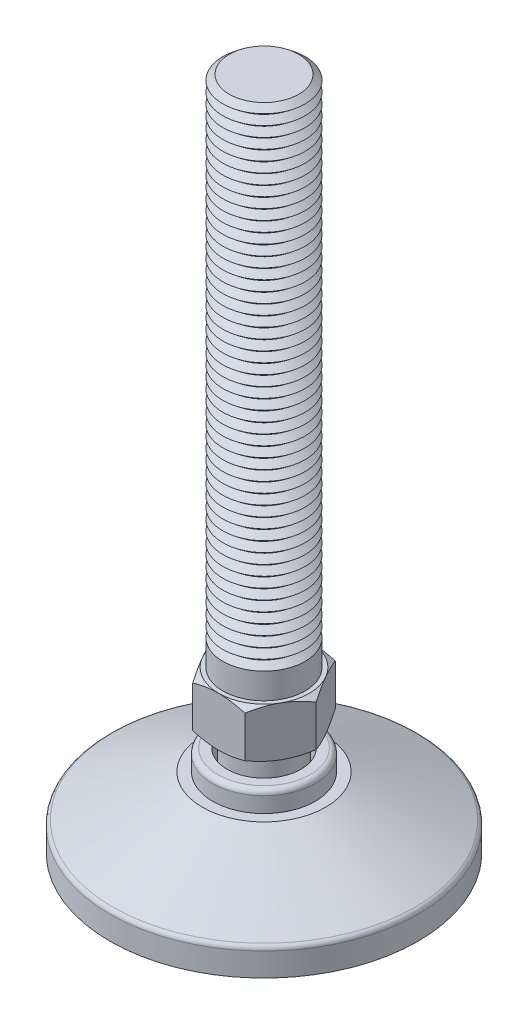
ISO-10303-21;
HEADER;
FILE_DESCRIPTION(('STEP AP214'),'2;1');
FILE_NAME('part.step','',(''),(''),'','','');
FILE_SCHEMA(('AUTOMOTIVE_DESIGN { 1 0 10303 214 1 1 1 1 }'));
ENDSEC;
DATA;
#1=APPLICATION_CONTEXT('core data for automotive mechanical design processes');
#2=APPLICATION_PROTOCOL_DEFINITION('international standard','automotive_design',2000,#1);
#3=PRODUCT_CONTEXT('',#1,'mechanical');
#4=PRODUCT('Part','Part','',(#3));
#5=PRODUCT_RELATED_PRODUCT_CATEGORY('part','',(#4));
#6=PRODUCT_DEFINITION_FORMATION('','',#4);
#7=PRODUCT_DEFINITION_CONTEXT('part definition',#1,'design');
#8=PRODUCT_DEFINITION('design','',#6,#7);
#9=PRODUCT_DEFINITION_SHAPE('','',#8);
#10=(LENGTH_UNIT() NAMED_UNIT(*) SI_UNIT(.MILLI.,.METRE.));
#11=(NAMED_UNIT(*) PLANE_ANGLE_UNIT() SI_UNIT($,.RADIAN.));
#12=(NAMED_UNIT(*) SI_UNIT($,.STERADIAN.) SOLID_ANGLE_UNIT());
#13=UNCERTAINTY_MEASURE_WITH_UNIT(LENGTH_MEASURE(1.E-05),#10,'distance_accuracy_value','');
#14=(GEOMETRIC_REPRESENTATION_CONTEXT(3) GLOBAL_UNCERTAINTY_ASSIGNED_CONTEXT((#13)) GLOBAL_UNIT_ASSIGNED_CONTEXT((#10,
#11,#12)) REPRESENTATION_CONTEXT('',''));
#15=CARTESIAN_POINT('',(0.,0.,0.));
#16=DIRECTION('',(0.,0.,1.));
#17=DIRECTION('',(1.,0.,0.));
#18=AXIS2_PLACEMENT_3D('',#15,#16,#17);
#19=CARTESIAN_POINT('',(0.,3.,0.));
#20=DIRECTION('',(0.,-1.,0.));
#21=DIRECTION('',(0.,0.,-1.));
#22=AXIS2_PLACEMENT_3D('',#19,#20,#21);
#23=CYLINDRICAL_SURFACE('',#22,34.5);
#24=CARTESIAN_POINT('',(0.,3.,0.));
#25=DIRECTION('',(0.,1.,0.));
#26=DIRECTION('',(0.,0.,1.));
#27=AXIS2_PLACEMENT_3D('',#24,#25,#26);
#28=CIRCLE('',#27,34.5);
#29=CARTESIAN_POINT('',(0.,3.,34.5));
#30=VERTEX_POINT('',#29);
#31=EDGE_CURVE('P0_E10',#30,#30,#28,.T.);
#32=ORIENTED_EDGE('',*,*,#31,.F.);
#33=EDGE_LOOP('',(#32));
#34=FACE_BOUND('',#33,.T.);
#35=CARTESIAN_POINT('',(0.,0.,0.));
#36=DIRECTION('',(0.,1.,0.));
#37=DIRECTION('',(0.,0.,1.));
#38=AXIS2_PLACEMENT_3D('',#35,#36,#37);
#39=CIRCLE('',#38,34.5);
#40=CARTESIAN_POINT('',(0.,0.,34.5));
#41=VERTEX_POINT('',#40);
#42=EDGE_CURVE('P0_E17',#41,#41,#39,.T.);
#43=ORIENTED_EDGE('',*,*,#42,.T.);
#44=EDGE_LOOP('',(#43));
#45=FACE_BOUND('',#44,.T.);
#46=ADVANCED_FACE('P0_F14',(#34,#45),#23,.T.);
#47=CARTESIAN_POINT('',(0.,3.,0.));
#48=DIRECTION('',(0.,1.,0.));
#49=DIRECTION('',(0.,0.,1.));
#50=AXIS2_PLACEMENT_3D('',#47,#48,#49);
#51=PLANE('',#50);
#52=CARTESIAN_POINT('',(0.,3.,0.));
#53=DIRECTION('',(0.,1.,0.));
#54=DIRECTION('',(0.,0.,1.));
#55=AXIS2_PLACEMENT_3D('',#52,#53,#54);
#56=CIRCLE('',#55,11.5);
#57=CARTESIAN_POINT('',(0.,3.,11.5));
#58=VERTEX_POINT('',#57);
#59=EDGE_CURVE('P0_E26',#58,#58,#56,.T.);
#60=ORIENTED_EDGE('',*,*,#59,.F.);
#61=EDGE_LOOP('',(#60));
#62=FACE_BOUND('',#61,.T.);
#63=ORIENTED_EDGE('',*,*,#31,.T.);
#64=EDGE_LOOP('',(#63));
#65=FACE_BOUND('',#64,.T.);
#66=ADVANCED_FACE('P0_F41',(#62,#65),#51,.T.);
#67=CARTESIAN_POINT('',(0.,0.,0.));
#68=DIRECTION('',(0.,1.,0.));
#69=DIRECTION('',(0.,0.,1.));
#70=AXIS2_PLACEMENT_3D('',#67,#68,#69);
#71=PLANE('',#70);
#72=ORIENTED_EDGE('',*,*,#42,.F.);
#73=EDGE_LOOP('',(#72));
#74=FACE_BOUND('',#73,.T.);
#75=ADVANCED_FACE('P0_F37',(#74),#71,.F.);
#76=CARTESIAN_POINT('',(0.,2.,0.));
#77=DIRECTION('',(0.,1.,0.));
#78=DIRECTION('',(0.,0.,1.));
#79=AXIS2_PLACEMENT_3D('',#76,#77,#78);
#80=CYLINDRICAL_SURFACE('',#79,11.5);
#81=CARTESIAN_POINT('',(0.,2.,0.));
#82=DIRECTION('',(0.,1.,0.));
#83=DIRECTION('',(0.,0.,1.));
#84=AXIS2_PLACEMENT_3D('',#81,#82,#83);
#85=CIRCLE('',#84,11.5);
#86=CARTESIAN_POINT('',(0.,2.,11.5));
#87=VERTEX_POINT('',#86);
#88=EDGE_CURVE('P0_E24',#87,#87,#85,.T.);
#89=ORIENTED_EDGE('',*,*,#88,.F.);
#90=EDGE_LOOP('',(#89));
#91=FACE_BOUND('',#90,.T.);
#92=ORIENTED_EDGE('',*,*,#59,.T.);
#93=EDGE_LOOP('',(#92));
#94=FACE_BOUND('',#93,.T.);
#95=ADVANCED_FACE('P0_F34',(#91,#94),#80,.F.);
#96=CARTESIAN_POINT('',(0.,2.,0.));
#97=DIRECTION('',(0.,1.,0.));
#98=DIRECTION('',(0.,0.,1.));
#99=AXIS2_PLACEMENT_3D('',#96,#97,#98);
#100=PLANE('',#99);
#101=ORIENTED_EDGE('',*,*,#88,.T.);
#102=EDGE_LOOP('',(#101));
#103=FACE_BOUND('',#102,.T.);
#104=ADVANCED_FACE('P0_F32',(#103),#100,.T.);
#105=CLOSED_SHELL('',(#46,#66,#75,#95,#104));
#106=MANIFOLD_SOLID_BREP('P0_B1',#105);
#107=CARTESIAN_POINT('',(0.,156.,0.));
#108=DIRECTION('',(0.,-1.,0.));
#109=DIRECTION('',(0.,0.,-1.));
#110=AXIS2_PLACEMENT_3D('',#107,#108,#109);
#111=CONICAL_SURFACE('',#110,8.4387505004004,0.895664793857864);
#112=CARTESIAN_POINT('',(0.,154.75,0.));
#113=DIRECTION('',(0.,-1.,0.));
#114=DIRECTION('',(0.,0.,-1.));
#115=AXIS2_PLACEMENT_3D('',#112,#113,#114);
#116=CIRCLE('',#115,10.);
#117=CARTESIAN_POINT('',(0.,154.75,-10.));
#118=VERTEX_POINT('',#117);
#119=EDGE_CURVE('P1_E1716',#118,#118,#116,.T.);
#120=ORIENTED_EDGE('',*,*,#119,.F.);
#121=EDGE_LOOP('',(#120));
#122=FACE_BOUND('',#121,.T.);
#123=CARTESIAN_POINT('',(0.,156.,0.));
#124=DIRECTION('',(0.,-1.,0.));
#125=DIRECTION('',(0.,0.,-1.));
#126=AXIS2_PLACEMENT_3D('',#123,#124,#125);
#127=CIRCLE('',#126,8.4387505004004);
#128=CARTESIAN_POINT('',(0.,156.,-8.4387505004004));
#129=VERTEX_POINT('',#128);
#130=EDGE_CURVE('P1_E1725',#129,#129,#127,.T.);
#131=ORIENTED_EDGE('',*,*,#130,.T.);
#132=EDGE_LOOP('',(#131));
#133=FACE_BOUND('',#132,.T.);
#134=ADVANCED_FACE('P1_F16',(#122,#133),#111,.T.);
#135=CARTESIAN_POINT('',(0.,157.25,0.));
#136=DIRECTION('',(0.,1.,0.));
#137=DIRECTION('',(0.,0.,1.));
#138=AXIS2_PLACEMENT_3D('',#135,#136,#137);
#139=CONICAL_SURFACE('',#138,10.,0.895664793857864);
#140=ORIENTED_EDGE('',*,*,#130,.F.);
#141=EDGE_LOOP('',(#140));
#142=FACE_BOUND('',#141,.T.);
#143=CARTESIAN_POINT('',(0.,157.25,0.));
#144=DIRECTION('',(0.,-1.,0.));
#145=DIRECTION('',(0.,0.,-1.));
#146=AXIS2_PLACEMENT_3D('',#143,#144,#145);
#147=CIRCLE('',#146,10.);
#148=CARTESIAN_POINT('',(0.,157.25,-10.));
#149=VERTEX_POINT('',#148);
#150=EDGE_CURVE('P1_E1722',#149,#149,#147,.T.);
#151=ORIENTED_EDGE('',*,*,#150,.T.);
#152=EDGE_LOOP('',(#151));
#153=FACE_BOUND('',#152,.T.);
#154=ADVANCED_FACE('P1_F308',(#142,#153),#139,.T.);
#155=CARTESIAN_POINT('',(0.,166.,0.));
#156=DIRECTION('',(0.,1.,0.));
#157=DIRECTION('',(0.,0.,1.));
#158=AXIS2_PLACEMENT_3D('',#155,#156,#157);
#159=PLANE('',#158);
#160=CARTESIAN_POINT('',(0.,166.,0.));
#161=DIRECTION('',(0.,-1.,0.));
#162=DIRECTION('',(0.,0.,-1.));
#163=AXIS2_PLACEMENT_3D('',#160,#161,#162);
#164=CIRCLE('',#163,8.4387505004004);
#165=CARTESIAN_POINT('',(0.,166.,-8.4387505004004));
#166=VERTEX_POINT('',#165);
#167=EDGE_CURVE('P1_E143',#166,#166,#164,.T.);
#168=ORIENTED_EDGE('',*,*,#167,.F.);
#169=EDGE_LOOP('',(#168));
#170=FACE_BOUND('',#169,.T.);
#171=ADVANCED_FACE('P1_F314',(#170),#159,.T.);
#172=CARTESIAN_POINT('',(0.,166.,0.));
#173=DIRECTION('',(0.,-1.,0.));
#174=DIRECTION('',(0.,0.,-1.));
#175=AXIS2_PLACEMENT_3D('',#172,#173,#174);
#176=CONICAL_SURFACE('',#175,8.4387505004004,0.895664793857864);
#177=CARTESIAN_POINT('',(0.,164.75,0.));
#178=DIRECTION('',(0.,-1.,0.));
#179=DIRECTION('',(0.,0.,-1.));
#180=AXIS2_PLACEMENT_3D('',#177,#178,#179);
#181=CIRCLE('',#180,10.);
#182=CARTESIAN_POINT('',(0.,164.75,-10.));
#183=VERTEX_POINT('',#182);
#184=EDGE_CURVE('P1_E353',#183,#183,#181,.T.);
#185=ORIENTED_EDGE('',*,*,#184,.F.);
#186=EDGE_LOOP('',(#185));
#187=FACE_BOUND('',#186,.T.);
#188=ORIENTED_EDGE('',*,*,#167,.T.);
#189=EDGE_LOOP('',(#188));
#190=FACE_BOUND('',#189,.T.);
#191=ADVANCED_FACE('P1_F211',(#187,#190),#176,.T.);
#192=CARTESIAN_POINT('',(0.,164.75,0.));
#193=DIRECTION('',(0.,1.,0.));
#194=DIRECTION('',(0.,0.,1.));
#195=AXIS2_PLACEMENT_3D('',#192,#193,#194);
#196=CONICAL_SURFACE('',#195,10.,0.895664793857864);
#197=CARTESIAN_POINT('',(0.,163.5,0.));
#198=DIRECTION('',(0.,-1.,0.));
#199=DIRECTION('',(0.,0.,-1.));
#200=AXIS2_PLACEMENT_3D('',#197,#198,#199);
#201=CIRCLE('',#200,8.4387505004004);
#202=CARTESIAN_POINT('',(0.,163.5,-8.4387505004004));
#203=VERTEX_POINT('',#202);
#204=EDGE_CURVE('P1_E352',#203,#203,#201,.T.);
#205=ORIENTED_EDGE('',*,*,#204,.F.);
#206=EDGE_LOOP('',(#205));
#207=FACE_BOUND('',#206,.T.);
#208=ORIENTED_EDGE('',*,*,#184,.T.);
#209=EDGE_LOOP('',(#208));
#210=FACE_BOUND('',#209,.T.);
#211=ADVANCED_FACE('P1_F339',(#207,#210),#196,.T.);
#212=CARTESIAN_POINT('',(0.,163.5,0.));
#213=DIRECTION('',(0.,-1.,0.));
#214=DIRECTION('',(0.,0.,-1.));
#215=AXIS2_PLACEMENT_3D('',#212,#213,#214);
#216=CONICAL_SURFACE('',#215,8.4387505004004,0.895664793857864);
#217=CARTESIAN_POINT('',(0.,162.25,0.));
#218=DIRECTION('',(0.,-1.,0.));
#219=DIRECTION('',(0.,0.,-1.));
#220=AXIS2_PLACEMENT_3D('',#217,#218,#219);
#221=CIRCLE('',#220,10.);
#222=CARTESIAN_POINT('',(0.,162.25,-10.));
#223=VERTEX_POINT('',#222);
#224=EDGE_CURVE('P1_E349',#223,#223,#221,.T.);
#225=ORIENTED_EDGE('',*,*,#224,.F.);
#226=EDGE_LOOP('',(#225));
#227=FACE_BOUND('',#226,.T.);
#228=ORIENTED_EDGE('',*,*,#204,.T.);
#229=EDGE_LOOP('',(#228));
#230=FACE_BOUND('',#229,.T.);
#231=ADVANCED_FACE('P1_F334',(#227,#230),#216,.T.);
#232=CARTESIAN_POINT('',(0.,162.25,0.));
#233=DIRECTION('',(0.,1.,0.));
#234=DIRECTION('',(0.,0.,1.));
#235=AXIS2_PLACEMENT_3D('',#232,#233,#234);
#236=CONICAL_SURFACE('',#235,10.,0.895664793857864);
#237=CARTESIAN_POINT('',(0.,161.,0.));
#238=DIRECTION('',(0.,-1.,0.));
#239=DIRECTION('',(0.,0.,-1.));
#240=AXIS2_PLACEMENT_3D('',#237,#238,#239);
#241=CIRCLE('',#240,8.4387505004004);
#242=CARTESIAN_POINT('',(0.,161.,-8.4387505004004));
#243=VERTEX_POINT('',#242);
#244=EDGE_CURVE('P1_E358',#243,#243,#241,.T.);
#245=ORIENTED_EDGE('',*,*,#244,.F.);
#246=EDGE_LOOP('',(#245));
#247=FACE_BOUND('',#246,.T.);
#248=ORIENTED_EDGE('',*,*,#224,.T.);
#249=EDGE_LOOP('',(#248));
#250=FACE_BOUND('',#249,.T.);
#251=ADVANCED_FACE('P1_F331',(#247,#250),#236,.T.);
#252=CARTESIAN_POINT('',(0.,161.,0.));
#253=DIRECTION('',(0.,-1.,0.));
#254=DIRECTION('',(0.,0.,-1.));
#255=AXIS2_PLACEMENT_3D('',#252,#253,#254);
#256=CONICAL_SURFACE('',#255,8.4387505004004,0.895664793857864);
#257=CARTESIAN_POINT('',(0.,159.75,0.));
#258=DIRECTION('',(0.,-1.,0.));
#259=DIRECTION('',(0.,0.,-1.));
#260=AXIS2_PLACEMENT_3D('',#257,#258,#259);
#261=CIRCLE('',#260,10.);
#262=CARTESIAN_POINT('',(0.,159.75,-10.));
#263=VERTEX_POINT('',#262);
#264=EDGE_CURVE('P1_E1728',#263,#263,#261,.T.);
#265=ORIENTED_EDGE('',*,*,#264,.F.);
#266=EDGE_LOOP('',(#265));
#267=FACE_BOUND('',#266,.T.);
#268=ORIENTED_EDGE('',*,*,#244,.T.);
#269=EDGE_LOOP('',(#268));
#270=FACE_BOUND('',#269,.T.);
#271=ADVANCED_FACE('P1_F325',(#267,#270),#256,.T.);
#272=CARTESIAN_POINT('',(0.,159.75,0.));
#273=DIRECTION('',(0.,1.,0.));
#274=DIRECTION('',(0.,0.,1.));
#275=AXIS2_PLACEMENT_3D('',#272,#273,#274);
#276=CONICAL_SURFACE('',#275,10.,0.895664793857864);
#277=CARTESIAN_POINT('',(0.,158.5,0.));
#278=DIRECTION('',(0.,-1.,0.));
#279=DIRECTION('',(0.,0.,-1.));
#280=AXIS2_PLACEMENT_3D('',#277,#278,#279);
#281=CIRCLE('',#280,8.4387505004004);
#282=CARTESIAN_POINT('',(0.,158.5,-8.4387505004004));
#283=VERTEX_POINT('',#282);
#284=EDGE_CURVE('P1_E1731',#283,#283,#281,.T.);
#285=ORIENTED_EDGE('',*,*,#284,.F.);
#286=EDGE_LOOP('',(#285));
#287=FACE_BOUND('',#286,.T.);
#288=ORIENTED_EDGE('',*,*,#264,.T.);
#289=EDGE_LOOP('',(#288));
#290=FACE_BOUND('',#289,.T.);
#291=ADVANCED_FACE('P1_F321',(#287,#290),#276,.T.);
#292=CARTESIAN_POINT('',(0.,158.5,0.));
#293=DIRECTION('',(0.,-1.,0.));
#294=DIRECTION('',(0.,0.,-1.));
#295=AXIS2_PLACEMENT_3D('',#292,#293,#294);
#296=CONICAL_SURFACE('',#295,8.4387505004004,0.895664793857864);
#297=ORIENTED_EDGE('',*,*,#150,.F.);
#298=EDGE_LOOP('',(#297));
#299=FACE_BOUND('',#298,.T.);
#300=ORIENTED_EDGE('',*,*,#284,.T.);
#301=EDGE_LOOP('',(#300));
#302=FACE_BOUND('',#301,.T.);
#303=ADVANCED_FACE('P1_F324',(#299,#302),#296,.T.);
#304=CARTESIAN_POINT('',(0.,153.5,0.));
#305=DIRECTION('',(0.,-1.,0.));
#306=DIRECTION('',(0.,0.,-1.));
#307=AXIS2_PLACEMENT_3D('',#304,#305,#306);
#308=CONICAL_SURFACE('',#307,8.4387505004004,0.895664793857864);
#309=CARTESIAN_POINT('',(0.,152.25,0.));
#310=DIRECTION('',(0.,-1.,0.));
#311=DIRECTION('',(0.,0.,-1.));
#312=AXIS2_PLACEMENT_3D('',#309,#310,#311);
#313=CIRCLE('',#312,10.);
#314=CARTESIAN_POINT('',(0.,152.25,-10.));
#315=VERTEX_POINT('',#314);
#316=EDGE_CURVE('P1_E1710',#315,#315,#313,.T.);
#317=ORIENTED_EDGE('',*,*,#316,.F.);
#318=EDGE_LOOP('',(#317));
#319=FACE_BOUND('',#318,.T.);
#320=CARTESIAN_POINT('',(0.,153.5,0.));
#321=DIRECTION('',(0.,-1.,0.));
#322=DIRECTION('',(0.,0.,-1.));
#323=AXIS2_PLACEMENT_3D('',#320,#321,#322);
#324=CIRCLE('',#323,8.4387505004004);
#325=CARTESIAN_POINT('',(0.,153.5,-8.4387505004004));
#326=VERTEX_POINT('',#325);
#327=EDGE_CURVE('P1_E1719',#326,#326,#324,.T.);
#328=ORIENTED_EDGE('',*,*,#327,.T.);
#329=EDGE_LOOP('',(#328));
#330=FACE_BOUND('',#329,.T.);
#331=ADVANCED_FACE('P1_F329',(#319,#330),#308,.T.);
#332=CARTESIAN_POINT('',(0.,154.75,0.));
#333=DIRECTION('',(0.,1.,0.));
#334=DIRECTION('',(0.,0.,1.));
#335=AXIS2_PLACEMENT_3D('',#332,#333,#334);
#336=CONICAL_SURFACE('',#335,10.,0.895664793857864);
#337=ORIENTED_EDGE('',*,*,#327,.F.);
#338=EDGE_LOOP('',(#337));
#339=FACE_BOUND('',#338,.T.);
#340=ORIENTED_EDGE('',*,*,#119,.T.);
#341=EDGE_LOOP('',(#340));
#342=FACE_BOUND('',#341,.T.);
#343=ADVANCED_FACE('P1_F1364',(#339,#342),#336,.T.);
#344=CARTESIAN_POINT('',(0.,151.,0.));
#345=DIRECTION('',(0.,-1.,0.));
#346=DIRECTION('',(0.,0.,-1.));
#347=AXIS2_PLACEMENT_3D('',#344,#345,#346);
#348=CONICAL_SURFACE('',#347,8.4387505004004,0.895664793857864);
#349=CARTESIAN_POINT('',(0.,149.75,0.));
#350=DIRECTION('',(0.,-1.,0.));
#351=DIRECTION('',(0.,0.,-1.));
#352=AXIS2_PLACEMENT_3D('',#349,#350,#351);
#353=CIRCLE('',#352,10.);
#354=CARTESIAN_POINT('',(0.,149.75,-10.));
#355=VERTEX_POINT('',#354);
#356=EDGE_CURVE('P1_E1704',#355,#355,#353,.T.);
#357=ORIENTED_EDGE('',*,*,#356,.F.);
#358=EDGE_LOOP('',(#357));
#359=FACE_BOUND('',#358,.T.);
#360=CARTESIAN_POINT('',(0.,151.,0.));
#361=DIRECTION('',(0.,-1.,0.));
#362=DIRECTION('',(0.,0.,-1.));
#363=AXIS2_PLACEMENT_3D('',#360,#361,#362);
#364=CIRCLE('',#363,8.4387505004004);
#365=CARTESIAN_POINT('',(0.,151.,-8.4387505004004));
#366=VERTEX_POINT('',#365);
#367=EDGE_CURVE('P1_E1713',#366,#366,#364,.T.);
#368=ORIENTED_EDGE('',*,*,#367,.T.);
#369=EDGE_LOOP('',(#368));
#370=FACE_BOUND('',#369,.T.);
#371=ADVANCED_FACE('P1_F1354',(#359,#370),#348,.T.);
#372=CARTESIAN_POINT('',(0.,152.25,0.));
#373=DIRECTION('',(0.,1.,0.));
#374=DIRECTION('',(0.,0.,1.));
#375=AXIS2_PLACEMENT_3D('',#372,#373,#374);
#376=CONICAL_SURFACE('',#375,10.,0.895664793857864);
#377=ORIENTED_EDGE('',*,*,#367,.F.);
#378=EDGE_LOOP('',(#377));
#379=FACE_BOUND('',#378,.T.);
#380=ORIENTED_EDGE('',*,*,#316,.T.);
#381=EDGE_LOOP('',(#380));
#382=FACE_BOUND('',#381,.T.);
#383=ADVANCED_FACE('P1_F1344',(#379,#382),#376,.T.);
#384=CARTESIAN_POINT('',(0.,148.5,0.));
#385=DIRECTION('',(0.,-1.,0.));
#386=DIRECTION('',(0.,0.,-1.));
#387=AXIS2_PLACEMENT_3D('',#384,#385,#386);
#388=CONICAL_SURFACE('',#387,8.4387505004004,0.895664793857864);
#389=CARTESIAN_POINT('',(0.,147.25,0.));
#390=DIRECTION('',(0.,-1.,0.));
#391=DIRECTION('',(0.,0.,-1.));
#392=AXIS2_PLACEMENT_3D('',#389,#390,#391);
#393=CIRCLE('',#392,10.);
#394=CARTESIAN_POINT('',(0.,147.25,-10.));
#395=VERTEX_POINT('',#394);
#396=EDGE_CURVE('P1_E1698',#395,#395,#393,.T.);
#397=ORIENTED_EDGE('',*,*,#396,.F.);
#398=EDGE_LOOP('',(#397));
#399=FACE_BOUND('',#398,.T.);
#400=CARTESIAN_POINT('',(0.,148.5,0.));
#401=DIRECTION('',(0.,-1.,0.));
#402=DIRECTION('',(0.,0.,-1.));
#403=AXIS2_PLACEMENT_3D('',#400,#401,#402);
#404=CIRCLE('',#403,8.4387505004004);
#405=CARTESIAN_POINT('',(0.,148.5,-8.4387505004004));
#406=VERTEX_POINT('',#405);
#407=EDGE_CURVE('P1_E1707',#406,#406,#404,.T.);
#408=ORIENTED_EDGE('',*,*,#407,.T.);
#409=EDGE_LOOP('',(#408));
#410=FACE_BOUND('',#409,.T.);
#411=ADVANCED_FACE('P1_F1334',(#399,#410),#388,.T.);
#412=CARTESIAN_POINT('',(0.,149.75,0.));
#413=DIRECTION('',(0.,1.,0.));
#414=DIRECTION('',(0.,0.,1.));
#415=AXIS2_PLACEMENT_3D('',#412,#413,#414);
#416=CONICAL_SURFACE('',#415,10.,0.895664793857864);
#417=ORIENTED_EDGE('',*,*,#407,.F.);
#418=EDGE_LOOP('',(#417));
#419=FACE_BOUND('',#418,.T.);
#420=ORIENTED_EDGE('',*,*,#356,.T.);
#421=EDGE_LOOP('',(#420));
#422=FACE_BOUND('',#421,.T.);
#423=ADVANCED_FACE('P1_F1324',(#419,#422),#416,.T.);
#424=CARTESIAN_POINT('',(0.,146.,0.));
#425=DIRECTION('',(0.,-1.,0.));
#426=DIRECTION('',(0.,0.,-1.));
#427=AXIS2_PLACEMENT_3D('',#424,#425,#426);
#428=CONICAL_SURFACE('',#427,8.4387505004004,0.895664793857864);
#429=CARTESIAN_POINT('',(0.,144.75,0.));
#430=DIRECTION('',(0.,-1.,0.));
#431=DIRECTION('',(0.,0.,-1.));
#432=AXIS2_PLACEMENT_3D('',#429,#430,#431);
#433=CIRCLE('',#432,10.);
#434=CARTESIAN_POINT('',(0.,144.75,-10.));
#435=VERTEX_POINT('',#434);
#436=EDGE_CURVE('P1_E1692',#435,#435,#433,.T.);
#437=ORIENTED_EDGE('',*,*,#436,.F.);
#438=EDGE_LOOP('',(#437));
#439=FACE_BOUND('',#438,.T.);
#440=CARTESIAN_POINT('',(0.,146.,0.));
#441=DIRECTION('',(0.,-1.,0.));
#442=DIRECTION('',(0.,0.,-1.));
#443=AXIS2_PLACEMENT_3D('',#440,#441,#442);
#444=CIRCLE('',#443,8.4387505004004);
#445=CARTESIAN_POINT('',(0.,146.,-8.4387505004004));
#446=VERTEX_POINT('',#445);
#447=EDGE_CURVE('P1_E1701',#446,#446,#444,.T.);
#448=ORIENTED_EDGE('',*,*,#447,.T.);
#449=EDGE_LOOP('',(#448));
#450=FACE_BOUND('',#449,.T.);
#451=ADVANCED_FACE('P1_F1314',(#439,#450),#428,.T.);
#452=CARTESIAN_POINT('',(0.,147.25,0.));
#453=DIRECTION('',(0.,1.,0.));
#454=DIRECTION('',(0.,0.,1.));
#455=AXIS2_PLACEMENT_3D('',#452,#453,#454);
#456=CONICAL_SURFACE('',#455,10.,0.895664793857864);
#457=ORIENTED_EDGE('',*,*,#447,.F.);
#458=EDGE_LOOP('',(#457));
#459=FACE_BOUND('',#458,.T.);
#460=ORIENTED_EDGE('',*,*,#396,.T.);
#461=EDGE_LOOP('',(#460));
#462=FACE_BOUND('',#461,.T.);
#463=ADVANCED_FACE('P1_F1304',(#459,#462),#456,.T.);
#464=CARTESIAN_POINT('',(0.,143.5,0.));
#465=DIRECTION('',(0.,-1.,0.));
#466=DIRECTION('',(0.,0.,-1.));
#467=AXIS2_PLACEMENT_3D('',#464,#465,#466);
#468=CONICAL_SURFACE('',#467,8.4387505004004,0.895664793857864);
#469=CARTESIAN_POINT('',(0.,142.25,0.));
#470=DIRECTION('',(0.,-1.,0.));
#471=DIRECTION('',(0.,0.,-1.));
#472=AXIS2_PLACEMENT_3D('',#469,#470,#471);
#473=CIRCLE('',#472,10.);
#474=CARTESIAN_POINT('',(0.,142.25,-10.));
#475=VERTEX_POINT('',#474);
#476=EDGE_CURVE('P1_E1686',#475,#475,#473,.T.);
#477=ORIENTED_EDGE('',*,*,#476,.F.);
#478=EDGE_LOOP('',(#477));
#479=FACE_BOUND('',#478,.T.);
#480=CARTESIAN_POINT('',(0.,143.5,0.));
#481=DIRECTION('',(0.,-1.,0.));
#482=DIRECTION('',(0.,0.,-1.));
#483=AXIS2_PLACEMENT_3D('',#480,#481,#482);
#484=CIRCLE('',#483,8.4387505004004);
#485=CARTESIAN_POINT('',(0.,143.5,-8.4387505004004));
#486=VERTEX_POINT('',#485);
#487=EDGE_CURVE('P1_E1695',#486,#486,#484,.T.);
#488=ORIENTED_EDGE('',*,*,#487,.T.);
#489=EDGE_LOOP('',(#488));
#490=FACE_BOUND('',#489,.T.);
#491=ADVANCED_FACE('P1_F1294',(#479,#490),#468,.T.);
#492=CARTESIAN_POINT('',(0.,144.75,0.));
#493=DIRECTION('',(0.,1.,0.));
#494=DIRECTION('',(0.,0.,1.));
#495=AXIS2_PLACEMENT_3D('',#492,#493,#494);
#496=CONICAL_SURFACE('',#495,10.,0.895664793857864);
#497=ORIENTED_EDGE('',*,*,#487,.F.);
#498=EDGE_LOOP('',(#497));
#499=FACE_BOUND('',#498,.T.);
#500=ORIENTED_EDGE('',*,*,#436,.T.);
#501=EDGE_LOOP('',(#500));
#502=FACE_BOUND('',#501,.T.);
#503=ADVANCED_FACE('P1_F1284',(#499,#502),#496,.T.);
#504=CARTESIAN_POINT('',(0.,141.,0.));
#505=DIRECTION('',(0.,-1.,0.));
#506=DIRECTION('',(0.,0.,-1.));
#507=AXIS2_PLACEMENT_3D('',#504,#505,#506);
#508=CONICAL_SURFACE('',#507,8.4387505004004,0.895664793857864);
#509=CARTESIAN_POINT('',(0.,139.75,0.));
#510=DIRECTION('',(0.,-1.,0.));
#511=DIRECTION('',(0.,0.,-1.));
#512=AXIS2_PLACEMENT_3D('',#509,#510,#511);
#513=CIRCLE('',#512,10.);
#514=CARTESIAN_POINT('',(0.,139.75,-10.));
#515=VERTEX_POINT('',#514);
#516=EDGE_CURVE('P1_E1680',#515,#515,#513,.T.);
#517=ORIENTED_EDGE('',*,*,#516,.F.);
#518=EDGE_LOOP('',(#517));
#519=FACE_BOUND('',#518,.T.);
#520=CARTESIAN_POINT('',(0.,141.,0.));
#521=DIRECTION('',(0.,-1.,0.));
#522=DIRECTION('',(0.,0.,-1.));
#523=AXIS2_PLACEMENT_3D('',#520,#521,#522);
#524=CIRCLE('',#523,8.4387505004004);
#525=CARTESIAN_POINT('',(0.,141.,-8.4387505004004));
#526=VERTEX_POINT('',#525);
#527=EDGE_CURVE('P1_E1689',#526,#526,#524,.T.);
#528=ORIENTED_EDGE('',*,*,#527,.T.);
#529=EDGE_LOOP('',(#528));
#530=FACE_BOUND('',#529,.T.);
#531=ADVANCED_FACE('P1_F1274',(#519,#530),#508,.T.);
#532=CARTESIAN_POINT('',(0.,142.25,0.));
#533=DIRECTION('',(0.,1.,0.));
#534=DIRECTION('',(0.,0.,1.));
#535=AXIS2_PLACEMENT_3D('',#532,#533,#534);
#536=CONICAL_SURFACE('',#535,10.,0.895664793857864);
#537=ORIENTED_EDGE('',*,*,#527,.F.);
#538=EDGE_LOOP('',(#537));
#539=FACE_BOUND('',#538,.T.);
#540=ORIENTED_EDGE('',*,*,#476,.T.);
#541=EDGE_LOOP('',(#540));
#542=FACE_BOUND('',#541,.T.);
#543=ADVANCED_FACE('P1_F1264',(#539,#542),#536,.T.);
#544=CARTESIAN_POINT('',(0.,138.5,0.));
#545=DIRECTION('',(0.,-1.,0.));
#546=DIRECTION('',(0.,0.,-1.));
#547=AXIS2_PLACEMENT_3D('',#544,#545,#546);
#548=CONICAL_SURFACE('',#547,8.4387505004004,0.895664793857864);
#549=CARTESIAN_POINT('',(0.,137.25,0.));
#550=DIRECTION('',(0.,-1.,0.));
#551=DIRECTION('',(0.,0.,-1.));
#552=AXIS2_PLACEMENT_3D('',#549,#550,#551);
#553=CIRCLE('',#552,10.);
#554=CARTESIAN_POINT('',(0.,137.25,-10.));
#555=VERTEX_POINT('',#554);
#556=EDGE_CURVE('P1_E1674',#555,#555,#553,.T.);
#557=ORIENTED_EDGE('',*,*,#556,.F.);
#558=EDGE_LOOP('',(#557));
#559=FACE_BOUND('',#558,.T.);
#560=CARTESIAN_POINT('',(0.,138.5,0.));
#561=DIRECTION('',(0.,-1.,0.));
#562=DIRECTION('',(0.,0.,-1.));
#563=AXIS2_PLACEMENT_3D('',#560,#561,#562);
#564=CIRCLE('',#563,8.4387505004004);
#565=CARTESIAN_POINT('',(0.,138.5,-8.4387505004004));
#566=VERTEX_POINT('',#565);
#567=EDGE_CURVE('P1_E1683',#566,#566,#564,.T.);
#568=ORIENTED_EDGE('',*,*,#567,.T.);
#569=EDGE_LOOP('',(#568));
#570=FACE_BOUND('',#569,.T.);
#571=ADVANCED_FACE('P1_F1254',(#559,#570),#548,.T.);
#572=CARTESIAN_POINT('',(0.,139.75,0.));
#573=DIRECTION('',(0.,1.,0.));
#574=DIRECTION('',(0.,0.,1.));
#575=AXIS2_PLACEMENT_3D('',#572,#573,#574);
#576=CONICAL_SURFACE('',#575,10.,0.895664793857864);
#577=ORIENTED_EDGE('',*,*,#567,.F.);
#578=EDGE_LOOP('',(#577));
#579=FACE_BOUND('',#578,.T.);
#580=ORIENTED_EDGE('',*,*,#516,.T.);
#581=EDGE_LOOP('',(#580));
#582=FACE_BOUND('',#581,.T.);
#583=ADVANCED_FACE('P1_F1244',(#579,#582),#576,.T.);
#584=CARTESIAN_POINT('',(0.,136.,0.));
#585=DIRECTION('',(0.,-1.,0.));
#586=DIRECTION('',(0.,0.,-1.));
#587=AXIS2_PLACEMENT_3D('',#584,#585,#586);
#588=CONICAL_SURFACE('',#587,8.4387505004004,0.895664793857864);
#589=CARTESIAN_POINT('',(0.,134.75,0.));
#590=DIRECTION('',(0.,-1.,0.));
#591=DIRECTION('',(0.,0.,-1.));
#592=AXIS2_PLACEMENT_3D('',#589,#590,#591);
#593=CIRCLE('',#592,10.);
#594=CARTESIAN_POINT('',(0.,134.75,-10.));
#595=VERTEX_POINT('',#594);
#596=EDGE_CURVE('P1_E1668',#595,#595,#593,.T.);
#597=ORIENTED_EDGE('',*,*,#596,.F.);
#598=EDGE_LOOP('',(#597));
#599=FACE_BOUND('',#598,.T.);
#600=CARTESIAN_POINT('',(0.,136.,0.));
#601=DIRECTION('',(0.,-1.,0.));
#602=DIRECTION('',(0.,0.,-1.));
#603=AXIS2_PLACEMENT_3D('',#600,#601,#602);
#604=CIRCLE('',#603,8.4387505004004);
#605=CARTESIAN_POINT('',(0.,136.,-8.4387505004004));
#606=VERTEX_POINT('',#605);
#607=EDGE_CURVE('P1_E1677',#606,#606,#604,.T.);
#608=ORIENTED_EDGE('',*,*,#607,.T.);
#609=EDGE_LOOP('',(#608));
#610=FACE_BOUND('',#609,.T.);
#611=ADVANCED_FACE('P1_F1234',(#599,#610),#588,.T.);
#612=CARTESIAN_POINT('',(0.,137.25,0.));
#613=DIRECTION('',(0.,1.,0.));
#614=DIRECTION('',(0.,0.,1.));
#615=AXIS2_PLACEMENT_3D('',#612,#613,#614);
#616=CONICAL_SURFACE('',#615,10.,0.895664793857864);
#617=ORIENTED_EDGE('',*,*,#607,.F.);
#618=EDGE_LOOP('',(#617));
#619=FACE_BOUND('',#618,.T.);
#620=ORIENTED_EDGE('',*,*,#556,.T.);
#621=EDGE_LOOP('',(#620));
#622=FACE_BOUND('',#621,.T.);
#623=ADVANCED_FACE('P1_F1224',(#619,#622),#616,.T.);
#624=CARTESIAN_POINT('',(0.,133.5,0.));
#625=DIRECTION('',(0.,-1.,0.));
#626=DIRECTION('',(0.,0.,-1.));
#627=AXIS2_PLACEMENT_3D('',#624,#625,#626);
#628=CONICAL_SURFACE('',#627,8.4387505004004,0.895664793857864);
#629=CARTESIAN_POINT('',(0.,132.25,0.));
#630=DIRECTION('',(0.,-1.,0.));
#631=DIRECTION('',(0.,0.,-1.));
#632=AXIS2_PLACEMENT_3D('',#629,#630,#631);
#633=CIRCLE('',#632,10.);
#634=CARTESIAN_POINT('',(0.,132.25,-10.));
#635=VERTEX_POINT('',#634);
#636=EDGE_CURVE('P1_E1662',#635,#635,#633,.T.);
#637=ORIENTED_EDGE('',*,*,#636,.F.);
#638=EDGE_LOOP('',(#637));
#639=FACE_BOUND('',#638,.T.);
#640=CARTESIAN_POINT('',(0.,133.5,0.));
#641=DIRECTION('',(0.,-1.,0.));
#642=DIRECTION('',(0.,0.,-1.));
#643=AXIS2_PLACEMENT_3D('',#640,#641,#642);
#644=CIRCLE('',#643,8.4387505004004);
#645=CARTESIAN_POINT('',(0.,133.5,-8.4387505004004));
#646=VERTEX_POINT('',#645);
#647=EDGE_CURVE('P1_E1671',#646,#646,#644,.T.);
#648=ORIENTED_EDGE('',*,*,#647,.T.);
#649=EDGE_LOOP('',(#648));
#650=FACE_BOUND('',#649,.T.);
#651=ADVANCED_FACE('P1_F1214',(#639,#650),#628,.T.);
#652=CARTESIAN_POINT('',(0.,134.75,0.));
#653=DIRECTION('',(0.,1.,0.));
#654=DIRECTION('',(0.,0.,1.));
#655=AXIS2_PLACEMENT_3D('',#652,#653,#654);
#656=CONICAL_SURFACE('',#655,10.,0.895664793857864);
#657=ORIENTED_EDGE('',*,*,#647,.F.);
#658=EDGE_LOOP('',(#657));
#659=FACE_BOUND('',#658,.T.);
#660=ORIENTED_EDGE('',*,*,#596,.T.);
#661=EDGE_LOOP('',(#660));
#662=FACE_BOUND('',#661,.T.);
#663=ADVANCED_FACE('P1_F1204',(#659,#662),#656,.T.);
#664=CARTESIAN_POINT('',(0.,131.,0.));
#665=DIRECTION('',(0.,-1.,0.));
#666=DIRECTION('',(0.,0.,-1.));
#667=AXIS2_PLACEMENT_3D('',#664,#665,#666);
#668=CONICAL_SURFACE('',#667,8.4387505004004,0.895664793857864);
#669=CARTESIAN_POINT('',(0.,129.75,0.));
#670=DIRECTION('',(0.,-1.,0.));
#671=DIRECTION('',(0.,0.,-1.));
#672=AXIS2_PLACEMENT_3D('',#669,#670,#671);
#673=CIRCLE('',#672,10.);
#674=CARTESIAN_POINT('',(0.,129.75,-10.));
#675=VERTEX_POINT('',#674);
#676=EDGE_CURVE('P1_E1656',#675,#675,#673,.T.);
#677=ORIENTED_EDGE('',*,*,#676,.F.);
#678=EDGE_LOOP('',(#677));
#679=FACE_BOUND('',#678,.T.);
#680=CARTESIAN_POINT('',(0.,131.,0.));
#681=DIRECTION('',(0.,-1.,0.));
#682=DIRECTION('',(0.,0.,-1.));
#683=AXIS2_PLACEMENT_3D('',#680,#681,#682);
#684=CIRCLE('',#683,8.4387505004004);
#685=CARTESIAN_POINT('',(0.,131.,-8.4387505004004));
#686=VERTEX_POINT('',#685);
#687=EDGE_CURVE('P1_E1665',#686,#686,#684,.T.);
#688=ORIENTED_EDGE('',*,*,#687,.T.);
#689=EDGE_LOOP('',(#688));
#690=FACE_BOUND('',#689,.T.);
#691=ADVANCED_FACE('P1_F1194',(#679,#690),#668,.T.);
#692=CARTESIAN_POINT('',(0.,132.25,0.));
#693=DIRECTION('',(0.,1.,0.));
#694=DIRECTION('',(0.,0.,1.));
#695=AXIS2_PLACEMENT_3D('',#692,#693,#694);
#696=CONICAL_SURFACE('',#695,10.,0.895664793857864);
#697=ORIENTED_EDGE('',*,*,#687,.F.);
#698=EDGE_LOOP('',(#697));
#699=FACE_BOUND('',#698,.T.);
#700=ORIENTED_EDGE('',*,*,#636,.T.);
#701=EDGE_LOOP('',(#700));
#702=FACE_BOUND('',#701,.T.);
#703=ADVANCED_FACE('P1_F1184',(#699,#702),#696,.T.);
#704=CARTESIAN_POINT('',(0.,128.5,0.));
#705=DIRECTION('',(0.,-1.,0.));
#706=DIRECTION('',(0.,0.,-1.));
#707=AXIS2_PLACEMENT_3D('',#704,#705,#706);
#708=CONICAL_SURFACE('',#707,8.4387505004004,0.895664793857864);
#709=CARTESIAN_POINT('',(0.,127.25,0.));
#710=DIRECTION('',(0.,-1.,0.));
#711=DIRECTION('',(0.,0.,-1.));
#712=AXIS2_PLACEMENT_3D('',#709,#710,#711);
#713=CIRCLE('',#712,10.);
#714=CARTESIAN_POINT('',(0.,127.25,-10.));
#715=VERTEX_POINT('',#714);
#716=EDGE_CURVE('P1_E1650',#715,#715,#713,.T.);
#717=ORIENTED_EDGE('',*,*,#716,.F.);
#718=EDGE_LOOP('',(#717));
#719=FACE_BOUND('',#718,.T.);
#720=CARTESIAN_POINT('',(0.,128.5,0.));
#721=DIRECTION('',(0.,-1.,0.));
#722=DIRECTION('',(0.,0.,-1.));
#723=AXIS2_PLACEMENT_3D('',#720,#721,#722);
#724=CIRCLE('',#723,8.4387505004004);
#725=CARTESIAN_POINT('',(0.,128.5,-8.4387505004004));
#726=VERTEX_POINT('',#725);
#727=EDGE_CURVE('P1_E1659',#726,#726,#724,.T.);
#728=ORIENTED_EDGE('',*,*,#727,.T.);
#729=EDGE_LOOP('',(#728));
#730=FACE_BOUND('',#729,.T.);
#731=ADVANCED_FACE('P1_F1174',(#719,#730),#708,.T.);
#732=CARTESIAN_POINT('',(0.,129.75,0.));
#733=DIRECTION('',(0.,1.,0.));
#734=DIRECTION('',(0.,0.,1.));
#735=AXIS2_PLACEMENT_3D('',#732,#733,#734);
#736=CONICAL_SURFACE('',#735,10.,0.895664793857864);
#737=ORIENTED_EDGE('',*,*,#727,.F.);
#738=EDGE_LOOP('',(#737));
#739=FACE_BOUND('',#738,.T.);
#740=ORIENTED_EDGE('',*,*,#676,.T.);
#741=EDGE_LOOP('',(#740));
#742=FACE_BOUND('',#741,.T.);
#743=ADVANCED_FACE('P1_F1164',(#739,#742),#736,.T.);
#744=CARTESIAN_POINT('',(0.,126.,0.));
#745=DIRECTION('',(0.,-1.,0.));
#746=DIRECTION('',(0.,0.,-1.));
#747=AXIS2_PLACEMENT_3D('',#744,#745,#746);
#748=CONICAL_SURFACE('',#747,8.4387505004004,0.895664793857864);
#749=CARTESIAN_POINT('',(0.,124.75,0.));
#750=DIRECTION('',(0.,-1.,0.));
#751=DIRECTION('',(0.,0.,-1.));
#752=AXIS2_PLACEMENT_3D('',#749,#750,#751);
#753=CIRCLE('',#752,10.);
#754=CARTESIAN_POINT('',(0.,124.75,-10.));
#755=VERTEX_POINT('',#754);
#756=EDGE_CURVE('P1_E1644',#755,#755,#753,.T.);
#757=ORIENTED_EDGE('',*,*,#756,.F.);
#758=EDGE_LOOP('',(#757));
#759=FACE_BOUND('',#758,.T.);
#760=CARTESIAN_POINT('',(0.,126.,0.));
#761=DIRECTION('',(0.,-1.,0.));
#762=DIRECTION('',(0.,0.,-1.));
#763=AXIS2_PLACEMENT_3D('',#760,#761,#762);
#764=CIRCLE('',#763,8.4387505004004);
#765=CARTESIAN_POINT('',(0.,126.,-8.4387505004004));
#766=VERTEX_POINT('',#765);
#767=EDGE_CURVE('P1_E1653',#766,#766,#764,.T.);
#768=ORIENTED_EDGE('',*,*,#767,.T.);
#769=EDGE_LOOP('',(#768));
#770=FACE_BOUND('',#769,.T.);
#771=ADVANCED_FACE('P1_F1154',(#759,#770),#748,.T.);
#772=CARTESIAN_POINT('',(0.,127.25,0.));
#773=DIRECTION('',(0.,1.,0.));
#774=DIRECTION('',(0.,0.,1.));
#775=AXIS2_PLACEMENT_3D('',#772,#773,#774);
#776=CONICAL_SURFACE('',#775,10.,0.895664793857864);
#777=ORIENTED_EDGE('',*,*,#767,.F.);
#778=EDGE_LOOP('',(#777));
#779=FACE_BOUND('',#778,.T.);
#780=ORIENTED_EDGE('',*,*,#716,.T.);
#781=EDGE_LOOP('',(#780));
#782=FACE_BOUND('',#781,.T.);
#783=ADVANCED_FACE('P1_F1144',(#779,#782),#776,.T.);
#784=CARTESIAN_POINT('',(0.,123.5,0.));
#785=DIRECTION('',(0.,-1.,0.));
#786=DIRECTION('',(0.,0.,-1.));
#787=AXIS2_PLACEMENT_3D('',#784,#785,#786);
#788=CONICAL_SURFACE('',#787,8.4387505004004,0.895664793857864);
#789=CARTESIAN_POINT('',(0.,122.25,0.));
#790=DIRECTION('',(0.,-1.,0.));
#791=DIRECTION('',(0.,0.,-1.));
#792=AXIS2_PLACEMENT_3D('',#789,#790,#791);
#793=CIRCLE('',#792,10.);
#794=CARTESIAN_POINT('',(0.,122.25,-10.));
#795=VERTEX_POINT('',#794);
#796=EDGE_CURVE('P1_E1638',#795,#795,#793,.T.);
#797=ORIENTED_EDGE('',*,*,#796,.F.);
#798=EDGE_LOOP('',(#797));
#799=FACE_BOUND('',#798,.T.);
#800=CARTESIAN_POINT('',(0.,123.5,0.));
#801=DIRECTION('',(0.,-1.,0.));
#802=DIRECTION('',(0.,0.,-1.));
#803=AXIS2_PLACEMENT_3D('',#800,#801,#802);
#804=CIRCLE('',#803,8.4387505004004);
#805=CARTESIAN_POINT('',(0.,123.5,-8.4387505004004));
#806=VERTEX_POINT('',#805);
#807=EDGE_CURVE('P1_E1647',#806,#806,#804,.T.);
#808=ORIENTED_EDGE('',*,*,#807,.T.);
#809=EDGE_LOOP('',(#808));
#810=FACE_BOUND('',#809,.T.);
#811=ADVANCED_FACE('P1_F1134',(#799,#810),#788,.T.);
#812=CARTESIAN_POINT('',(0.,124.75,0.));
#813=DIRECTION('',(0.,1.,0.));
#814=DIRECTION('',(0.,0.,1.));
#815=AXIS2_PLACEMENT_3D('',#812,#813,#814);
#816=CONICAL_SURFACE('',#815,10.,0.895664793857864);
#817=ORIENTED_EDGE('',*,*,#807,.F.);
#818=EDGE_LOOP('',(#817));
#819=FACE_BOUND('',#818,.T.);
#820=ORIENTED_EDGE('',*,*,#756,.T.);
#821=EDGE_LOOP('',(#820));
#822=FACE_BOUND('',#821,.T.);
#823=ADVANCED_FACE('P1_F1124',(#819,#822),#816,.T.);
#824=CARTESIAN_POINT('',(0.,121.,0.));
#825=DIRECTION('',(0.,-1.,0.));
#826=DIRECTION('',(0.,0.,-1.));
#827=AXIS2_PLACEMENT_3D('',#824,#825,#826);
#828=CONICAL_SURFACE('',#827,8.4387505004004,0.895664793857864);
#829=CARTESIAN_POINT('',(0.,119.75,0.));
#830=DIRECTION('',(0.,-1.,0.));
#831=DIRECTION('',(0.,0.,-1.));
#832=AXIS2_PLACEMENT_3D('',#829,#830,#831);
#833=CIRCLE('',#832,10.);
#834=CARTESIAN_POINT('',(0.,119.75,-10.));
#835=VERTEX_POINT('',#834);
#836=EDGE_CURVE('P1_E1632',#835,#835,#833,.T.);
#837=ORIENTED_EDGE('',*,*,#836,.F.);
#838=EDGE_LOOP('',(#837));
#839=FACE_BOUND('',#838,.T.);
#840=CARTESIAN_POINT('',(0.,121.,0.));
#841=DIRECTION('',(0.,-1.,0.));
#842=DIRECTION('',(0.,0.,-1.));
#843=AXIS2_PLACEMENT_3D('',#840,#841,#842);
#844=CIRCLE('',#843,8.4387505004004);
#845=CARTESIAN_POINT('',(0.,121.,-8.4387505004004));
#846=VERTEX_POINT('',#845);
#847=EDGE_CURVE('P1_E1641',#846,#846,#844,.T.);
#848=ORIENTED_EDGE('',*,*,#847,.T.);
#849=EDGE_LOOP('',(#848));
#850=FACE_BOUND('',#849,.T.);
#851=ADVANCED_FACE('P1_F1114',(#839,#850),#828,.T.);
#852=CARTESIAN_POINT('',(0.,122.25,0.));
#853=DIRECTION('',(0.,1.,0.));
#854=DIRECTION('',(0.,0.,1.));
#855=AXIS2_PLACEMENT_3D('',#852,#853,#854);
#856=CONICAL_SURFACE('',#855,10.,0.895664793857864);
#857=ORIENTED_EDGE('',*,*,#847,.F.);
#858=EDGE_LOOP('',(#857));
#859=FACE_BOUND('',#858,.T.);
#860=ORIENTED_EDGE('',*,*,#796,.T.);
#861=EDGE_LOOP('',(#860));
#862=FACE_BOUND('',#861,.T.);
#863=ADVANCED_FACE('P1_F1104',(#859,#862),#856,.T.);
#864=CARTESIAN_POINT('',(0.,118.5,0.));
#865=DIRECTION('',(0.,-1.,0.));
#866=DIRECTION('',(0.,0.,-1.));
#867=AXIS2_PLACEMENT_3D('',#864,#865,#866);
#868=CONICAL_SURFACE('',#867,8.4387505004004,0.895664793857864);
#869=CARTESIAN_POINT('',(0.,117.25,0.));
#870=DIRECTION('',(0.,-1.,0.));
#871=DIRECTION('',(0.,0.,-1.));
#872=AXIS2_PLACEMENT_3D('',#869,#870,#871);
#873=CIRCLE('',#872,10.);
#874=CARTESIAN_POINT('',(0.,117.25,-10.));
#875=VERTEX_POINT('',#874);
#876=EDGE_CURVE('P1_E1626',#875,#875,#873,.T.);
#877=ORIENTED_EDGE('',*,*,#876,.F.);
#878=EDGE_LOOP('',(#877));
#879=FACE_BOUND('',#878,.T.);
#880=CARTESIAN_POINT('',(0.,118.5,0.));
#881=DIRECTION('',(0.,-1.,0.));
#882=DIRECTION('',(0.,0.,-1.));
#883=AXIS2_PLACEMENT_3D('',#880,#881,#882);
#884=CIRCLE('',#883,8.4387505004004);
#885=CARTESIAN_POINT('',(0.,118.5,-8.4387505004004));
#886=VERTEX_POINT('',#885);
#887=EDGE_CURVE('P1_E1635',#886,#886,#884,.T.);
#888=ORIENTED_EDGE('',*,*,#887,.T.);
#889=EDGE_LOOP('',(#888));
#890=FACE_BOUND('',#889,.T.);
#891=ADVANCED_FACE('P1_F1094',(#879,#890),#868,.T.);
#892=CARTESIAN_POINT('',(0.,119.75,0.));
#893=DIRECTION('',(0.,1.,0.));
#894=DIRECTION('',(0.,0.,1.));
#895=AXIS2_PLACEMENT_3D('',#892,#893,#894);
#896=CONICAL_SURFACE('',#895,10.,0.895664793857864);
#897=ORIENTED_EDGE('',*,*,#887,.F.);
#898=EDGE_LOOP('',(#897));
#899=FACE_BOUND('',#898,.T.);
#900=ORIENTED_EDGE('',*,*,#836,.T.);
#901=EDGE_LOOP('',(#900));
#902=FACE_BOUND('',#901,.T.);
#903=ADVANCED_FACE('P1_F1084',(#899,#902),#896,.T.);
#904=CARTESIAN_POINT('',(0.,116.,0.));
#905=DIRECTION('',(0.,-1.,0.));
#906=DIRECTION('',(0.,0.,-1.));
#907=AXIS2_PLACEMENT_3D('',#904,#905,#906);
#908=CONICAL_SURFACE('',#907,8.4387505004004,0.895664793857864);
#909=CARTESIAN_POINT('',(0.,114.75,0.));
#910=DIRECTION('',(0.,-1.,0.));
#911=DIRECTION('',(0.,0.,-1.));
#912=AXIS2_PLACEMENT_3D('',#909,#910,#911);
#913=CIRCLE('',#912,10.);
#914=CARTESIAN_POINT('',(0.,114.75,-10.));
#915=VERTEX_POINT('',#914);
#916=EDGE_CURVE('P1_E1620',#915,#915,#913,.T.);
#917=ORIENTED_EDGE('',*,*,#916,.F.);
#918=EDGE_LOOP('',(#917));
#919=FACE_BOUND('',#918,.T.);
#920=CARTESIAN_POINT('',(0.,116.,0.));
#921=DIRECTION('',(0.,-1.,0.));
#922=DIRECTION('',(0.,0.,-1.));
#923=AXIS2_PLACEMENT_3D('',#920,#921,#922);
#924=CIRCLE('',#923,8.4387505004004);
#925=CARTESIAN_POINT('',(0.,116.,-8.4387505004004));
#926=VERTEX_POINT('',#925);
#927=EDGE_CURVE('P1_E1629',#926,#926,#924,.T.);
#928=ORIENTED_EDGE('',*,*,#927,.T.);
#929=EDGE_LOOP('',(#928));
#930=FACE_BOUND('',#929,.T.);
#931=ADVANCED_FACE('P1_F1074',(#919,#930),#908,.T.);
#932=CARTESIAN_POINT('',(0.,117.25,0.));
#933=DIRECTION('',(0.,1.,0.));
#934=DIRECTION('',(0.,0.,1.));
#935=AXIS2_PLACEMENT_3D('',#932,#933,#934);
#936=CONICAL_SURFACE('',#935,10.,0.895664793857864);
#937=ORIENTED_EDGE('',*,*,#927,.F.);
#938=EDGE_LOOP('',(#937));
#939=FACE_BOUND('',#938,.T.);
#940=ORIENTED_EDGE('',*,*,#876,.T.);
#941=EDGE_LOOP('',(#940));
#942=FACE_BOUND('',#941,.T.);
#943=ADVANCED_FACE('P1_F1064',(#939,#942),#936,.T.);
#944=CARTESIAN_POINT('',(0.,113.5,0.));
#945=DIRECTION('',(0.,-1.,0.));
#946=DIRECTION('',(0.,0.,-1.));
#947=AXIS2_PLACEMENT_3D('',#944,#945,#946);
#948=CONICAL_SURFACE('',#947,8.4387505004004,0.895664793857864);
#949=CARTESIAN_POINT('',(0.,112.25,0.));
#950=DIRECTION('',(0.,-1.,0.));
#951=DIRECTION('',(0.,0.,-1.));
#952=AXIS2_PLACEMENT_3D('',#949,#950,#951);
#953=CIRCLE('',#952,10.);
#954=CARTESIAN_POINT('',(0.,112.25,-10.));
#955=VERTEX_POINT('',#954);
#956=EDGE_CURVE('P1_E1614',#955,#955,#953,.T.);
#957=ORIENTED_EDGE('',*,*,#956,.F.);
#958=EDGE_LOOP('',(#957));
#959=FACE_BOUND('',#958,.T.);
#960=CARTESIAN_POINT('',(0.,113.5,0.));
#961=DIRECTION('',(0.,-1.,0.));
#962=DIRECTION('',(0.,0.,-1.));
#963=AXIS2_PLACEMENT_3D('',#960,#961,#962);
#964=CIRCLE('',#963,8.4387505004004);
#965=CARTESIAN_POINT('',(0.,113.5,-8.4387505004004));
#966=VERTEX_POINT('',#965);
#967=EDGE_CURVE('P1_E1623',#966,#966,#964,.T.);
#968=ORIENTED_EDGE('',*,*,#967,.T.);
#969=EDGE_LOOP('',(#968));
#970=FACE_BOUND('',#969,.T.);
#971=ADVANCED_FACE('P1_F1054',(#959,#970),#948,.T.);
#972=CARTESIAN_POINT('',(0.,114.75,0.));
#973=DIRECTION('',(0.,1.,0.));
#974=DIRECTION('',(0.,0.,1.));
#975=AXIS2_PLACEMENT_3D('',#972,#973,#974);
#976=CONICAL_SURFACE('',#975,10.,0.895664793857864);
#977=ORIENTED_EDGE('',*,*,#967,.F.);
#978=EDGE_LOOP('',(#977));
#979=FACE_BOUND('',#978,.T.);
#980=ORIENTED_EDGE('',*,*,#916,.T.);
#981=EDGE_LOOP('',(#980));
#982=FACE_BOUND('',#981,.T.);
#983=ADVANCED_FACE('P1_F1044',(#979,#982),#976,.T.);
#984=CARTESIAN_POINT('',(0.,111.,0.));
#985=DIRECTION('',(0.,-1.,0.));
#986=DIRECTION('',(0.,0.,-1.));
#987=AXIS2_PLACEMENT_3D('',#984,#985,#986);
#988=CONICAL_SURFACE('',#987,8.4387505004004,0.895664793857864);
#989=CARTESIAN_POINT('',(0.,109.75,0.));
#990=DIRECTION('',(0.,-1.,0.));
#991=DIRECTION('',(0.,0.,-1.));
#992=AXIS2_PLACEMENT_3D('',#989,#990,#991);
#993=CIRCLE('',#992,10.);
#994=CARTESIAN_POINT('',(0.,109.75,-10.));
#995=VERTEX_POINT('',#994);
#996=EDGE_CURVE('P1_E1608',#995,#995,#993,.T.);
#997=ORIENTED_EDGE('',*,*,#996,.F.);
#998=EDGE_LOOP('',(#997));
#999=FACE_BOUND('',#998,.T.);
#1000=CARTESIAN_POINT('',(0.,111.,0.));
#1001=DIRECTION('',(0.,-1.,0.));
#1002=DIRECTION('',(0.,0.,-1.));
#1003=AXIS2_PLACEMENT_3D('',#1000,#1001,#1002);
#1004=CIRCLE('',#1003,8.4387505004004);
#1005=CARTESIAN_POINT('',(0.,111.,-8.4387505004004));
#1006=VERTEX_POINT('',#1005);
#1007=EDGE_CURVE('P1_E1617',#1006,#1006,#1004,.T.);
#1008=ORIENTED_EDGE('',*,*,#1007,.T.);
#1009=EDGE_LOOP('',(#1008));
#1010=FACE_BOUND('',#1009,.T.);
#1011=ADVANCED_FACE('P1_F1034',(#999,#1010),#988,.T.);
#1012=CARTESIAN_POINT('',(0.,112.25,0.));
#1013=DIRECTION('',(0.,1.,0.));
#1014=DIRECTION('',(0.,0.,1.));
#1015=AXIS2_PLACEMENT_3D('',#1012,#1013,#1014);
#1016=CONICAL_SURFACE('',#1015,10.,0.895664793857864);
#1017=ORIENTED_EDGE('',*,*,#1007,.F.);
#1018=EDGE_LOOP('',(#1017));
#1019=FACE_BOUND('',#1018,.T.);
#1020=ORIENTED_EDGE('',*,*,#956,.T.);
#1021=EDGE_LOOP('',(#1020));
#1022=FACE_BOUND('',#1021,.T.);
#1023=ADVANCED_FACE('P1_F1024',(#1019,#1022),#1016,.T.);
#1024=CARTESIAN_POINT('',(0.,108.5,0.));
#1025=DIRECTION('',(0.,-1.,0.));
#1026=DIRECTION('',(0.,0.,-1.));
#1027=AXIS2_PLACEMENT_3D('',#1024,#1025,#1026);
#1028=CONICAL_SURFACE('',#1027,8.4387505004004,0.895664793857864);
#1029=CARTESIAN_POINT('',(0.,107.25,0.));
#1030=DIRECTION('',(0.,-1.,0.));
#1031=DIRECTION('',(0.,0.,-1.));
#1032=AXIS2_PLACEMENT_3D('',#1029,#1030,#1031);
#1033=CIRCLE('',#1032,10.);
#1034=CARTESIAN_POINT('',(0.,107.25,-10.));
#1035=VERTEX_POINT('',#1034);
#1036=EDGE_CURVE('P1_E1602',#1035,#1035,#1033,.T.);
#1037=ORIENTED_EDGE('',*,*,#1036,.F.);
#1038=EDGE_LOOP('',(#1037));
#1039=FACE_BOUND('',#1038,.T.);
#1040=CARTESIAN_POINT('',(0.,108.5,0.));
#1041=DIRECTION('',(0.,-1.,0.));
#1042=DIRECTION('',(0.,0.,-1.));
#1043=AXIS2_PLACEMENT_3D('',#1040,#1041,#1042);
#1044=CIRCLE('',#1043,8.4387505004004);
#1045=CARTESIAN_POINT('',(0.,108.5,-8.4387505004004));
#1046=VERTEX_POINT('',#1045);
#1047=EDGE_CURVE('P1_E1611',#1046,#1046,#1044,.T.);
#1048=ORIENTED_EDGE('',*,*,#1047,.T.);
#1049=EDGE_LOOP('',(#1048));
#1050=FACE_BOUND('',#1049,.T.);
#1051=ADVANCED_FACE('P1_F1014',(#1039,#1050),#1028,.T.);
#1052=CARTESIAN_POINT('',(0.,109.75,0.));
#1053=DIRECTION('',(0.,1.,0.));
#1054=DIRECTION('',(0.,0.,1.));
#1055=AXIS2_PLACEMENT_3D('',#1052,#1053,#1054);
#1056=CONICAL_SURFACE('',#1055,10.,0.895664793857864);
#1057=ORIENTED_EDGE('',*,*,#1047,.F.);
#1058=EDGE_LOOP('',(#1057));
#1059=FACE_BOUND('',#1058,.T.);
#1060=ORIENTED_EDGE('',*,*,#996,.T.);
#1061=EDGE_LOOP('',(#1060));
#1062=FACE_BOUND('',#1061,.T.);
#1063=ADVANCED_FACE('P1_F1004',(#1059,#1062),#1056,.T.);
#1064=CARTESIAN_POINT('',(0.,106.,0.));
#1065=DIRECTION('',(0.,-1.,0.));
#1066=DIRECTION('',(0.,0.,-1.));
#1067=AXIS2_PLACEMENT_3D('',#1064,#1065,#1066);
#1068=CONICAL_SURFACE('',#1067,8.4387505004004,0.895664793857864);
#1069=CARTESIAN_POINT('',(0.,104.75,0.));
#1070=DIRECTION('',(0.,-1.,0.));
#1071=DIRECTION('',(0.,0.,-1.));
#1072=AXIS2_PLACEMENT_3D('',#1069,#1070,#1071);
#1073=CIRCLE('',#1072,10.);
#1074=CARTESIAN_POINT('',(0.,104.75,-10.));
#1075=VERTEX_POINT('',#1074);
#1076=EDGE_CURVE('P1_E1596',#1075,#1075,#1073,.T.);
#1077=ORIENTED_EDGE('',*,*,#1076,.F.);
#1078=EDGE_LOOP('',(#1077));
#1079=FACE_BOUND('',#1078,.T.);
#1080=CARTESIAN_POINT('',(0.,106.,0.));
#1081=DIRECTION('',(0.,-1.,0.));
#1082=DIRECTION('',(0.,0.,-1.));
#1083=AXIS2_PLACEMENT_3D('',#1080,#1081,#1082);
#1084=CIRCLE('',#1083,8.4387505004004);
#1085=CARTESIAN_POINT('',(0.,106.,-8.4387505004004));
#1086=VERTEX_POINT('',#1085);
#1087=EDGE_CURVE('P1_E1605',#1086,#1086,#1084,.T.);
#1088=ORIENTED_EDGE('',*,*,#1087,.T.);
#1089=EDGE_LOOP('',(#1088));
#1090=FACE_BOUND('',#1089,.T.);
#1091=ADVANCED_FACE('P1_F994',(#1079,#1090),#1068,.T.);
#1092=CARTESIAN_POINT('',(0.,107.25,0.));
#1093=DIRECTION('',(0.,1.,0.));
#1094=DIRECTION('',(0.,0.,1.));
#1095=AXIS2_PLACEMENT_3D('',#1092,#1093,#1094);
#1096=CONICAL_SURFACE('',#1095,10.,0.895664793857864);
#1097=ORIENTED_EDGE('',*,*,#1087,.F.);
#1098=EDGE_LOOP('',(#1097));
#1099=FACE_BOUND('',#1098,.T.);
#1100=ORIENTED_EDGE('',*,*,#1036,.T.);
#1101=EDGE_LOOP('',(#1100));
#1102=FACE_BOUND('',#1101,.T.);
#1103=ADVANCED_FACE('P1_F984',(#1099,#1102),#1096,.T.);
#1104=CARTESIAN_POINT('',(0.,103.5,0.));
#1105=DIRECTION('',(0.,-1.,0.));
#1106=DIRECTION('',(0.,0.,-1.));
#1107=AXIS2_PLACEMENT_3D('',#1104,#1105,#1106);
#1108=CONICAL_SURFACE('',#1107,8.4387505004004,0.895664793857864);
#1109=CARTESIAN_POINT('',(0.,102.25,0.));
#1110=DIRECTION('',(0.,-1.,0.));
#1111=DIRECTION('',(0.,0.,-1.));
#1112=AXIS2_PLACEMENT_3D('',#1109,#1110,#1111);
#1113=CIRCLE('',#1112,10.);
#1114=CARTESIAN_POINT('',(0.,102.25,-10.));
#1115=VERTEX_POINT('',#1114);
#1116=EDGE_CURVE('P1_E1590',#1115,#1115,#1113,.T.);
#1117=ORIENTED_EDGE('',*,*,#1116,.F.);
#1118=EDGE_LOOP('',(#1117));
#1119=FACE_BOUND('',#1118,.T.);
#1120=CARTESIAN_POINT('',(0.,103.5,0.));
#1121=DIRECTION('',(0.,-1.,0.));
#1122=DIRECTION('',(0.,0.,-1.));
#1123=AXIS2_PLACEMENT_3D('',#1120,#1121,#1122);
#1124=CIRCLE('',#1123,8.4387505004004);
#1125=CARTESIAN_POINT('',(0.,103.5,-8.4387505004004));
#1126=VERTEX_POINT('',#1125);
#1127=EDGE_CURVE('P1_E1599',#1126,#1126,#1124,.T.);
#1128=ORIENTED_EDGE('',*,*,#1127,.T.);
#1129=EDGE_LOOP('',(#1128));
#1130=FACE_BOUND('',#1129,.T.);
#1131=ADVANCED_FACE('P1_F974',(#1119,#1130),#1108,.T.);
#1132=CARTESIAN_POINT('',(0.,104.75,0.));
#1133=DIRECTION('',(0.,1.,0.));
#1134=DIRECTION('',(0.,0.,1.));
#1135=AXIS2_PLACEMENT_3D('',#1132,#1133,#1134);
#1136=CONICAL_SURFACE('',#1135,10.,0.895664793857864);
#1137=ORIENTED_EDGE('',*,*,#1127,.F.);
#1138=EDGE_LOOP('',(#1137));
#1139=FACE_BOUND('',#1138,.T.);
#1140=ORIENTED_EDGE('',*,*,#1076,.T.);
#1141=EDGE_LOOP('',(#1140));
#1142=FACE_BOUND('',#1141,.T.);
#1143=ADVANCED_FACE('P1_F964',(#1139,#1142),#1136,.T.);
#1144=CARTESIAN_POINT('',(0.,101.,0.));
#1145=DIRECTION('',(0.,-1.,0.));
#1146=DIRECTION('',(0.,0.,-1.));
#1147=AXIS2_PLACEMENT_3D('',#1144,#1145,#1146);
#1148=CONICAL_SURFACE('',#1147,8.4387505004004,0.895664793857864);
#1149=CARTESIAN_POINT('',(0.,99.75,0.));
#1150=DIRECTION('',(0.,-1.,0.));
#1151=DIRECTION('',(0.,0.,-1.));
#1152=AXIS2_PLACEMENT_3D('',#1149,#1150,#1151);
#1153=CIRCLE('',#1152,10.);
#1154=CARTESIAN_POINT('',(0.,99.75,-10.));
#1155=VERTEX_POINT('',#1154);
#1156=EDGE_CURVE('P1_E1584',#1155,#1155,#1153,.T.);
#1157=ORIENTED_EDGE('',*,*,#1156,.F.);
#1158=EDGE_LOOP('',(#1157));
#1159=FACE_BOUND('',#1158,.T.);
#1160=CARTESIAN_POINT('',(0.,101.,0.));
#1161=DIRECTION('',(0.,-1.,0.));
#1162=DIRECTION('',(0.,0.,-1.));
#1163=AXIS2_PLACEMENT_3D('',#1160,#1161,#1162);
#1164=CIRCLE('',#1163,8.4387505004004);
#1165=CARTESIAN_POINT('',(0.,101.,-8.4387505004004));
#1166=VERTEX_POINT('',#1165);
#1167=EDGE_CURVE('P1_E1593',#1166,#1166,#1164,.T.);
#1168=ORIENTED_EDGE('',*,*,#1167,.T.);
#1169=EDGE_LOOP('',(#1168));
#1170=FACE_BOUND('',#1169,.T.);
#1171=ADVANCED_FACE('P1_F954',(#1159,#1170),#1148,.T.);
#1172=CARTESIAN_POINT('',(0.,102.25,0.));
#1173=DIRECTION('',(0.,1.,0.));
#1174=DIRECTION('',(0.,0.,1.));
#1175=AXIS2_PLACEMENT_3D('',#1172,#1173,#1174);
#1176=CONICAL_SURFACE('',#1175,10.,0.895664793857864);
#1177=ORIENTED_EDGE('',*,*,#1167,.F.);
#1178=EDGE_LOOP('',(#1177));
#1179=FACE_BOUND('',#1178,.T.);
#1180=ORIENTED_EDGE('',*,*,#1116,.T.);
#1181=EDGE_LOOP('',(#1180));
#1182=FACE_BOUND('',#1181,.T.);
#1183=ADVANCED_FACE('P1_F944',(#1179,#1182),#1176,.T.);
#1184=CARTESIAN_POINT('',(0.,98.5,0.));
#1185=DIRECTION('',(0.,-1.,0.));
#1186=DIRECTION('',(0.,0.,-1.));
#1187=AXIS2_PLACEMENT_3D('',#1184,#1185,#1186);
#1188=CONICAL_SURFACE('',#1187,8.4387505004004,0.895664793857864);
#1189=CARTESIAN_POINT('',(0.,97.25,0.));
#1190=DIRECTION('',(0.,-1.,0.));
#1191=DIRECTION('',(0.,0.,-1.));
#1192=AXIS2_PLACEMENT_3D('',#1189,#1190,#1191);
#1193=CIRCLE('',#1192,10.);
#1194=CARTESIAN_POINT('',(0.,97.25,-10.));
#1195=VERTEX_POINT('',#1194);
#1196=EDGE_CURVE('P1_E1578',#1195,#1195,#1193,.T.);
#1197=ORIENTED_EDGE('',*,*,#1196,.F.);
#1198=EDGE_LOOP('',(#1197));
#1199=FACE_BOUND('',#1198,.T.);
#1200=CARTESIAN_POINT('',(0.,98.5,0.));
#1201=DIRECTION('',(0.,-1.,0.));
#1202=DIRECTION('',(0.,0.,-1.));
#1203=AXIS2_PLACEMENT_3D('',#1200,#1201,#1202);
#1204=CIRCLE('',#1203,8.4387505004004);
#1205=CARTESIAN_POINT('',(0.,98.5,-8.4387505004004));
#1206=VERTEX_POINT('',#1205);
#1207=EDGE_CURVE('P1_E1587',#1206,#1206,#1204,.T.);
#1208=ORIENTED_EDGE('',*,*,#1207,.T.);
#1209=EDGE_LOOP('',(#1208));
#1210=FACE_BOUND('',#1209,.T.);
#1211=ADVANCED_FACE('P1_F934',(#1199,#1210),#1188,.T.);
#1212=CARTESIAN_POINT('',(0.,99.75,0.));
#1213=DIRECTION('',(0.,1.,0.));
#1214=DIRECTION('',(0.,0.,1.));
#1215=AXIS2_PLACEMENT_3D('',#1212,#1213,#1214);
#1216=CONICAL_SURFACE('',#1215,10.,0.895664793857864);
#1217=ORIENTED_EDGE('',*,*,#1207,.F.);
#1218=EDGE_LOOP('',(#1217));
#1219=FACE_BOUND('',#1218,.T.);
#1220=ORIENTED_EDGE('',*,*,#1156,.T.);
#1221=EDGE_LOOP('',(#1220));
#1222=FACE_BOUND('',#1221,.T.);
#1223=ADVANCED_FACE('P1_F924',(#1219,#1222),#1216,.T.);
#1224=CARTESIAN_POINT('',(0.,96.,0.));
#1225=DIRECTION('',(0.,-1.,0.));
#1226=DIRECTION('',(0.,0.,-1.));
#1227=AXIS2_PLACEMENT_3D('',#1224,#1225,#1226);
#1228=CONICAL_SURFACE('',#1227,8.4387505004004,0.895664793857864);
#1229=CARTESIAN_POINT('',(0.,94.75,0.));
#1230=DIRECTION('',(0.,-1.,0.));
#1231=DIRECTION('',(0.,0.,-1.));
#1232=AXIS2_PLACEMENT_3D('',#1229,#1230,#1231);
#1233=CIRCLE('',#1232,10.);
#1234=CARTESIAN_POINT('',(0.,94.75,-10.));
#1235=VERTEX_POINT('',#1234);
#1236=EDGE_CURVE('P1_E1572',#1235,#1235,#1233,.T.);
#1237=ORIENTED_EDGE('',*,*,#1236,.F.);
#1238=EDGE_LOOP('',(#1237));
#1239=FACE_BOUND('',#1238,.T.);
#1240=CARTESIAN_POINT('',(0.,96.,0.));
#1241=DIRECTION('',(0.,-1.,0.));
#1242=DIRECTION('',(0.,0.,-1.));
#1243=AXIS2_PLACEMENT_3D('',#1240,#1241,#1242);
#1244=CIRCLE('',#1243,8.4387505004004);
#1245=CARTESIAN_POINT('',(0.,96.,-8.4387505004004));
#1246=VERTEX_POINT('',#1245);
#1247=EDGE_CURVE('P1_E1581',#1246,#1246,#1244,.T.);
#1248=ORIENTED_EDGE('',*,*,#1247,.T.);
#1249=EDGE_LOOP('',(#1248));
#1250=FACE_BOUND('',#1249,.T.);
#1251=ADVANCED_FACE('P1_F914',(#1239,#1250),#1228,.T.);
#1252=CARTESIAN_POINT('',(0.,97.25,0.));
#1253=DIRECTION('',(0.,1.,0.));
#1254=DIRECTION('',(0.,0.,1.));
#1255=AXIS2_PLACEMENT_3D('',#1252,#1253,#1254);
#1256=CONICAL_SURFACE('',#1255,10.,0.895664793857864);
#1257=ORIENTED_EDGE('',*,*,#1247,.F.);
#1258=EDGE_LOOP('',(#1257));
#1259=FACE_BOUND('',#1258,.T.);
#1260=ORIENTED_EDGE('',*,*,#1196,.T.);
#1261=EDGE_LOOP('',(#1260));
#1262=FACE_BOUND('',#1261,.T.);
#1263=ADVANCED_FACE('P1_F904',(#1259,#1262),#1256,.T.);
#1264=CARTESIAN_POINT('',(0.,93.5,0.));
#1265=DIRECTION('',(0.,-1.,0.));
#1266=DIRECTION('',(0.,0.,-1.));
#1267=AXIS2_PLACEMENT_3D('',#1264,#1265,#1266);
#1268=CONICAL_SURFACE('',#1267,8.4387505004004,0.895664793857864);
#1269=CARTESIAN_POINT('',(0.,92.25,0.));
#1270=DIRECTION('',(0.,-1.,0.));
#1271=DIRECTION('',(0.,0.,-1.));
#1272=AXIS2_PLACEMENT_3D('',#1269,#1270,#1271);
#1273=CIRCLE('',#1272,10.);
#1274=CARTESIAN_POINT('',(0.,92.25,-10.));
#1275=VERTEX_POINT('',#1274);
#1276=EDGE_CURVE('P1_E1566',#1275,#1275,#1273,.T.);
#1277=ORIENTED_EDGE('',*,*,#1276,.F.);
#1278=EDGE_LOOP('',(#1277));
#1279=FACE_BOUND('',#1278,.T.);
#1280=CARTESIAN_POINT('',(0.,93.5,0.));
#1281=DIRECTION('',(0.,-1.,0.));
#1282=DIRECTION('',(0.,0.,-1.));
#1283=AXIS2_PLACEMENT_3D('',#1280,#1281,#1282);
#1284=CIRCLE('',#1283,8.4387505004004);
#1285=CARTESIAN_POINT('',(0.,93.5,-8.4387505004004));
#1286=VERTEX_POINT('',#1285);
#1287=EDGE_CURVE('P1_E1575',#1286,#1286,#1284,.T.);
#1288=ORIENTED_EDGE('',*,*,#1287,.T.);
#1289=EDGE_LOOP('',(#1288));
#1290=FACE_BOUND('',#1289,.T.);
#1291=ADVANCED_FACE('P1_F894',(#1279,#1290),#1268,.T.);
#1292=CARTESIAN_POINT('',(0.,94.75,0.));
#1293=DIRECTION('',(0.,1.,0.));
#1294=DIRECTION('',(0.,0.,1.));
#1295=AXIS2_PLACEMENT_3D('',#1292,#1293,#1294);
#1296=CONICAL_SURFACE('',#1295,10.,0.895664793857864);
#1297=ORIENTED_EDGE('',*,*,#1287,.F.);
#1298=EDGE_LOOP('',(#1297));
#1299=FACE_BOUND('',#1298,.T.);
#1300=ORIENTED_EDGE('',*,*,#1236,.T.);
#1301=EDGE_LOOP('',(#1300));
#1302=FACE_BOUND('',#1301,.T.);
#1303=ADVANCED_FACE('P1_F884',(#1299,#1302),#1296,.T.);
#1304=CARTESIAN_POINT('',(0.,91.,0.));
#1305=DIRECTION('',(0.,-1.,0.));
#1306=DIRECTION('',(0.,0.,-1.));
#1307=AXIS2_PLACEMENT_3D('',#1304,#1305,#1306);
#1308=CONICAL_SURFACE('',#1307,8.4387505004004,0.895664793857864);
#1309=CARTESIAN_POINT('',(0.,89.75,0.));
#1310=DIRECTION('',(0.,-1.,0.));
#1311=DIRECTION('',(0.,0.,-1.));
#1312=AXIS2_PLACEMENT_3D('',#1309,#1310,#1311);
#1313=CIRCLE('',#1312,10.);
#1314=CARTESIAN_POINT('',(0.,89.75,-10.));
#1315=VERTEX_POINT('',#1314);
#1316=EDGE_CURVE('P1_E1560',#1315,#1315,#1313,.T.);
#1317=ORIENTED_EDGE('',*,*,#1316,.F.);
#1318=EDGE_LOOP('',(#1317));
#1319=FACE_BOUND('',#1318,.T.);
#1320=CARTESIAN_POINT('',(0.,91.,0.));
#1321=DIRECTION('',(0.,-1.,0.));
#1322=DIRECTION('',(0.,0.,-1.));
#1323=AXIS2_PLACEMENT_3D('',#1320,#1321,#1322);
#1324=CIRCLE('',#1323,8.4387505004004);
#1325=CARTESIAN_POINT('',(0.,91.,-8.4387505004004));
#1326=VERTEX_POINT('',#1325);
#1327=EDGE_CURVE('P1_E1569',#1326,#1326,#1324,.T.);
#1328=ORIENTED_EDGE('',*,*,#1327,.T.);
#1329=EDGE_LOOP('',(#1328));
#1330=FACE_BOUND('',#1329,.T.);
#1331=ADVANCED_FACE('P1_F874',(#1319,#1330),#1308,.T.);
#1332=CARTESIAN_POINT('',(0.,92.25,0.));
#1333=DIRECTION('',(0.,1.,0.));
#1334=DIRECTION('',(0.,0.,1.));
#1335=AXIS2_PLACEMENT_3D('',#1332,#1333,#1334);
#1336=CONICAL_SURFACE('',#1335,10.,0.895664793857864);
#1337=ORIENTED_EDGE('',*,*,#1327,.F.);
#1338=EDGE_LOOP('',(#1337));
#1339=FACE_BOUND('',#1338,.T.);
#1340=ORIENTED_EDGE('',*,*,#1276,.T.);
#1341=EDGE_LOOP('',(#1340));
#1342=FACE_BOUND('',#1341,.T.);
#1343=ADVANCED_FACE('P1_F864',(#1339,#1342),#1336,.T.);
#1344=CARTESIAN_POINT('',(0.,88.5,0.));
#1345=DIRECTION('',(0.,-1.,0.));
#1346=DIRECTION('',(0.,0.,-1.));
#1347=AXIS2_PLACEMENT_3D('',#1344,#1345,#1346);
#1348=CONICAL_SURFACE('',#1347,8.4387505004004,0.895664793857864);
#1349=CARTESIAN_POINT('',(0.,87.25,0.));
#1350=DIRECTION('',(0.,-1.,0.));
#1351=DIRECTION('',(0.,0.,-1.));
#1352=AXIS2_PLACEMENT_3D('',#1349,#1350,#1351);
#1353=CIRCLE('',#1352,10.);
#1354=CARTESIAN_POINT('',(0.,87.25,-10.));
#1355=VERTEX_POINT('',#1354);
#1356=EDGE_CURVE('P1_E1554',#1355,#1355,#1353,.T.);
#1357=ORIENTED_EDGE('',*,*,#1356,.F.);
#1358=EDGE_LOOP('',(#1357));
#1359=FACE_BOUND('',#1358,.T.);
#1360=CARTESIAN_POINT('',(0.,88.5,0.));
#1361=DIRECTION('',(0.,-1.,0.));
#1362=DIRECTION('',(0.,0.,-1.));
#1363=AXIS2_PLACEMENT_3D('',#1360,#1361,#1362);
#1364=CIRCLE('',#1363,8.4387505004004);
#1365=CARTESIAN_POINT('',(0.,88.5,-8.4387505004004));
#1366=VERTEX_POINT('',#1365);
#1367=EDGE_CURVE('P1_E1563',#1366,#1366,#1364,.T.);
#1368=ORIENTED_EDGE('',*,*,#1367,.T.);
#1369=EDGE_LOOP('',(#1368));
#1370=FACE_BOUND('',#1369,.T.);
#1371=ADVANCED_FACE('P1_F854',(#1359,#1370),#1348,.T.);
#1372=CARTESIAN_POINT('',(0.,89.75,0.));
#1373=DIRECTION('',(0.,1.,0.));
#1374=DIRECTION('',(0.,0.,1.));
#1375=AXIS2_PLACEMENT_3D('',#1372,#1373,#1374);
#1376=CONICAL_SURFACE('',#1375,10.,0.895664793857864);
#1377=ORIENTED_EDGE('',*,*,#1367,.F.);
#1378=EDGE_LOOP('',(#1377));
#1379=FACE_BOUND('',#1378,.T.);
#1380=ORIENTED_EDGE('',*,*,#1316,.T.);
#1381=EDGE_LOOP('',(#1380));
#1382=FACE_BOUND('',#1381,.T.);
#1383=ADVANCED_FACE('P1_F844',(#1379,#1382),#1376,.T.);
#1384=CARTESIAN_POINT('',(0.,86.,0.));
#1385=DIRECTION('',(0.,-1.,0.));
#1386=DIRECTION('',(0.,0.,-1.));
#1387=AXIS2_PLACEMENT_3D('',#1384,#1385,#1386);
#1388=CONICAL_SURFACE('',#1387,8.4387505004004,0.895664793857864);
#1389=CARTESIAN_POINT('',(0.,84.75,0.));
#1390=DIRECTION('',(0.,-1.,0.));
#1391=DIRECTION('',(0.,0.,-1.));
#1392=AXIS2_PLACEMENT_3D('',#1389,#1390,#1391);
#1393=CIRCLE('',#1392,10.);
#1394=CARTESIAN_POINT('',(0.,84.75,-10.));
#1395=VERTEX_POINT('',#1394);
#1396=EDGE_CURVE('P1_E1548',#1395,#1395,#1393,.T.);
#1397=ORIENTED_EDGE('',*,*,#1396,.F.);
#1398=EDGE_LOOP('',(#1397));
#1399=FACE_BOUND('',#1398,.T.);
#1400=CARTESIAN_POINT('',(0.,86.,0.));
#1401=DIRECTION('',(0.,-1.,0.));
#1402=DIRECTION('',(0.,0.,-1.));
#1403=AXIS2_PLACEMENT_3D('',#1400,#1401,#1402);
#1404=CIRCLE('',#1403,8.4387505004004);
#1405=CARTESIAN_POINT('',(0.,86.,-8.4387505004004));
#1406=VERTEX_POINT('',#1405);
#1407=EDGE_CURVE('P1_E1557',#1406,#1406,#1404,.T.);
#1408=ORIENTED_EDGE('',*,*,#1407,.T.);
#1409=EDGE_LOOP('',(#1408));
#1410=FACE_BOUND('',#1409,.T.);
#1411=ADVANCED_FACE('P1_F834',(#1399,#1410),#1388,.T.);
#1412=CARTESIAN_POINT('',(0.,87.25,0.));
#1413=DIRECTION('',(0.,1.,0.));
#1414=DIRECTION('',(0.,0.,1.));
#1415=AXIS2_PLACEMENT_3D('',#1412,#1413,#1414);
#1416=CONICAL_SURFACE('',#1415,10.,0.895664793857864);
#1417=ORIENTED_EDGE('',*,*,#1407,.F.);
#1418=EDGE_LOOP('',(#1417));
#1419=FACE_BOUND('',#1418,.T.);
#1420=ORIENTED_EDGE('',*,*,#1356,.T.);
#1421=EDGE_LOOP('',(#1420));
#1422=FACE_BOUND('',#1421,.T.);
#1423=ADVANCED_FACE('P1_F824',(#1419,#1422),#1416,.T.);
#1424=CARTESIAN_POINT('',(0.,83.5,0.));
#1425=DIRECTION('',(0.,-1.,0.));
#1426=DIRECTION('',(0.,0.,-1.));
#1427=AXIS2_PLACEMENT_3D('',#1424,#1425,#1426);
#1428=CONICAL_SURFACE('',#1427,8.4387505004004,0.895664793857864);
#1429=CARTESIAN_POINT('',(0.,82.25,0.));
#1430=DIRECTION('',(0.,-1.,0.));
#1431=DIRECTION('',(0.,0.,-1.));
#1432=AXIS2_PLACEMENT_3D('',#1429,#1430,#1431);
#1433=CIRCLE('',#1432,10.);
#1434=CARTESIAN_POINT('',(0.,82.25,-10.));
#1435=VERTEX_POINT('',#1434);
#1436=EDGE_CURVE('P1_E1542',#1435,#1435,#1433,.T.);
#1437=ORIENTED_EDGE('',*,*,#1436,.F.);
#1438=EDGE_LOOP('',(#1437));
#1439=FACE_BOUND('',#1438,.T.);
#1440=CARTESIAN_POINT('',(0.,83.5,0.));
#1441=DIRECTION('',(0.,-1.,0.));
#1442=DIRECTION('',(0.,0.,-1.));
#1443=AXIS2_PLACEMENT_3D('',#1440,#1441,#1442);
#1444=CIRCLE('',#1443,8.4387505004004);
#1445=CARTESIAN_POINT('',(0.,83.5,-8.4387505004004));
#1446=VERTEX_POINT('',#1445);
#1447=EDGE_CURVE('P1_E1551',#1446,#1446,#1444,.T.);
#1448=ORIENTED_EDGE('',*,*,#1447,.T.);
#1449=EDGE_LOOP('',(#1448));
#1450=FACE_BOUND('',#1449,.T.);
#1451=ADVANCED_FACE('P1_F814',(#1439,#1450),#1428,.T.);
#1452=CARTESIAN_POINT('',(0.,84.75,0.));
#1453=DIRECTION('',(0.,1.,0.));
#1454=DIRECTION('',(0.,0.,1.));
#1455=AXIS2_PLACEMENT_3D('',#1452,#1453,#1454);
#1456=CONICAL_SURFACE('',#1455,10.,0.895664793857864);
#1457=ORIENTED_EDGE('',*,*,#1447,.F.);
#1458=EDGE_LOOP('',(#1457));
#1459=FACE_BOUND('',#1458,.T.);
#1460=ORIENTED_EDGE('',*,*,#1396,.T.);
#1461=EDGE_LOOP('',(#1460));
#1462=FACE_BOUND('',#1461,.T.);
#1463=ADVANCED_FACE('P1_F804',(#1459,#1462),#1456,.T.);
#1464=CARTESIAN_POINT('',(0.,81.,0.));
#1465=DIRECTION('',(0.,-1.,0.));
#1466=DIRECTION('',(0.,0.,-1.));
#1467=AXIS2_PLACEMENT_3D('',#1464,#1465,#1466);
#1468=CONICAL_SURFACE('',#1467,8.4387505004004,0.895664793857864);
#1469=CARTESIAN_POINT('',(0.,79.75,0.));
#1470=DIRECTION('',(0.,-1.,0.));
#1471=DIRECTION('',(0.,0.,-1.));
#1472=AXIS2_PLACEMENT_3D('',#1469,#1470,#1471);
#1473=CIRCLE('',#1472,10.);
#1474=CARTESIAN_POINT('',(0.,79.75,-10.));
#1475=VERTEX_POINT('',#1474);
#1476=EDGE_CURVE('P1_E1536',#1475,#1475,#1473,.T.);
#1477=ORIENTED_EDGE('',*,*,#1476,.F.);
#1478=EDGE_LOOP('',(#1477));
#1479=FACE_BOUND('',#1478,.T.);
#1480=CARTESIAN_POINT('',(0.,81.,0.));
#1481=DIRECTION('',(0.,-1.,0.));
#1482=DIRECTION('',(0.,0.,-1.));
#1483=AXIS2_PLACEMENT_3D('',#1480,#1481,#1482);
#1484=CIRCLE('',#1483,8.4387505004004);
#1485=CARTESIAN_POINT('',(0.,81.,-8.4387505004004));
#1486=VERTEX_POINT('',#1485);
#1487=EDGE_CURVE('P1_E1545',#1486,#1486,#1484,.T.);
#1488=ORIENTED_EDGE('',*,*,#1487,.T.);
#1489=EDGE_LOOP('',(#1488));
#1490=FACE_BOUND('',#1489,.T.);
#1491=ADVANCED_FACE('P1_F794',(#1479,#1490),#1468,.T.);
#1492=CARTESIAN_POINT('',(0.,82.25,0.));
#1493=DIRECTION('',(0.,1.,0.));
#1494=DIRECTION('',(0.,0.,1.));
#1495=AXIS2_PLACEMENT_3D('',#1492,#1493,#1494);
#1496=CONICAL_SURFACE('',#1495,10.,0.895664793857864);
#1497=ORIENTED_EDGE('',*,*,#1487,.F.);
#1498=EDGE_LOOP('',(#1497));
#1499=FACE_BOUND('',#1498,.T.);
#1500=ORIENTED_EDGE('',*,*,#1436,.T.);
#1501=EDGE_LOOP('',(#1500));
#1502=FACE_BOUND('',#1501,.T.);
#1503=ADVANCED_FACE('P1_F784',(#1499,#1502),#1496,.T.);
#1504=CARTESIAN_POINT('',(0.,78.5,0.));
#1505=DIRECTION('',(0.,-1.,0.));
#1506=DIRECTION('',(0.,0.,-1.));
#1507=AXIS2_PLACEMENT_3D('',#1504,#1505,#1506);
#1508=CONICAL_SURFACE('',#1507,8.4387505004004,0.895664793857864);
#1509=CARTESIAN_POINT('',(0.,77.25,0.));
#1510=DIRECTION('',(0.,-1.,0.));
#1511=DIRECTION('',(0.,0.,-1.));
#1512=AXIS2_PLACEMENT_3D('',#1509,#1510,#1511);
#1513=CIRCLE('',#1512,10.);
#1514=CARTESIAN_POINT('',(0.,77.25,-10.));
#1515=VERTEX_POINT('',#1514);
#1516=EDGE_CURVE('P1_E1530',#1515,#1515,#1513,.T.);
#1517=ORIENTED_EDGE('',*,*,#1516,.F.);
#1518=EDGE_LOOP('',(#1517));
#1519=FACE_BOUND('',#1518,.T.);
#1520=CARTESIAN_POINT('',(0.,78.5,0.));
#1521=DIRECTION('',(0.,-1.,0.));
#1522=DIRECTION('',(0.,0.,-1.));
#1523=AXIS2_PLACEMENT_3D('',#1520,#1521,#1522);
#1524=CIRCLE('',#1523,8.4387505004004);
#1525=CARTESIAN_POINT('',(0.,78.5,-8.4387505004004));
#1526=VERTEX_POINT('',#1525);
#1527=EDGE_CURVE('P1_E1539',#1526,#1526,#1524,.T.);
#1528=ORIENTED_EDGE('',*,*,#1527,.T.);
#1529=EDGE_LOOP('',(#1528));
#1530=FACE_BOUND('',#1529,.T.);
#1531=ADVANCED_FACE('P1_F774',(#1519,#1530),#1508,.T.);
#1532=CARTESIAN_POINT('',(0.,79.75,0.));
#1533=DIRECTION('',(0.,1.,0.));
#1534=DIRECTION('',(0.,0.,1.));
#1535=AXIS2_PLACEMENT_3D('',#1532,#1533,#1534);
#1536=CONICAL_SURFACE('',#1535,10.,0.895664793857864);
#1537=ORIENTED_EDGE('',*,*,#1527,.F.);
#1538=EDGE_LOOP('',(#1537));
#1539=FACE_BOUND('',#1538,.T.);
#1540=ORIENTED_EDGE('',*,*,#1476,.T.);
#1541=EDGE_LOOP('',(#1540));
#1542=FACE_BOUND('',#1541,.T.);
#1543=ADVANCED_FACE('P1_F764',(#1539,#1542),#1536,.T.);
#1544=CARTESIAN_POINT('',(0.,76.,0.));
#1545=DIRECTION('',(0.,-1.,0.));
#1546=DIRECTION('',(0.,0.,-1.));
#1547=AXIS2_PLACEMENT_3D('',#1544,#1545,#1546);
#1548=CONICAL_SURFACE('',#1547,8.4387505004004,0.895664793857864);
#1549=CARTESIAN_POINT('',(0.,74.75,0.));
#1550=DIRECTION('',(0.,-1.,0.));
#1551=DIRECTION('',(0.,0.,-1.));
#1552=AXIS2_PLACEMENT_3D('',#1549,#1550,#1551);
#1553=CIRCLE('',#1552,10.);
#1554=CARTESIAN_POINT('',(0.,74.75,-10.));
#1555=VERTEX_POINT('',#1554);
#1556=EDGE_CURVE('P1_E1524',#1555,#1555,#1553,.T.);
#1557=ORIENTED_EDGE('',*,*,#1556,.F.);
#1558=EDGE_LOOP('',(#1557));
#1559=FACE_BOUND('',#1558,.T.);
#1560=CARTESIAN_POINT('',(0.,76.,0.));
#1561=DIRECTION('',(0.,-1.,0.));
#1562=DIRECTION('',(0.,0.,-1.));
#1563=AXIS2_PLACEMENT_3D('',#1560,#1561,#1562);
#1564=CIRCLE('',#1563,8.4387505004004);
#1565=CARTESIAN_POINT('',(0.,76.,-8.4387505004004));
#1566=VERTEX_POINT('',#1565);
#1567=EDGE_CURVE('P1_E1533',#1566,#1566,#1564,.T.);
#1568=ORIENTED_EDGE('',*,*,#1567,.T.);
#1569=EDGE_LOOP('',(#1568));
#1570=FACE_BOUND('',#1569,.T.);
#1571=ADVANCED_FACE('P1_F754',(#1559,#1570),#1548,.T.);
#1572=CARTESIAN_POINT('',(0.,77.25,0.));
#1573=DIRECTION('',(0.,1.,0.));
#1574=DIRECTION('',(0.,0.,1.));
#1575=AXIS2_PLACEMENT_3D('',#1572,#1573,#1574);
#1576=CONICAL_SURFACE('',#1575,10.,0.895664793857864);
#1577=ORIENTED_EDGE('',*,*,#1567,.F.);
#1578=EDGE_LOOP('',(#1577));
#1579=FACE_BOUND('',#1578,.T.);
#1580=ORIENTED_EDGE('',*,*,#1516,.T.);
#1581=EDGE_LOOP('',(#1580));
#1582=FACE_BOUND('',#1581,.T.);
#1583=ADVANCED_FACE('P1_F744',(#1579,#1582),#1576,.T.);
#1584=CARTESIAN_POINT('',(0.,73.5,0.));
#1585=DIRECTION('',(0.,-1.,0.));
#1586=DIRECTION('',(0.,0.,-1.));
#1587=AXIS2_PLACEMENT_3D('',#1584,#1585,#1586);
#1588=CONICAL_SURFACE('',#1587,8.4387505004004,0.895664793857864);
#1589=CARTESIAN_POINT('',(0.,72.25,0.));
#1590=DIRECTION('',(0.,-1.,0.));
#1591=DIRECTION('',(0.,0.,-1.));
#1592=AXIS2_PLACEMENT_3D('',#1589,#1590,#1591);
#1593=CIRCLE('',#1592,10.);
#1594=CARTESIAN_POINT('',(0.,72.25,-10.));
#1595=VERTEX_POINT('',#1594);
#1596=EDGE_CURVE('P1_E1518',#1595,#1595,#1593,.T.);
#1597=ORIENTED_EDGE('',*,*,#1596,.F.);
#1598=EDGE_LOOP('',(#1597));
#1599=FACE_BOUND('',#1598,.T.);
#1600=CARTESIAN_POINT('',(0.,73.5,0.));
#1601=DIRECTION('',(0.,-1.,0.));
#1602=DIRECTION('',(0.,0.,-1.));
#1603=AXIS2_PLACEMENT_3D('',#1600,#1601,#1602);
#1604=CIRCLE('',#1603,8.4387505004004);
#1605=CARTESIAN_POINT('',(0.,73.5,-8.4387505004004));
#1606=VERTEX_POINT('',#1605);
#1607=EDGE_CURVE('P1_E1527',#1606,#1606,#1604,.T.);
#1608=ORIENTED_EDGE('',*,*,#1607,.T.);
#1609=EDGE_LOOP('',(#1608));
#1610=FACE_BOUND('',#1609,.T.);
#1611=ADVANCED_FACE('P1_F734',(#1599,#1610),#1588,.T.);
#1612=CARTESIAN_POINT('',(0.,74.75,0.));
#1613=DIRECTION('',(0.,1.,0.));
#1614=DIRECTION('',(0.,0.,1.));
#1615=AXIS2_PLACEMENT_3D('',#1612,#1613,#1614);
#1616=CONICAL_SURFACE('',#1615,10.,0.895664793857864);
#1617=ORIENTED_EDGE('',*,*,#1607,.F.);
#1618=EDGE_LOOP('',(#1617));
#1619=FACE_BOUND('',#1618,.T.);
#1620=ORIENTED_EDGE('',*,*,#1556,.T.);
#1621=EDGE_LOOP('',(#1620));
#1622=FACE_BOUND('',#1621,.T.);
#1623=ADVANCED_FACE('P1_F724',(#1619,#1622),#1616,.T.);
#1624=CARTESIAN_POINT('',(0.,71.,0.));
#1625=DIRECTION('',(0.,-1.,0.));
#1626=DIRECTION('',(0.,0.,-1.));
#1627=AXIS2_PLACEMENT_3D('',#1624,#1625,#1626);
#1628=CONICAL_SURFACE('',#1627,8.4387505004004,0.895664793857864);
#1629=CARTESIAN_POINT('',(0.,69.75,0.));
#1630=DIRECTION('',(0.,-1.,0.));
#1631=DIRECTION('',(0.,0.,-1.));
#1632=AXIS2_PLACEMENT_3D('',#1629,#1630,#1631);
#1633=CIRCLE('',#1632,10.);
#1634=CARTESIAN_POINT('',(0.,69.75,-10.));
#1635=VERTEX_POINT('',#1634);
#1636=EDGE_CURVE('P1_E1512',#1635,#1635,#1633,.T.);
#1637=ORIENTED_EDGE('',*,*,#1636,.F.);
#1638=EDGE_LOOP('',(#1637));
#1639=FACE_BOUND('',#1638,.T.);
#1640=CARTESIAN_POINT('',(0.,71.,0.));
#1641=DIRECTION('',(0.,-1.,0.));
#1642=DIRECTION('',(0.,0.,-1.));
#1643=AXIS2_PLACEMENT_3D('',#1640,#1641,#1642);
#1644=CIRCLE('',#1643,8.4387505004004);
#1645=CARTESIAN_POINT('',(0.,71.,-8.4387505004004));
#1646=VERTEX_POINT('',#1645);
#1647=EDGE_CURVE('P1_E1521',#1646,#1646,#1644,.T.);
#1648=ORIENTED_EDGE('',*,*,#1647,.T.);
#1649=EDGE_LOOP('',(#1648));
#1650=FACE_BOUND('',#1649,.T.);
#1651=ADVANCED_FACE('P1_F714',(#1639,#1650),#1628,.T.);
#1652=CARTESIAN_POINT('',(0.,72.25,0.));
#1653=DIRECTION('',(0.,1.,0.));
#1654=DIRECTION('',(0.,0.,1.));
#1655=AXIS2_PLACEMENT_3D('',#1652,#1653,#1654);
#1656=CONICAL_SURFACE('',#1655,10.,0.895664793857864);
#1657=ORIENTED_EDGE('',*,*,#1647,.F.);
#1658=EDGE_LOOP('',(#1657));
#1659=FACE_BOUND('',#1658,.T.);
#1660=ORIENTED_EDGE('',*,*,#1596,.T.);
#1661=EDGE_LOOP('',(#1660));
#1662=FACE_BOUND('',#1661,.T.);
#1663=ADVANCED_FACE('P1_F704',(#1659,#1662),#1656,.T.);
#1664=CARTESIAN_POINT('',(0.,68.5,0.));
#1665=DIRECTION('',(0.,-1.,0.));
#1666=DIRECTION('',(0.,0.,-1.));
#1667=AXIS2_PLACEMENT_3D('',#1664,#1665,#1666);
#1668=CONICAL_SURFACE('',#1667,8.4387505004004,0.895664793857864);
#1669=CARTESIAN_POINT('',(0.,67.25,0.));
#1670=DIRECTION('',(0.,-1.,0.));
#1671=DIRECTION('',(0.,0.,-1.));
#1672=AXIS2_PLACEMENT_3D('',#1669,#1670,#1671);
#1673=CIRCLE('',#1672,10.);
#1674=CARTESIAN_POINT('',(0.,67.25,-10.));
#1675=VERTEX_POINT('',#1674);
#1676=EDGE_CURVE('P1_E1506',#1675,#1675,#1673,.T.);
#1677=ORIENTED_EDGE('',*,*,#1676,.F.);
#1678=EDGE_LOOP('',(#1677));
#1679=FACE_BOUND('',#1678,.T.);
#1680=CARTESIAN_POINT('',(0.,68.5,0.));
#1681=DIRECTION('',(0.,-1.,0.));
#1682=DIRECTION('',(0.,0.,-1.));
#1683=AXIS2_PLACEMENT_3D('',#1680,#1681,#1682);
#1684=CIRCLE('',#1683,8.4387505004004);
#1685=CARTESIAN_POINT('',(0.,68.5,-8.4387505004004));
#1686=VERTEX_POINT('',#1685);
#1687=EDGE_CURVE('P1_E1515',#1686,#1686,#1684,.T.);
#1688=ORIENTED_EDGE('',*,*,#1687,.T.);
#1689=EDGE_LOOP('',(#1688));
#1690=FACE_BOUND('',#1689,.T.);
#1691=ADVANCED_FACE('P1_F694',(#1679,#1690),#1668,.T.);
#1692=CARTESIAN_POINT('',(0.,69.75,0.));
#1693=DIRECTION('',(0.,1.,0.));
#1694=DIRECTION('',(0.,0.,1.));
#1695=AXIS2_PLACEMENT_3D('',#1692,#1693,#1694);
#1696=CONICAL_SURFACE('',#1695,10.,0.895664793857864);
#1697=ORIENTED_EDGE('',*,*,#1687,.F.);
#1698=EDGE_LOOP('',(#1697));
#1699=FACE_BOUND('',#1698,.T.);
#1700=ORIENTED_EDGE('',*,*,#1636,.T.);
#1701=EDGE_LOOP('',(#1700));
#1702=FACE_BOUND('',#1701,.T.);
#1703=ADVANCED_FACE('P1_F684',(#1699,#1702),#1696,.T.);
#1704=CARTESIAN_POINT('',(0.,66.,0.));
#1705=DIRECTION('',(0.,-1.,0.));
#1706=DIRECTION('',(0.,0.,-1.));
#1707=AXIS2_PLACEMENT_3D('',#1704,#1705,#1706);
#1708=CONICAL_SURFACE('',#1707,8.4387505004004,0.895664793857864);
#1709=CARTESIAN_POINT('',(0.,64.75,0.));
#1710=DIRECTION('',(0.,-1.,0.));
#1711=DIRECTION('',(0.,0.,-1.));
#1712=AXIS2_PLACEMENT_3D('',#1709,#1710,#1711);
#1713=CIRCLE('',#1712,10.);
#1714=CARTESIAN_POINT('',(0.,64.75,-10.));
#1715=VERTEX_POINT('',#1714);
#1716=EDGE_CURVE('P1_E1500',#1715,#1715,#1713,.T.);
#1717=ORIENTED_EDGE('',*,*,#1716,.F.);
#1718=EDGE_LOOP('',(#1717));
#1719=FACE_BOUND('',#1718,.T.);
#1720=CARTESIAN_POINT('',(0.,66.,0.));
#1721=DIRECTION('',(0.,-1.,0.));
#1722=DIRECTION('',(0.,0.,-1.));
#1723=AXIS2_PLACEMENT_3D('',#1720,#1721,#1722);
#1724=CIRCLE('',#1723,8.4387505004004);
#1725=CARTESIAN_POINT('',(0.,66.,-8.4387505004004));
#1726=VERTEX_POINT('',#1725);
#1727=EDGE_CURVE('P1_E1509',#1726,#1726,#1724,.T.);
#1728=ORIENTED_EDGE('',*,*,#1727,.T.);
#1729=EDGE_LOOP('',(#1728));
#1730=FACE_BOUND('',#1729,.T.);
#1731=ADVANCED_FACE('P1_F674',(#1719,#1730),#1708,.T.);
#1732=CARTESIAN_POINT('',(0.,67.25,0.));
#1733=DIRECTION('',(0.,1.,0.));
#1734=DIRECTION('',(0.,0.,1.));
#1735=AXIS2_PLACEMENT_3D('',#1732,#1733,#1734);
#1736=CONICAL_SURFACE('',#1735,10.,0.895664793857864);
#1737=ORIENTED_EDGE('',*,*,#1727,.F.);
#1738=EDGE_LOOP('',(#1737));
#1739=FACE_BOUND('',#1738,.T.);
#1740=ORIENTED_EDGE('',*,*,#1676,.T.);
#1741=EDGE_LOOP('',(#1740));
#1742=FACE_BOUND('',#1741,.T.);
#1743=ADVANCED_FACE('P1_F664',(#1739,#1742),#1736,.T.);
#1744=CARTESIAN_POINT('',(0.,63.5,0.));
#1745=DIRECTION('',(0.,-1.,0.));
#1746=DIRECTION('',(0.,0.,-1.));
#1747=AXIS2_PLACEMENT_3D('',#1744,#1745,#1746);
#1748=CONICAL_SURFACE('',#1747,8.4387505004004,0.895664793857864);
#1749=CARTESIAN_POINT('',(0.,62.25,0.));
#1750=DIRECTION('',(0.,-1.,0.));
#1751=DIRECTION('',(0.,0.,-1.));
#1752=AXIS2_PLACEMENT_3D('',#1749,#1750,#1751);
#1753=CIRCLE('',#1752,10.);
#1754=CARTESIAN_POINT('',(0.,62.25,-10.));
#1755=VERTEX_POINT('',#1754);
#1756=EDGE_CURVE('P1_E1494',#1755,#1755,#1753,.T.);
#1757=ORIENTED_EDGE('',*,*,#1756,.F.);
#1758=EDGE_LOOP('',(#1757));
#1759=FACE_BOUND('',#1758,.T.);
#1760=CARTESIAN_POINT('',(0.,63.5,0.));
#1761=DIRECTION('',(0.,-1.,0.));
#1762=DIRECTION('',(0.,0.,-1.));
#1763=AXIS2_PLACEMENT_3D('',#1760,#1761,#1762);
#1764=CIRCLE('',#1763,8.4387505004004);
#1765=CARTESIAN_POINT('',(0.,63.5,-8.4387505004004));
#1766=VERTEX_POINT('',#1765);
#1767=EDGE_CURVE('P1_E1503',#1766,#1766,#1764,.T.);
#1768=ORIENTED_EDGE('',*,*,#1767,.T.);
#1769=EDGE_LOOP('',(#1768));
#1770=FACE_BOUND('',#1769,.T.);
#1771=ADVANCED_FACE('P1_F654',(#1759,#1770),#1748,.T.);
#1772=CARTESIAN_POINT('',(0.,64.75,0.));
#1773=DIRECTION('',(0.,1.,0.));
#1774=DIRECTION('',(0.,0.,1.));
#1775=AXIS2_PLACEMENT_3D('',#1772,#1773,#1774);
#1776=CONICAL_SURFACE('',#1775,10.,0.895664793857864);
#1777=ORIENTED_EDGE('',*,*,#1767,.F.);
#1778=EDGE_LOOP('',(#1777));
#1779=FACE_BOUND('',#1778,.T.);
#1780=ORIENTED_EDGE('',*,*,#1716,.T.);
#1781=EDGE_LOOP('',(#1780));
#1782=FACE_BOUND('',#1781,.T.);
#1783=ADVANCED_FACE('P1_F644',(#1779,#1782),#1776,.T.);
#1784=CARTESIAN_POINT('',(0.,61.,0.));
#1785=DIRECTION('',(0.,-1.,0.));
#1786=DIRECTION('',(0.,0.,-1.));
#1787=AXIS2_PLACEMENT_3D('',#1784,#1785,#1786);
#1788=CONICAL_SURFACE('',#1787,8.4387505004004,0.895664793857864);
#1789=CARTESIAN_POINT('',(0.,59.75,0.));
#1790=DIRECTION('',(0.,-1.,0.));
#1791=DIRECTION('',(0.,0.,-1.));
#1792=AXIS2_PLACEMENT_3D('',#1789,#1790,#1791);
#1793=CIRCLE('',#1792,10.);
#1794=CARTESIAN_POINT('',(0.,59.75,-10.));
#1795=VERTEX_POINT('',#1794);
#1796=EDGE_CURVE('P1_E1488',#1795,#1795,#1793,.T.);
#1797=ORIENTED_EDGE('',*,*,#1796,.F.);
#1798=EDGE_LOOP('',(#1797));
#1799=FACE_BOUND('',#1798,.T.);
#1800=CARTESIAN_POINT('',(0.,61.,0.));
#1801=DIRECTION('',(0.,-1.,0.));
#1802=DIRECTION('',(0.,0.,-1.));
#1803=AXIS2_PLACEMENT_3D('',#1800,#1801,#1802);
#1804=CIRCLE('',#1803,8.4387505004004);
#1805=CARTESIAN_POINT('',(0.,61.,-8.4387505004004));
#1806=VERTEX_POINT('',#1805);
#1807=EDGE_CURVE('P1_E1497',#1806,#1806,#1804,.T.);
#1808=ORIENTED_EDGE('',*,*,#1807,.T.);
#1809=EDGE_LOOP('',(#1808));
#1810=FACE_BOUND('',#1809,.T.);
#1811=ADVANCED_FACE('P1_F634',(#1799,#1810),#1788,.T.);
#1812=CARTESIAN_POINT('',(0.,62.25,0.));
#1813=DIRECTION('',(0.,1.,0.));
#1814=DIRECTION('',(0.,0.,1.));
#1815=AXIS2_PLACEMENT_3D('',#1812,#1813,#1814);
#1816=CONICAL_SURFACE('',#1815,10.,0.895664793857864);
#1817=ORIENTED_EDGE('',*,*,#1807,.F.);
#1818=EDGE_LOOP('',(#1817));
#1819=FACE_BOUND('',#1818,.T.);
#1820=ORIENTED_EDGE('',*,*,#1756,.T.);
#1821=EDGE_LOOP('',(#1820));
#1822=FACE_BOUND('',#1821,.T.);
#1823=ADVANCED_FACE('P1_F624',(#1819,#1822),#1816,.T.);
#1824=CARTESIAN_POINT('',(0.,58.5,0.));
#1825=DIRECTION('',(0.,-1.,0.));
#1826=DIRECTION('',(0.,0.,-1.));
#1827=AXIS2_PLACEMENT_3D('',#1824,#1825,#1826);
#1828=CONICAL_SURFACE('',#1827,8.4387505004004,0.895664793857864);
#1829=CARTESIAN_POINT('',(0.,57.25,0.));
#1830=DIRECTION('',(0.,-1.,0.));
#1831=DIRECTION('',(0.,0.,-1.));
#1832=AXIS2_PLACEMENT_3D('',#1829,#1830,#1831);
#1833=CIRCLE('',#1832,10.);
#1834=CARTESIAN_POINT('',(0.,57.25,-10.));
#1835=VERTEX_POINT('',#1834);
#1836=EDGE_CURVE('P1_E1482',#1835,#1835,#1833,.T.);
#1837=ORIENTED_EDGE('',*,*,#1836,.F.);
#1838=EDGE_LOOP('',(#1837));
#1839=FACE_BOUND('',#1838,.T.);
#1840=CARTESIAN_POINT('',(0.,58.5,0.));
#1841=DIRECTION('',(0.,-1.,0.));
#1842=DIRECTION('',(0.,0.,-1.));
#1843=AXIS2_PLACEMENT_3D('',#1840,#1841,#1842);
#1844=CIRCLE('',#1843,8.4387505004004);
#1845=CARTESIAN_POINT('',(0.,58.5,-8.4387505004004));
#1846=VERTEX_POINT('',#1845);
#1847=EDGE_CURVE('P1_E1491',#1846,#1846,#1844,.T.);
#1848=ORIENTED_EDGE('',*,*,#1847,.T.);
#1849=EDGE_LOOP('',(#1848));
#1850=FACE_BOUND('',#1849,.T.);
#1851=ADVANCED_FACE('P1_F614',(#1839,#1850),#1828,.T.);
#1852=CARTESIAN_POINT('',(0.,59.75,0.));
#1853=DIRECTION('',(0.,1.,0.));
#1854=DIRECTION('',(0.,0.,1.));
#1855=AXIS2_PLACEMENT_3D('',#1852,#1853,#1854);
#1856=CONICAL_SURFACE('',#1855,10.,0.895664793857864);
#1857=ORIENTED_EDGE('',*,*,#1847,.F.);
#1858=EDGE_LOOP('',(#1857));
#1859=FACE_BOUND('',#1858,.T.);
#1860=ORIENTED_EDGE('',*,*,#1796,.T.);
#1861=EDGE_LOOP('',(#1860));
#1862=FACE_BOUND('',#1861,.T.);
#1863=ADVANCED_FACE('P1_F604',(#1859,#1862),#1856,.T.);
#1864=CARTESIAN_POINT('',(0.,56.,0.));
#1865=DIRECTION('',(0.,-1.,0.));
#1866=DIRECTION('',(0.,0.,-1.));
#1867=AXIS2_PLACEMENT_3D('',#1864,#1865,#1866);
#1868=CONICAL_SURFACE('',#1867,8.4387505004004,0.895664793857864);
#1869=CARTESIAN_POINT('',(0.,54.75,0.));
#1870=DIRECTION('',(0.,-1.,0.));
#1871=DIRECTION('',(0.,0.,-1.));
#1872=AXIS2_PLACEMENT_3D('',#1869,#1870,#1871);
#1873=CIRCLE('',#1872,10.);
#1874=CARTESIAN_POINT('',(0.,54.75,-10.));
#1875=VERTEX_POINT('',#1874);
#1876=EDGE_CURVE('P1_E1476',#1875,#1875,#1873,.T.);
#1877=ORIENTED_EDGE('',*,*,#1876,.F.);
#1878=EDGE_LOOP('',(#1877));
#1879=FACE_BOUND('',#1878,.T.);
#1880=CARTESIAN_POINT('',(0.,56.,0.));
#1881=DIRECTION('',(0.,-1.,0.));
#1882=DIRECTION('',(0.,0.,-1.));
#1883=AXIS2_PLACEMENT_3D('',#1880,#1881,#1882);
#1884=CIRCLE('',#1883,8.4387505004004);
#1885=CARTESIAN_POINT('',(0.,56.,-8.4387505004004));
#1886=VERTEX_POINT('',#1885);
#1887=EDGE_CURVE('P1_E1485',#1886,#1886,#1884,.T.);
#1888=ORIENTED_EDGE('',*,*,#1887,.T.);
#1889=EDGE_LOOP('',(#1888));
#1890=FACE_BOUND('',#1889,.T.);
#1891=ADVANCED_FACE('P1_F594',(#1879,#1890),#1868,.T.);
#1892=CARTESIAN_POINT('',(0.,57.25,0.));
#1893=DIRECTION('',(0.,1.,0.));
#1894=DIRECTION('',(0.,0.,1.));
#1895=AXIS2_PLACEMENT_3D('',#1892,#1893,#1894);
#1896=CONICAL_SURFACE('',#1895,10.,0.895664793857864);
#1897=ORIENTED_EDGE('',*,*,#1887,.F.);
#1898=EDGE_LOOP('',(#1897));
#1899=FACE_BOUND('',#1898,.T.);
#1900=ORIENTED_EDGE('',*,*,#1836,.T.);
#1901=EDGE_LOOP('',(#1900));
#1902=FACE_BOUND('',#1901,.T.);
#1903=ADVANCED_FACE('P1_F584',(#1899,#1902),#1896,.T.);
#1904=CARTESIAN_POINT('',(0.,53.5,0.));
#1905=DIRECTION('',(0.,-1.,0.));
#1906=DIRECTION('',(0.,0.,-1.));
#1907=AXIS2_PLACEMENT_3D('',#1904,#1905,#1906);
#1908=CONICAL_SURFACE('',#1907,8.4387505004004,0.895664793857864);
#1909=CARTESIAN_POINT('',(0.,52.25,0.));
#1910=DIRECTION('',(0.,-1.,0.));
#1911=DIRECTION('',(0.,0.,-1.));
#1912=AXIS2_PLACEMENT_3D('',#1909,#1910,#1911);
#1913=CIRCLE('',#1912,10.);
#1914=CARTESIAN_POINT('',(0.,52.25,-10.));
#1915=VERTEX_POINT('',#1914);
#1916=EDGE_CURVE('P1_E1470',#1915,#1915,#1913,.T.);
#1917=ORIENTED_EDGE('',*,*,#1916,.F.);
#1918=EDGE_LOOP('',(#1917));
#1919=FACE_BOUND('',#1918,.T.);
#1920=CARTESIAN_POINT('',(0.,53.5,0.));
#1921=DIRECTION('',(0.,-1.,0.));
#1922=DIRECTION('',(0.,0.,-1.));
#1923=AXIS2_PLACEMENT_3D('',#1920,#1921,#1922);
#1924=CIRCLE('',#1923,8.4387505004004);
#1925=CARTESIAN_POINT('',(0.,53.5,-8.4387505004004));
#1926=VERTEX_POINT('',#1925);
#1927=EDGE_CURVE('P1_E1479',#1926,#1926,#1924,.T.);
#1928=ORIENTED_EDGE('',*,*,#1927,.T.);
#1929=EDGE_LOOP('',(#1928));
#1930=FACE_BOUND('',#1929,.T.);
#1931=ADVANCED_FACE('P1_F574',(#1919,#1930),#1908,.T.);
#1932=CARTESIAN_POINT('',(0.,54.75,0.));
#1933=DIRECTION('',(0.,1.,0.));
#1934=DIRECTION('',(0.,0.,1.));
#1935=AXIS2_PLACEMENT_3D('',#1932,#1933,#1934);
#1936=CONICAL_SURFACE('',#1935,10.,0.895664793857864);
#1937=ORIENTED_EDGE('',*,*,#1927,.F.);
#1938=EDGE_LOOP('',(#1937));
#1939=FACE_BOUND('',#1938,.T.);
#1940=ORIENTED_EDGE('',*,*,#1876,.T.);
#1941=EDGE_LOOP('',(#1940));
#1942=FACE_BOUND('',#1941,.T.);
#1943=ADVANCED_FACE('P1_F564',(#1939,#1942),#1936,.T.);
#1944=CARTESIAN_POINT('',(0.,51.,0.));
#1945=DIRECTION('',(0.,-1.,0.));
#1946=DIRECTION('',(0.,0.,-1.));
#1947=AXIS2_PLACEMENT_3D('',#1944,#1945,#1946);
#1948=CONICAL_SURFACE('',#1947,8.4387505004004,0.895664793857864);
#1949=CARTESIAN_POINT('',(0.,49.75,0.));
#1950=DIRECTION('',(0.,-1.,0.));
#1951=DIRECTION('',(0.,0.,-1.));
#1952=AXIS2_PLACEMENT_3D('',#1949,#1950,#1951);
#1953=CIRCLE('',#1952,10.);
#1954=CARTESIAN_POINT('',(0.,49.75,-10.));
#1955=VERTEX_POINT('',#1954);
#1956=EDGE_CURVE('P1_E1462',#1955,#1955,#1953,.T.);
#1957=ORIENTED_EDGE('',*,*,#1956,.F.);
#1958=EDGE_LOOP('',(#1957));
#1959=FACE_BOUND('',#1958,.T.);
#1960=CARTESIAN_POINT('',(0.,51.,0.));
#1961=DIRECTION('',(0.,-1.,0.));
#1962=DIRECTION('',(0.,0.,-1.));
#1963=AXIS2_PLACEMENT_3D('',#1960,#1961,#1962);
#1964=CIRCLE('',#1963,8.4387505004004);
#1965=CARTESIAN_POINT('',(0.,51.,-8.4387505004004));
#1966=VERTEX_POINT('',#1965);
#1967=EDGE_CURVE('P1_E1473',#1966,#1966,#1964,.T.);
#1968=ORIENTED_EDGE('',*,*,#1967,.T.);
#1969=EDGE_LOOP('',(#1968));
#1970=FACE_BOUND('',#1969,.T.);
#1971=ADVANCED_FACE('P1_F554',(#1959,#1970),#1948,.T.);
#1972=CARTESIAN_POINT('',(0.,52.25,0.));
#1973=DIRECTION('',(0.,1.,0.));
#1974=DIRECTION('',(0.,0.,1.));
#1975=AXIS2_PLACEMENT_3D('',#1972,#1973,#1974);
#1976=CONICAL_SURFACE('',#1975,10.,0.895664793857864);
#1977=ORIENTED_EDGE('',*,*,#1967,.F.);
#1978=EDGE_LOOP('',(#1977));
#1979=FACE_BOUND('',#1978,.T.);
#1980=ORIENTED_EDGE('',*,*,#1916,.T.);
#1981=EDGE_LOOP('',(#1980));
#1982=FACE_BOUND('',#1981,.T.);
#1983=ADVANCED_FACE('P1_F544',(#1979,#1982),#1976,.T.);
#1984=CARTESIAN_POINT('',(0.,48.5,0.));
#1985=DIRECTION('',(0.,-1.,0.));
#1986=DIRECTION('',(0.,0.,-1.));
#1987=AXIS2_PLACEMENT_3D('',#1984,#1985,#1986);
#1988=CONICAL_SURFACE('',#1987,8.4387505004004,0.895664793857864);
#1989=CARTESIAN_POINT('',(0.,47.25,0.));
#1990=DIRECTION('',(0.,-1.,0.));
#1991=DIRECTION('',(0.,0.,-1.));
#1992=AXIS2_PLACEMENT_3D('',#1989,#1990,#1991);
#1993=CIRCLE('',#1992,10.);
#1994=CARTESIAN_POINT('',(0.,47.25,-10.));
#1995=VERTEX_POINT('',#1994);
#1996=EDGE_CURVE('P1_E1460',#1995,#1995,#1993,.T.);
#1997=ORIENTED_EDGE('',*,*,#1996,.F.);
#1998=EDGE_LOOP('',(#1997));
#1999=FACE_BOUND('',#1998,.T.);
#2000=CARTESIAN_POINT('',(0.,48.5,0.));
#2001=DIRECTION('',(0.,-1.,0.));
#2002=DIRECTION('',(0.,0.,-1.));
#2003=AXIS2_PLACEMENT_3D('',#2000,#2001,#2002);
#2004=CIRCLE('',#2003,8.4387505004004);
#2005=CARTESIAN_POINT('',(0.,48.5,-8.4387505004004));
#2006=VERTEX_POINT('',#2005);
#2007=EDGE_CURVE('P1_E1465',#2006,#2006,#2004,.T.);
#2008=ORIENTED_EDGE('',*,*,#2007,.T.);
#2009=EDGE_LOOP('',(#2008));
#2010=FACE_BOUND('',#2009,.T.);
#2011=ADVANCED_FACE('P1_F304',(#1999,#2010),#1988,.T.);
#2012=CARTESIAN_POINT('',(0.,49.75,0.));
#2013=DIRECTION('',(0.,1.,0.));
#2014=DIRECTION('',(0.,0.,1.));
#2015=AXIS2_PLACEMENT_3D('',#2012,#2013,#2014);
#2016=CONICAL_SURFACE('',#2015,10.,0.895664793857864);
#2017=ORIENTED_EDGE('',*,*,#2007,.F.);
#2018=EDGE_LOOP('',(#2017));
#2019=FACE_BOUND('',#2018,.T.);
#2020=ORIENTED_EDGE('',*,*,#1956,.T.);
#2021=EDGE_LOOP('',(#2020));
#2022=FACE_BOUND('',#2021,.T.);
#2023=ADVANCED_FACE('P1_F297',(#2019,#2022),#2016,.T.);
#2024=CARTESIAN_POINT('',(0.,13.,0.));
#2025=DIRECTION('',(-1.,0.,0.));
#2026=DIRECTION('',(0.,1.,0.));
#2027=AXIS2_PLACEMENT_3D('',#2024,#2025,#2026);
#2028=SPHERICAL_SURFACE('',#2027,10.);
#2029=CARTESIAN_POINT('',(0.,13.,0.));
#2030=DIRECTION('',(0.,-1.,0.));
#2031=DIRECTION('',(0.,0.,-1.));
#2032=AXIS2_PLACEMENT_3D('',#2029,#2030,#2031);
#2033=SPHERICAL_SURFACE('',#2032,10.);
#2034=CARTESIAN_POINT('',(0.,19.,0.));
#2035=DIRECTION('',(0.,-1.,0.));
#2036=DIRECTION('',(0.,0.,-1.));
#2037=AXIS2_PLACEMENT_3D('',#2034,#2035,#2036);
#2038=CIRCLE('',#2037,8.);
#2039=CARTESIAN_POINT('',(0.,19.,-8.));
#2040=VERTEX_POINT('',#2039);
#2041=EDGE_CURVE('P1_E137',#2040,#2040,#2038,.F.);
#2042=ORIENTED_EDGE('',*,*,#2041,.F.);
#2043=EDGE_LOOP('',(#2042));
#2044=FACE_BOUND('',#2043,.T.);
#2045=ADVANCED_FACE('P1_F18',(#2044),#2033,.T.);
#2046=CARTESIAN_POINT('',(0.,-499987.,0.));
#2047=DIRECTION('',(0.,1.,0.));
#2048=DIRECTION('',(0.,0.,1.));
#2049=AXIS2_PLACEMENT_3D('',#2046,#2047,#2048);
#2050=CYLINDRICAL_SURFACE('',#2049,8.);
#2051=ORIENTED_EDGE('',*,*,#2041,.T.);
#2052=EDGE_LOOP('',(#2051));
#2053=FACE_BOUND('',#2052,.T.);
#2054=CARTESIAN_POINT('',(0.,29.0000000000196,0.));
#2055=DIRECTION('',(0.,-1.,0.));
#2056=DIRECTION('',(0.,0.,-1.));
#2057=AXIS2_PLACEMENT_3D('',#2054,#2055,#2056);
#2058=CIRCLE('',#2057,8.);
#2059=CARTESIAN_POINT('',(0.,29.0000000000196,-8.));
#2060=VERTEX_POINT('',#2059);
#2061=EDGE_CURVE('P1_E287',#2060,#2060,#2058,.T.);
#2062=ORIENTED_EDGE('',*,*,#2061,.T.);
#2063=EDGE_LOOP('',(#2062));
#2064=FACE_BOUND('',#2063,.T.);
#2065=ADVANCED_FACE('P1_F293',(#2053,#2064),#2050,.T.);
#2066=CARTESIAN_POINT('',(6.35085296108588,29.,11.));
#2067=DIRECTION('',(0.,-1.,0.));
#2068=DIRECTION('',(0.,0.,-1.));
#2069=AXIS2_PLACEMENT_3D('',#2066,#2067,#2068);
#2070=PLANE('',#2069);
#2071=ORIENTED_EDGE('',*,*,#2061,.F.);
#2072=EDGE_LOOP('',(#2071));
#2073=FACE_BOUND('',#2072,.T.);
#2074=CARTESIAN_POINT('',(0.,29.,0.));
#2075=DIRECTION('',(0.,-1.,0.));
#2076=DIRECTION('',(0.,0.,-1.));
#2077=AXIS2_PLACEMENT_3D('',#2074,#2075,#2076);
#2078=CIRCLE('',#2077,11.);
#2079=CARTESIAN_POINT('',(-9.52627944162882,29.,-5.5));
#2080=VERTEX_POINT('',#2079);
#2081=CARTESIAN_POINT('',(0.,29.,-11.));
#2082=VERTEX_POINT('',#2081);
#2083=EDGE_CURVE('P1_E142',#2080,#2082,#2078,.T.);
#2084=ORIENTED_EDGE('',*,*,#2083,.T.);
#2085=CARTESIAN_POINT('',(9.52627944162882,29.,-5.5));
#2086=VERTEX_POINT('',#2085);
#2087=EDGE_CURVE('P1_E361',#2082,#2086,#2078,.T.);
#2088=ORIENTED_EDGE('',*,*,#2087,.T.);
#2089=CARTESIAN_POINT('',(9.52627944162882,29.,5.5));
#2090=VERTEX_POINT('',#2089);
#2091=EDGE_CURVE('P1_E363',#2086,#2090,#2078,.T.);
#2092=ORIENTED_EDGE('',*,*,#2091,.T.);
#2093=CARTESIAN_POINT('',(0.,29.,11.));
#2094=VERTEX_POINT('',#2093);
#2095=EDGE_CURVE('P1_E368',#2090,#2094,#2078,.T.);
#2096=ORIENTED_EDGE('',*,*,#2095,.T.);
#2097=CARTESIAN_POINT('',(-9.52627944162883,29.,5.5));
#2098=VERTEX_POINT('',#2097);
#2099=EDGE_CURVE('P1_E36',#2094,#2098,#2078,.T.);
#2100=ORIENTED_EDGE('',*,*,#2099,.T.);
#2101=EDGE_CURVE('P1_E44',#2098,#2080,#2078,.T.);
#2102=ORIENTED_EDGE('',*,*,#2101,.T.);
#2103=EDGE_LOOP('',(#2084,#2088,#2092,#2096,#2100,#2102));
#2104=FACE_BOUND('',#2103,.T.);
#2105=ADVANCED_FACE('P1_F303',(#2073,#2104),#2070,.T.);
#2106=CARTESIAN_POINT('',(0.,29.,0.));
#2107=DIRECTION('',(0.,1.,0.));
#2108=DIRECTION('',(0.,0.,1.));
#2109=AXIS2_PLACEMENT_3D('',#2106,#2107,#2108);
#2110=CONICAL_SURFACE('',#2109,11.,1.0471975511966);
#2111=CARTESIAN_POINT('',(12.7018213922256,29.9825470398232,-0.000200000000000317));
#2112=CARTESIAN_POINT('',(12.5622159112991,29.9019591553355,0.241603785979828));
#2113=CARTESIAN_POINT('',(12.4220899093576,29.8250289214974,0.484309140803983));
#2114=CARTESIAN_POINT('',(12.1407142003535,29.6794986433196,0.971666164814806));
#2115=CARTESIAN_POINT('',(11.999464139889,29.6109013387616,1.21631844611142));
#2116=CARTESIAN_POINT('',(11.5734380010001,29.4189363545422,1.9542173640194));
#2117=CARTESIAN_POINT('',(11.2869801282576,29.3097477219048,2.45037695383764));
#2118=CARTESIAN_POINT('',(10.8583090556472,29.1817141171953,3.19285703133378));
#2119=CARTESIAN_POINT('',(10.7173765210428,29.1452422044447,3.43695934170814));
#2120=CARTESIAN_POINT('',(10.4348589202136,29.084081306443,3.92629418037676));
#2121=CARTESIAN_POINT('',(10.2932738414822,29.0593925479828,4.17152673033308));
#2122=CARTESIAN_POINT('',(10.0098676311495,29.0224303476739,4.66240068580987));
#2123=CARTESIAN_POINT('',(9.86804698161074,29.0101421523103,4.9080412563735));
#2124=CARTESIAN_POINT('',(9.58427426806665,28.9982429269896,5.39955001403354));
#2125=CARTESIAN_POINT('',(9.44232220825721,28.9986315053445,5.64541819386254));
#2126=CARTESIAN_POINT('',(9.17694200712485,29.0112011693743,6.10507018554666));
#2127=CARTESIAN_POINT('',(9.05349494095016,29.0218490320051,6.31888677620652));
#2128=CARTESIAN_POINT('',(8.80688473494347,29.0525316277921,6.74602818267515));
#2129=CARTESIAN_POINT('',(8.68372161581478,29.0725670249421,6.95935296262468));
#2130=CARTESIAN_POINT('',(8.43774623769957,29.1216753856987,7.3853948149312));
#2131=CARTESIAN_POINT('',(8.31493435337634,29.150755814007,7.5981112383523));
#2132=CARTESIAN_POINT('',(8.06988635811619,29.2174439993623,8.02254681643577));
#2133=CARTESIAN_POINT('',(7.94765028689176,29.2550523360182,8.23426590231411));
#2134=CARTESIAN_POINT('',(7.57659579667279,29.3816199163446,8.87695113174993));
#2135=CARTESIAN_POINT('',(7.32885191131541,29.4831994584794,9.30605612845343));
#2136=CARTESIAN_POINT('',(6.8370583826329,29.7137436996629,10.1578675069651));
#2137=CARTESIAN_POINT('',(6.59300244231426,29.8426542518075,10.580584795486));
#2138=CARTESIAN_POINT('',(6.35073749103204,29.9825470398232,11.0002));
#2139=B_SPLINE_CURVE_WITH_KNOTS('',3,(#2111,#2112,#2113,#2114,#2115,#2116,#2117,#2118,#2119,
#2120,#2121,#2122,#2123,#2124,#2125,#2126,#2127,#2128,#2129,#2130,#2131,#2132,#2133,#2134,#2135,
#2136,#2137,#2138),.UNSPECIFIED.,.F.,.F.,(4,2,2,2,2,2,2,2,2,2,2,2,2,4),(0.,0.871755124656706,
1.74379610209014,3.49159027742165,4.34403665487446,5.19649943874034,6.04794680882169,
6.89936787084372,7.64056020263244,8.38180496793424,9.1236630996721,9.86557166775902,
11.3820155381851,12.8954827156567),.UNSPECIFIED.);
#2140=CARTESIAN_POINT('',(6.35085296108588,29.9824803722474,11.));
#2141=VERTEX_POINT('',#2140);
#2142=EDGE_CURVE('P1_E231',#2090,#2141,#2139,.T.);
#2143=ORIENTED_EDGE('',*,*,#2142,.T.);
#2144=CARTESIAN_POINT('',(-17.1248451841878,34.4001799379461,11.));
#2145=CARTESIAN_POINT('',(-16.8843214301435,34.2833433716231,11.));
#2146=CARTESIAN_POINT('',(-16.6435171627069,34.1670845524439,11.));
#2147=CARTESIAN_POINT('',(-16.1612890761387,33.9358531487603,11.));
#2148=CARTESIAN_POINT('',(-15.9198652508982,33.8208805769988,11.));
#2149=CARTESIAN_POINT('',(-15.1945132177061,33.4780584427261,11.));
#2150=CARTESIAN_POINT('',(-14.7095746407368,33.2523386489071,11.));
#2151=CARTESIAN_POINT('',(-13.7338665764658,32.8067305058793,11.));
#2152=CARTESIAN_POINT('',(-13.2430797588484,32.5868800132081,11.));
#2153=CARTESIAN_POINT('',(-12.2576252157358,32.156087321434,11.));
#2154=CARTESIAN_POINT('',(-11.7629576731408,31.9451447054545,11.));
#2155=CARTESIAN_POINT('',(-10.7528773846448,31.5278817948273,11.));
#2156=CARTESIAN_POINT('',(-10.2373110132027,31.3219314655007,11.));
#2157=CARTESIAN_POINT('',(-9.20016762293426,30.9254587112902,11.));
#2158=CARTESIAN_POINT('',(-8.67858994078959,30.7349380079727,11.));
#2159=CARTESIAN_POINT('',(-7.6295654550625,30.3742798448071,11.));
#2160=CARTESIAN_POINT('',(-7.10213274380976,30.204101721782,11.));
#2161=CARTESIAN_POINT('',(-6.03965284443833,29.8895354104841,11.));
#2162=CARTESIAN_POINT('',(-5.50460808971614,29.7451391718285,11.));
#2163=CARTESIAN_POINT('',(-4.69767921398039,29.5534593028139,11.));
#2164=CARTESIAN_POINT('',(-4.42870662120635,29.4938458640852,11.));
#2165=CARTESIAN_POINT('',(-3.88891140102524,29.3836328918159,11.));
#2166=CARTESIAN_POINT('',(-3.61808881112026,29.333033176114,11.));
#2167=CARTESIAN_POINT('',(-3.07477640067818,29.2417368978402,11.));
#2168=CARTESIAN_POINT('',(-2.80228661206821,29.2010401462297,11.));
#2169=CARTESIAN_POINT('',(-2.25592233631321,29.1303589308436,11.));
#2170=CARTESIAN_POINT('',(-1.98204790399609,29.1003740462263,11.));
#2171=CARTESIAN_POINT('',(-1.43690394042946,29.0520920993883,11.));
#2172=CARTESIAN_POINT('',(-1.16564767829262,29.0336461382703,11.));
#2173=CARTESIAN_POINT('',(-0.62259854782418,29.0082453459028,11.));
#2174=CARTESIAN_POINT('',(-0.350805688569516,29.0012903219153,11.));
#2175=CARTESIAN_POINT('',(0.192833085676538,28.9990371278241,11.));
#2176=CARTESIAN_POINT('',(0.464679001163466,29.0037390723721,11.));
#2177=CARTESIAN_POINT('',(1.00792889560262,29.0246842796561,11.));
#2178=CARTESIAN_POINT('',(1.27933285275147,29.0409280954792,11.));
#2179=CARTESIAN_POINT('',(1.92949320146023,29.0933202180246,11.));
#2180=CARTESIAN_POINT('',(2.30782704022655,29.1348274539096,11.));
#2181=CARTESIAN_POINT('',(3.06171302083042,29.2380215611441,11.));
#2182=CARTESIAN_POINT('',(3.43726478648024,29.29971111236,11.));
#2183=CARTESIAN_POINT('',(4.55929248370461,29.5117841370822,11.));
#2184=CARTESIAN_POINT('',(5.3007401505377,29.689135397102,11.));
#2185=CARTESIAN_POINT('',(6.40973600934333,29.9970791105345,11.));
#2186=CARTESIAN_POINT('',(6.78302189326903,30.1081991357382,11.));
#2187=CARTESIAN_POINT('',(7.52596760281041,30.3420714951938,11.));
#2188=CARTESIAN_POINT('',(7.89562740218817,30.4648239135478,11.));
#2189=CARTESIAN_POINT('',(8.63143889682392,30.7199835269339,11.));
#2190=CARTESIAN_POINT('',(8.99759165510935,30.8523876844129,11.));
#2191=CARTESIAN_POINT('',(9.72685375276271,31.1252834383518,11.));
#2192=CARTESIAN_POINT('',(10.0899631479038,31.26577488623,11.));
#2193=CARTESIAN_POINT('',(11.0239368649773,31.6371890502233,11.));
#2194=CARTESIAN_POINT('',(11.592784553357,31.8731766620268,11.));
#2195=CARTESIAN_POINT('',(12.7250218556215,32.3579434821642,11.));
#2196=CARTESIAN_POINT('',(13.2884109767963,32.6067238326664,11.));
#2197=CARTESIAN_POINT('',(14.4109039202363,33.114205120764,11.));
#2198=CARTESIAN_POINT('',(14.9700063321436,33.3729091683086,11.));
#2199=CARTESIAN_POINT('',(16.0845630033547,33.8979911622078,11.));
#2200=CARTESIAN_POINT('',(16.6400173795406,34.1643688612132,11.));
#2201=CARTESIAN_POINT('',(17.7487338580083,34.7035823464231,11.));
#2202=CARTESIAN_POINT('',(18.3019918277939,34.9764266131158,11.));
#2203=CARTESIAN_POINT('',(19.4060671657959,35.5270105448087,11.));
#2204=CARTESIAN_POINT('',(19.9568845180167,35.8047502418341,11.));
#2205=CARTESIAN_POINT('',(21.0563943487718,36.3641538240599,11.));
#2206=CARTESIAN_POINT('',(21.6050871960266,36.6458169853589,11.));
#2207=CARTESIAN_POINT('',(22.7007822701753,37.212414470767,11.));
#2208=CARTESIAN_POINT('',(23.2477844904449,37.4973488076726,11.));
#2209=CARTESIAN_POINT('',(24.7798938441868,38.3002528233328,11.));
#2210=CARTESIAN_POINT('',(25.763402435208,38.8212724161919,11.));
#2211=CARTESIAN_POINT('',(27.727028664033,39.8697664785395,11.));
#2212=CARTESIAN_POINT('',(28.7071461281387,40.3972412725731,11.));
#2213=CARTESIAN_POINT('',(30.66182685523,41.455464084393,11.));
#2214=CARTESIAN_POINT('',(31.6363979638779,41.9861976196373,11.));
#2215=CARTESIAN_POINT('',(33.096690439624,42.7850755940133,11.));
#2216=CARTESIAN_POINT('',(33.5831775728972,43.0518221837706,11.));
#2217=CARTESIAN_POINT('',(34.5556947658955,43.5861458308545,11.));
#2218=CARTESIAN_POINT('',(35.0417248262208,43.8537228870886,11.));
#2219=CARTESIAN_POINT('',(35.527553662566,44.121664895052,11.));
#2220=B_SPLINE_CURVE_WITH_KNOTS('',3,(#2144,#2145,#2146,#2147,#2148,#2149,#2150,#2151,#2152,
#2153,#2154,#2155,#2156,#2157,#2158,#2159,#2160,#2161,#2162,#2163,#2164,#2165,#2166,#2167,#2168,
#2169,#2170,#2171,#2172,#2173,#2174,#2175,#2176,#2177,#2178,#2179,#2180,#2181,#2182,#2183,#2184,
#2185,#2186,#2187,#2188,#2189,#2190,#2191,#2192,#2193,#2194,#2195,#2196,#2197,#2198,#2199,#2200,
#2201,#2202,#2203,#2204,#2205,#2206,#2207,#2208,#2209,#2210,#2211,#2212,#2213,#2214,#2215,#2216,
#2217,#2218,#2219),.UNSPECIFIED.,.F.,.F.,(4,2,2,2,2,2,2,2,2,2,2,2,2,2,2,2,2,2,2,2,2,2,2,2,2,2,2,
2,2,2,2,2,2,2,2,2,2,4),(0.,0.802196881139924,1.60440170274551,3.20904554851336,4.82231267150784,
6.43550421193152,8.10085397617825,9.7663892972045,11.4285376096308,13.0901660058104,
13.9165381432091,14.7428935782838,15.5692332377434,16.3955404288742,17.2109521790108,
18.0263502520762,18.8417563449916,19.6572015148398,20.7983701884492,21.9396904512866,
24.2235325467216,25.391855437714,26.5601867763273,27.7281519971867,28.8960957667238,
30.7434355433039,32.5909405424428,34.4390293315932,36.2870586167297,38.1376626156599,
39.9882787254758,41.8385577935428,43.688844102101,47.0277821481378,50.3668887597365,
53.6960218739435,55.3604765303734,57.0249289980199),.UNSPECIFIED.);
#2221=EDGE_CURVE('P1_E229',#2141,#2094,#2220,.F.);
#2222=ORIENTED_EDGE('',*,*,#2221,.T.);
#2223=ORIENTED_EDGE('',*,*,#2095,.F.);
#2224=EDGE_LOOP('',(#2143,#2222,#2223));
#2225=FACE_BOUND('',#2224,.T.);
#2226=ADVANCED_FACE('P1_F209',(#2225),#2110,.T.);
#2227=CARTESIAN_POINT('',(-6.35085296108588,29.9824803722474,11.));
#2228=VERTEX_POINT('',#2227);
#2229=EDGE_CURVE('P1_E224',#2094,#2228,#2220,.F.);
#2230=ORIENTED_EDGE('',*,*,#2229,.T.);
#2231=CARTESIAN_POINT('',(-6.35073749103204,29.9825470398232,11.0002));
#2232=CARTESIAN_POINT('',(-6.49034297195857,29.9019591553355,10.7583962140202));
#2233=CARTESIAN_POINT('',(-6.63046897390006,29.8250289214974,10.515690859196));
#2234=CARTESIAN_POINT('',(-6.91184468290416,29.6794986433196,10.0283338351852));
#2235=CARTESIAN_POINT('',(-7.05309474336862,29.6109013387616,9.78368155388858));
#2236=CARTESIAN_POINT('',(-7.47912088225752,29.4189363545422,9.0457826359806));
#2237=CARTESIAN_POINT('',(-7.7655787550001,29.3097477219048,8.54962304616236));
#2238=CARTESIAN_POINT('',(-8.19424982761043,29.1817141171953,7.80714296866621));
#2239=CARTESIAN_POINT('',(-8.33518236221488,29.1452422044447,7.56304065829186));
#2240=CARTESIAN_POINT('',(-8.61769996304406,29.084081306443,7.07370581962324));
#2241=CARTESIAN_POINT('',(-8.7592850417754,29.0593925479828,6.82847326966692));
#2242=CARTESIAN_POINT('',(-9.0426912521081,29.0224303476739,6.33759931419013));
#2243=CARTESIAN_POINT('',(-9.18451190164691,29.0101421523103,6.0919587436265));
#2244=CARTESIAN_POINT('',(-9.468284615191,28.9982429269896,5.60044998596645));
#2245=CARTESIAN_POINT('',(-9.61023667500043,28.9986315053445,5.35458180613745));
#2246=CARTESIAN_POINT('',(-9.8756168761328,29.0112011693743,4.89492981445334));
#2247=CARTESIAN_POINT('',(-9.99906394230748,29.0218490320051,4.68111322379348));
#2248=CARTESIAN_POINT('',(-10.2456741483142,29.0525316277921,4.25397181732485));
#2249=CARTESIAN_POINT('',(-10.3688372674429,29.0725670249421,4.04064703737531));
#2250=CARTESIAN_POINT('',(-10.6148126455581,29.1216753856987,3.6146051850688));
#2251=CARTESIAN_POINT('',(-10.7376245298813,29.150755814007,3.4018887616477));
#2252=CARTESIAN_POINT('',(-10.9826725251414,29.2174439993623,2.97745318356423));
#2253=CARTESIAN_POINT('',(-11.1049085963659,29.2550523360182,2.76573409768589));
#2254=CARTESIAN_POINT('',(-11.4759630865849,29.3816199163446,2.12304886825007));
#2255=CARTESIAN_POINT('',(-11.7237069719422,29.4831994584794,1.69394387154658));
#2256=CARTESIAN_POINT('',(-12.2155005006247,29.7137436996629,0.842132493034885));
#2257=CARTESIAN_POINT('',(-12.4595564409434,29.8426542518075,0.419415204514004));
#2258=CARTESIAN_POINT('',(-12.7018213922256,29.9825470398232,-0.000199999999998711));
#2259=B_SPLINE_CURVE_WITH_KNOTS('',3,(#2231,#2232,#2233,#2234,#2235,#2236,#2237,#2238,#2239,
#2240,#2241,#2242,#2243,#2244,#2245,#2246,#2247,#2248,#2249,#2250,#2251,#2252,#2253,#2254,#2255,
#2256,#2257,#2258),.UNSPECIFIED.,.F.,.F.,(4,2,2,2,2,2,2,2,2,2,2,2,2,4),(0.,0.871755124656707,
1.74379610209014,3.49159027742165,4.34403665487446,5.19649943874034,6.04794680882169,
6.89936787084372,7.64056020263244,8.38180496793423,9.12366309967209,9.86557166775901,
11.3820155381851,12.8954827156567),.UNSPECIFIED.);
#2260=EDGE_CURVE('P1_E230',#2228,#2098,#2259,.T.);
#2261=ORIENTED_EDGE('',*,*,#2260,.T.);
#2262=ORIENTED_EDGE('',*,*,#2099,.F.);
#2263=EDGE_LOOP('',(#2230,#2261,#2262));
#2264=FACE_BOUND('',#2263,.T.);
#2265=ADVANCED_FACE('P1_F384',(#2264),#2110,.T.);
#2266=CARTESIAN_POINT('',(-12.7017059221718,29.9824803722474,0.));
#2267=VERTEX_POINT('',#2266);
#2268=EDGE_CURVE('P1_E219',#2098,#2267,#2259,.T.);
#2269=ORIENTED_EDGE('',*,*,#2268,.T.);
#2270=CARTESIAN_POINT('',(-12.7018213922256,29.9825470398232,0.000200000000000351));
#2271=CARTESIAN_POINT('',(-12.5622159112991,29.9019591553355,-0.241603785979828));
#2272=CARTESIAN_POINT('',(-12.4220899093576,29.8250289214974,-0.484309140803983));
#2273=CARTESIAN_POINT('',(-12.1407142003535,29.6794986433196,-0.971666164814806));
#2274=CARTESIAN_POINT('',(-11.999464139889,29.6109013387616,-1.21631844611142));
#2275=CARTESIAN_POINT('',(-11.5734380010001,29.4189363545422,-1.9542173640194));
#2276=CARTESIAN_POINT('',(-11.2869801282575,29.3097477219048,-2.45037695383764));
#2277=CARTESIAN_POINT('',(-10.8583090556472,29.1817141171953,-3.19285703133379));
#2278=CARTESIAN_POINT('',(-10.7173765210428,29.1452422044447,-3.43695934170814));
#2279=CARTESIAN_POINT('',(-10.4348589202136,29.084081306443,-3.92629418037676));
#2280=CARTESIAN_POINT('',(-10.2932738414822,29.0593925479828,-4.17152673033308));
#2281=CARTESIAN_POINT('',(-10.0098676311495,29.0224303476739,-4.66240068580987));
#2282=CARTESIAN_POINT('',(-9.86804698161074,29.0101421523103,-4.9080412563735));
#2283=CARTESIAN_POINT('',(-9.58427426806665,28.9982429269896,-5.39955001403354));
#2284=CARTESIAN_POINT('',(-9.44232220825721,28.9986315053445,-5.64541819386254));
#2285=CARTESIAN_POINT('',(-9.17694200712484,29.0112011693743,-6.10507018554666));
#2286=CARTESIAN_POINT('',(-9.05349494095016,29.0218490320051,-6.31888677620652));
#2287=CARTESIAN_POINT('',(-8.80688473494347,29.0525316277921,-6.74602818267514));
#2288=CARTESIAN_POINT('',(-8.68372161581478,29.0725670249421,-6.95935296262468));
#2289=CARTESIAN_POINT('',(-8.43774623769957,29.1216753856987,-7.3853948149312));
#2290=CARTESIAN_POINT('',(-8.31493435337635,29.150755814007,-7.5981112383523));
#2291=CARTESIAN_POINT('',(-8.0698863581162,29.2174439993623,-8.02254681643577));
#2292=CARTESIAN_POINT('',(-7.94765028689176,29.2550523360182,-8.23426590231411));
#2293=CARTESIAN_POINT('',(-7.57659579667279,29.3816199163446,-8.87695113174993));
#2294=CARTESIAN_POINT('',(-7.32885191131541,29.4831994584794,-9.30605612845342));
#2295=CARTESIAN_POINT('',(-6.8370583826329,29.7137436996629,-10.1578675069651));
#2296=CARTESIAN_POINT('',(-6.59300244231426,29.8426542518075,-10.580584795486));
#2297=CARTESIAN_POINT('',(-6.35073749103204,29.9825470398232,-11.0002));
#2298=B_SPLINE_CURVE_WITH_KNOTS('',3,(#2270,#2271,#2272,#2273,#2274,#2275,#2276,#2277,#2278,
#2279,#2280,#2281,#2282,#2283,#2284,#2285,#2286,#2287,#2288,#2289,#2290,#2291,#2292,#2293,#2294,
#2295,#2296,#2297),.UNSPECIFIED.,.F.,.F.,(4,2,2,2,2,2,2,2,2,2,2,2,2,4),(0.,0.871755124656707,
1.74379610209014,3.49159027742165,4.34403665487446,5.19649943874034,6.04794680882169,
6.89936787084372,7.64056020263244,8.38180496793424,9.12366309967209,9.86557166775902,
11.3820155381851,12.8954827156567),.UNSPECIFIED.);
#2299=EDGE_CURVE('P1_E386',#2267,#2080,#2298,.T.);
#2300=ORIENTED_EDGE('',*,*,#2299,.T.);
#2301=ORIENTED_EDGE('',*,*,#2101,.F.);
#2302=EDGE_LOOP('',(#2269,#2300,#2301));
#2303=FACE_BOUND('',#2302,.T.);
#2304=ADVANCED_FACE('P1_F207',(#2303),#2110,.T.);
#2305=CARTESIAN_POINT('',(12.7017059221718,29.9824803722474,0.));
#2306=VERTEX_POINT('',#2305);
#2307=EDGE_CURVE('P1_E376',#2306,#2090,#2139,.T.);
#2308=ORIENTED_EDGE('',*,*,#2307,.T.);
#2309=ORIENTED_EDGE('',*,*,#2091,.F.);
#2310=CARTESIAN_POINT('',(6.35073749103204,29.9825470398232,-11.0002));
#2311=CARTESIAN_POINT('',(6.49034297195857,29.9019591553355,-10.7583962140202));
#2312=CARTESIAN_POINT('',(6.63046897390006,29.8250289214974,-10.515690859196));
#2313=CARTESIAN_POINT('',(6.91184468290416,29.6794986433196,-10.0283338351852));
#2314=CARTESIAN_POINT('',(7.05309474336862,29.6109013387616,-9.78368155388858));
#2315=CARTESIAN_POINT('',(7.47912088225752,29.4189363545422,-9.0457826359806));
#2316=CARTESIAN_POINT('',(7.7655787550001,29.3097477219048,-8.54962304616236));
#2317=CARTESIAN_POINT('',(8.19424982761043,29.1817141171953,-7.80714296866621));
#2318=CARTESIAN_POINT('',(8.33518236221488,29.1452422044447,-7.56304065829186));
#2319=CARTESIAN_POINT('',(8.61769996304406,29.084081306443,-7.07370581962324));
#2320=CARTESIAN_POINT('',(8.7592850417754,29.0593925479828,-6.82847326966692));
#2321=CARTESIAN_POINT('',(9.0426912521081,29.0224303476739,-6.33759931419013));
#2322=CARTESIAN_POINT('',(9.18451190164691,29.0101421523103,-6.0919587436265));
#2323=CARTESIAN_POINT('',(9.468284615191,28.9982429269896,-5.60044998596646));
#2324=CARTESIAN_POINT('',(9.61023667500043,28.9986315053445,-5.35458180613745));
#2325=CARTESIAN_POINT('',(9.8756168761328,29.0112011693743,-4.89492981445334));
#2326=CARTESIAN_POINT('',(9.99906394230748,29.0218490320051,-4.68111322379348));
#2327=CARTESIAN_POINT('',(10.2456741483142,29.0525316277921,-4.25397181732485));
#2328=CARTESIAN_POINT('',(10.3688372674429,29.0725670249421,-4.04064703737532));
#2329=CARTESIAN_POINT('',(10.6148126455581,29.1216753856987,-3.6146051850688));
#2330=CARTESIAN_POINT('',(10.7376245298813,29.150755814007,-3.4018887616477));
#2331=CARTESIAN_POINT('',(10.9826725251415,29.2174439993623,-2.97745318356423));
#2332=CARTESIAN_POINT('',(11.1049085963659,29.2550523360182,-2.76573409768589));
#2333=CARTESIAN_POINT('',(11.4759630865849,29.3816199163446,-2.12304886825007));
#2334=CARTESIAN_POINT('',(11.7237069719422,29.4831994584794,-1.69394387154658));
#2335=CARTESIAN_POINT('',(12.2155005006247,29.7137436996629,-0.842132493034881));
#2336=CARTESIAN_POINT('',(12.4595564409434,29.8426542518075,-0.419415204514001));
#2337=CARTESIAN_POINT('',(12.7018213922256,29.9825470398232,0.000199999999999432));
#2338=B_SPLINE_CURVE_WITH_KNOTS('',3,(#2310,#2311,#2312,#2313,#2314,#2315,#2316,#2317,#2318,
#2319,#2320,#2321,#2322,#2323,#2324,#2325,#2326,#2327,#2328,#2329,#2330,#2331,#2332,#2333,#2334,
#2335,#2336,#2337),.UNSPECIFIED.,.F.,.F.,(4,2,2,2,2,2,2,2,2,2,2,2,2,4),(0.,0.871755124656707,
1.74379610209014,3.49159027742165,4.34403665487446,5.19649943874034,6.04794680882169,
6.89936787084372,7.64056020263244,8.38180496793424,9.1236630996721,9.86557166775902,
11.3820155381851,12.8954827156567),.UNSPECIFIED.);
#2339=EDGE_CURVE('P1_E20',#2086,#2306,#2338,.T.);
#2340=ORIENTED_EDGE('',*,*,#2339,.T.);
#2341=EDGE_LOOP('',(#2308,#2309,#2340));
#2342=FACE_BOUND('',#2341,.T.);
#2343=ADVANCED_FACE('P1_F202',(#2342),#2110,.T.);
#2344=CARTESIAN_POINT('',(-6.35085296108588,29.9824803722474,-11.));
#2345=VERTEX_POINT('',#2344);
#2346=EDGE_CURVE('P1_E197',#2080,#2345,#2298,.T.);
#2347=ORIENTED_EDGE('',*,*,#2346,.T.);
#2348=CARTESIAN_POINT('',(-17.1248451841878,34.4001799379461,-11.));
#2349=CARTESIAN_POINT('',(-16.8843214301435,34.2833433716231,-11.));
#2350=CARTESIAN_POINT('',(-16.6435171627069,34.1670845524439,-11.));
#2351=CARTESIAN_POINT('',(-16.1612890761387,33.9358531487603,-11.));
#2352=CARTESIAN_POINT('',(-15.9198652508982,33.8208805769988,-11.));
#2353=CARTESIAN_POINT('',(-15.1945132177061,33.4780584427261,-11.));
#2354=CARTESIAN_POINT('',(-14.7095746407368,33.2523386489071,-11.));
#2355=CARTESIAN_POINT('',(-13.7338665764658,32.8067305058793,-11.));
#2356=CARTESIAN_POINT('',(-13.2430797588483,32.5868800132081,-11.));
#2357=CARTESIAN_POINT('',(-12.2576252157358,32.156087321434,-11.));
#2358=CARTESIAN_POINT('',(-11.7629576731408,31.9451447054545,-11.));
#2359=CARTESIAN_POINT('',(-10.7528773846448,31.5278817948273,-11.));
#2360=CARTESIAN_POINT('',(-10.2373110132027,31.3219314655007,-11.));
#2361=CARTESIAN_POINT('',(-9.20016762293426,30.9254587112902,-11.));
#2362=CARTESIAN_POINT('',(-8.67858994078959,30.7349380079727,-11.));
#2363=CARTESIAN_POINT('',(-7.62956545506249,30.3742798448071,-11.));
#2364=CARTESIAN_POINT('',(-7.10213274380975,30.204101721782,-11.));
#2365=CARTESIAN_POINT('',(-6.03965284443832,29.8895354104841,-11.));
#2366=CARTESIAN_POINT('',(-5.50460808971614,29.7451391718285,-11.));
#2367=CARTESIAN_POINT('',(-4.69767921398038,29.5534593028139,-11.));
#2368=CARTESIAN_POINT('',(-4.42870662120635,29.4938458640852,-11.));
#2369=CARTESIAN_POINT('',(-3.88891140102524,29.3836328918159,-11.));
#2370=CARTESIAN_POINT('',(-3.61808881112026,29.333033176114,-11.));
#2371=CARTESIAN_POINT('',(-3.07477640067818,29.2417368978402,-11.));
#2372=CARTESIAN_POINT('',(-2.80228661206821,29.2010401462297,-11.));
#2373=CARTESIAN_POINT('',(-2.25592233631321,29.1303589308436,-11.));
#2374=CARTESIAN_POINT('',(-1.98204790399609,29.1003740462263,-11.));
#2375=CARTESIAN_POINT('',(-1.43690394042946,29.0520920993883,-11.));
#2376=CARTESIAN_POINT('',(-1.16564767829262,29.0336461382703,-11.));
#2377=CARTESIAN_POINT('',(-0.622598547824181,29.0082453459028,-11.));
#2378=CARTESIAN_POINT('',(-0.350805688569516,29.0012903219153,-11.));
#2379=CARTESIAN_POINT('',(0.19283308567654,28.9990371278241,-11.));
#2380=CARTESIAN_POINT('',(0.464679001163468,29.0037390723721,-11.));
#2381=CARTESIAN_POINT('',(1.00792889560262,29.0246842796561,-11.));
#2382=CARTESIAN_POINT('',(1.27933285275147,29.0409280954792,-11.));
#2383=CARTESIAN_POINT('',(1.92949320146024,29.0933202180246,-11.));
#2384=CARTESIAN_POINT('',(2.30782704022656,29.1348274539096,-11.));
#2385=CARTESIAN_POINT('',(3.06171302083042,29.2380215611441,-11.));
#2386=CARTESIAN_POINT('',(3.43726478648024,29.29971111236,-11.));
#2387=CARTESIAN_POINT('',(4.55929248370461,29.5117841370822,-11.));
#2388=CARTESIAN_POINT('',(5.3007401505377,29.689135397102,-11.));
#2389=CARTESIAN_POINT('',(6.40973600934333,29.9970791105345,-11.));
#2390=CARTESIAN_POINT('',(6.78302189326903,30.1081991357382,-11.));
#2391=CARTESIAN_POINT('',(7.52596760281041,30.3420714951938,-11.));
#2392=CARTESIAN_POINT('',(7.89562740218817,30.4648239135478,-11.));
#2393=CARTESIAN_POINT('',(8.63143889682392,30.7199835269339,-11.));
#2394=CARTESIAN_POINT('',(8.99759165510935,30.8523876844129,-11.));
#2395=CARTESIAN_POINT('',(9.72685375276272,31.1252834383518,-11.));
#2396=CARTESIAN_POINT('',(10.0899631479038,31.26577488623,-11.));
#2397=CARTESIAN_POINT('',(11.0239368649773,31.6371890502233,-11.));
#2398=CARTESIAN_POINT('',(11.592784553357,31.8731766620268,-11.));
#2399=CARTESIAN_POINT('',(12.7250218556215,32.3579434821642,-11.));
#2400=CARTESIAN_POINT('',(13.2884109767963,32.6067238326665,-11.));
#2401=CARTESIAN_POINT('',(14.4109039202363,33.114205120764,-11.));
#2402=CARTESIAN_POINT('',(14.9700063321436,33.3729091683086,-11.));
#2403=CARTESIAN_POINT('',(16.0845630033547,33.8979911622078,-11.));
#2404=CARTESIAN_POINT('',(16.6400173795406,34.1643688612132,-11.));
#2405=CARTESIAN_POINT('',(17.7487338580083,34.7035823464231,-11.));
#2406=CARTESIAN_POINT('',(18.3019918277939,34.9764266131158,-11.));
#2407=CARTESIAN_POINT('',(19.4060671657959,35.5270105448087,-11.));
#2408=CARTESIAN_POINT('',(19.9568845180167,35.8047502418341,-11.));
#2409=CARTESIAN_POINT('',(21.0563943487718,36.3641538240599,-11.));
#2410=CARTESIAN_POINT('',(21.6050871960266,36.6458169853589,-11.));
#2411=CARTESIAN_POINT('',(22.7007822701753,37.212414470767,-11.));
#2412=CARTESIAN_POINT('',(23.2477844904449,37.4973488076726,-11.));
#2413=CARTESIAN_POINT('',(24.7798938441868,38.3002528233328,-11.));
#2414=CARTESIAN_POINT('',(25.763402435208,38.8212724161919,-11.));
#2415=CARTESIAN_POINT('',(27.7270286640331,39.8697664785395,-11.));
#2416=CARTESIAN_POINT('',(28.7071461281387,40.3972412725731,-11.));
#2417=CARTESIAN_POINT('',(30.66182685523,41.455464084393,-11.));
#2418=CARTESIAN_POINT('',(31.6363979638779,41.9861976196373,-11.));
#2419=CARTESIAN_POINT('',(33.0966904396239,42.7850755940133,-11.));
#2420=CARTESIAN_POINT('',(33.5831775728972,43.0518221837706,-11.));
#2421=CARTESIAN_POINT('',(34.5556947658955,43.5861458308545,-11.));
#2422=CARTESIAN_POINT('',(35.0417248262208,43.8537228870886,-11.));
#2423=CARTESIAN_POINT('',(35.527553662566,44.121664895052,-11.));
#2424=B_SPLINE_CURVE_WITH_KNOTS('',3,(#2348,#2349,#2350,#2351,#2352,#2353,#2354,#2355,#2356,
#2357,#2358,#2359,#2360,#2361,#2362,#2363,#2364,#2365,#2366,#2367,#2368,#2369,#2370,#2371,#2372,
#2373,#2374,#2375,#2376,#2377,#2378,#2379,#2380,#2381,#2382,#2383,#2384,#2385,#2386,#2387,#2388,
#2389,#2390,#2391,#2392,#2393,#2394,#2395,#2396,#2397,#2398,#2399,#2400,#2401,#2402,#2403,#2404,
#2405,#2406,#2407,#2408,#2409,#2410,#2411,#2412,#2413,#2414,#2415,#2416,#2417,#2418,#2419,#2420,
#2421,#2422,#2423),.UNSPECIFIED.,.F.,.F.,(4,2,2,2,2,2,2,2,2,2,2,2,2,2,2,2,2,2,2,2,2,2,2,2,2,2,2,
2,2,2,2,2,2,2,2,2,2,4),(0.,0.802196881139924,1.60440170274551,3.20904554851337,4.82231267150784,
6.43550421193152,8.10085397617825,9.7663892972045,11.4285376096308,13.0901660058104,
13.9165381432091,14.7428935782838,15.5692332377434,16.3955404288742,17.2109521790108,
18.0263502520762,18.8417563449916,19.6572015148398,20.7983701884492,21.9396904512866,
24.2235325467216,25.391855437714,26.5601867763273,27.7281519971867,28.8960957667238,
30.7434355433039,32.5909405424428,34.4390293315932,36.2870586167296,38.1376626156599,
39.9882787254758,41.8385577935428,43.6888441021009,47.0277821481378,50.3668887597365,
53.6960218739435,55.3604765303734,57.0249289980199),.UNSPECIFIED.);
#2425=EDGE_CURVE('P1_E190',#2345,#2082,#2424,.T.);
#2426=ORIENTED_EDGE('',*,*,#2425,.T.);
#2427=ORIENTED_EDGE('',*,*,#2083,.F.);
#2428=EDGE_LOOP('',(#2347,#2426,#2427));
#2429=FACE_BOUND('',#2428,.T.);
#2430=ADVANCED_FACE('P1_F206',(#2429),#2110,.T.);
#2431=CARTESIAN_POINT('',(6.35085296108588,29.9824803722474,-11.));
#2432=VERTEX_POINT('',#2431);
#2433=EDGE_CURVE('P1_E184',#2082,#2432,#2424,.T.);
#2434=ORIENTED_EDGE('',*,*,#2433,.T.);
#2435=EDGE_CURVE('P1_E11',#2432,#2086,#2338,.T.);
#2436=ORIENTED_EDGE('',*,*,#2435,.T.);
#2437=ORIENTED_EDGE('',*,*,#2087,.F.);
#2438=EDGE_LOOP('',(#2434,#2436,#2437));
#2439=FACE_BOUND('',#2438,.T.);
#2440=ADVANCED_FACE('P1_F210',(#2439),#2110,.T.);
#2441=CARTESIAN_POINT('',(12.7017059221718,29.,0.));
#2442=DIRECTION('',(-0.866025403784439,0.,-0.5));
#2443=DIRECTION('',(-0.5,0.,0.866025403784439));
#2444=AXIS2_PLACEMENT_3D('',#2441,#2442,#2443);
#2445=PLANE('',#2444);
#2446=CARTESIAN_POINT('',(6.35073749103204,40.0174529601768,11.0002));
#2447=CARTESIAN_POINT('',(6.49034297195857,40.0980408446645,10.7583962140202));
#2448=CARTESIAN_POINT('',(6.63046897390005,40.1749710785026,10.515690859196));
#2449=CARTESIAN_POINT('',(6.91184468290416,40.3205013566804,10.0283338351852));
#2450=CARTESIAN_POINT('',(7.05309474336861,40.3890986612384,9.78368155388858));
#2451=CARTESIAN_POINT('',(7.47912088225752,40.5810636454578,9.0457826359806));
#2452=CARTESIAN_POINT('',(7.7655787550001,40.6902522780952,8.54962304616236));
#2453=CARTESIAN_POINT('',(8.19424982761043,40.8182858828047,7.80714296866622));
#2454=CARTESIAN_POINT('',(8.33518236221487,40.8547577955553,7.56304065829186));
#2455=CARTESIAN_POINT('',(8.61769996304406,40.915918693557,7.07370581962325));
#2456=CARTESIAN_POINT('',(8.7592850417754,40.9406074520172,6.82847326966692));
#2457=CARTESIAN_POINT('',(9.0426912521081,40.9775696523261,6.33759931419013));
#2458=CARTESIAN_POINT('',(9.18451190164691,40.9898578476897,6.09195874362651));
#2459=CARTESIAN_POINT('',(9.46828461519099,41.0017570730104,5.60044998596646));
#2460=CARTESIAN_POINT('',(9.61023667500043,41.0013684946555,5.35458180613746));
#2461=CARTESIAN_POINT('',(9.8756168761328,40.9887988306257,4.89492981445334));
#2462=CARTESIAN_POINT('',(9.99906394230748,40.9781509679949,4.68111322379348));
#2463=CARTESIAN_POINT('',(10.2456741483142,40.9474683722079,4.25397181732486));
#2464=CARTESIAN_POINT('',(10.3688372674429,40.927432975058,4.04064703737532));
#2465=CARTESIAN_POINT('',(10.6148126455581,40.8783246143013,3.6146051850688));
#2466=CARTESIAN_POINT('',(10.7376245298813,40.849244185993,3.4018887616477));
#2467=CARTESIAN_POINT('',(10.9826725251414,40.7825560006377,2.97745318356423));
#2468=CARTESIAN_POINT('',(11.1049085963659,40.7449476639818,2.76573409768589));
#2469=CARTESIAN_POINT('',(11.4759630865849,40.6183800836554,2.12304886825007));
#2470=CARTESIAN_POINT('',(11.7237069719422,40.5168005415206,1.69394387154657));
#2471=CARTESIAN_POINT('',(12.2155005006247,40.2862563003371,0.842132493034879));
#2472=CARTESIAN_POINT('',(12.4595564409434,40.1573457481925,0.419415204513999));
#2473=CARTESIAN_POINT('',(12.7018213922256,40.0174529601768,-0.00020000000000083));
#2474=B_SPLINE_CURVE_WITH_KNOTS('',3,(#2446,#2447,#2448,#2449,#2450,#2451,#2452,#2453,#2454,
#2455,#2456,#2457,#2458,#2459,#2460,#2461,#2462,#2463,#2464,#2465,#2466,#2467,#2468,#2469,#2470,
#2471,#2472,#2473),.UNSPECIFIED.,.F.,.F.,(4,2,2,2,2,2,2,2,2,2,2,2,2,4),(0.,0.871755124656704,
1.74379610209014,3.49159027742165,4.34403665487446,5.19649943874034,6.04794680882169,
6.89936787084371,7.64056020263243,8.38180496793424,9.1236630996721,9.86557166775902,
11.3820155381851,12.8954827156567),.UNSPECIFIED.);
#2475=CARTESIAN_POINT('',(6.35085296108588,40.0175196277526,11.));
#2476=VERTEX_POINT('',#2475);
#2477=CARTESIAN_POINT('',(9.52627944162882,41.,5.5));
#2478=VERTEX_POINT('',#2477);
#2479=EDGE_CURVE('P1_E150',#2476,#2478,#2474,.T.);
#2480=ORIENTED_EDGE('',*,*,#2479,.F.);
#2481=DIRECTION('',(0.,1.,0.));
#2482=VECTOR('',#2481,1.);
#2483=CARTESIAN_POINT('',(6.35085296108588,29.,11.));
#2484=LINE('',#2483,#2482);
#2485=EDGE_CURVE('P1_E276',#2141,#2476,#2484,.T.);
#2486=ORIENTED_EDGE('',*,*,#2485,.F.);
#2487=ORIENTED_EDGE('',*,*,#2142,.F.);
#2488=ORIENTED_EDGE('',*,*,#2307,.F.);
#2489=DIRECTION('',(0.,1.,0.));
#2490=VECTOR('',#2489,1.);
#2491=CARTESIAN_POINT('',(12.7017059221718,29.,0.));
#2492=LINE('',#2491,#2490);
#2493=CARTESIAN_POINT('',(12.7017059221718,40.0175196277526,0.));
#2494=VERTEX_POINT('',#2493);
#2495=EDGE_CURVE('P1_E381',#2306,#2494,#2492,.T.);
#2496=ORIENTED_EDGE('',*,*,#2495,.T.);
#2497=EDGE_CURVE('P1_E122',#2478,#2494,#2474,.T.);
#2498=ORIENTED_EDGE('',*,*,#2497,.F.);
#2499=EDGE_LOOP('',(#2480,#2486,#2487,#2488,#2496,#2498));
#2500=FACE_BOUND('',#2499,.T.);
#2501=ADVANCED_FACE('P1_F240',(#2500),#2445,.F.);
#2502=CARTESIAN_POINT('',(6.35085296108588,29.,11.));
#2503=DIRECTION('',(0.,0.,-1.));
#2504=DIRECTION('',(-1.,0.,0.));
#2505=AXIS2_PLACEMENT_3D('',#2502,#2503,#2504);
#2506=PLANE('',#2505);
#2507=CARTESIAN_POINT('',(-17.1248451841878,35.5998200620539,11.));
#2508=CARTESIAN_POINT('',(-16.8843214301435,35.7166566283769,11.));
#2509=CARTESIAN_POINT('',(-16.6435171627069,35.8329154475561,11.));
#2510=CARTESIAN_POINT('',(-16.1612890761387,36.0641468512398,11.));
#2511=CARTESIAN_POINT('',(-15.9198652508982,36.1791194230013,11.));
#2512=CARTESIAN_POINT('',(-15.1945132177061,36.5219415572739,11.));
#2513=CARTESIAN_POINT('',(-14.7095746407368,36.7476613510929,11.));
#2514=CARTESIAN_POINT('',(-13.7338665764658,37.1932694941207,11.));
#2515=CARTESIAN_POINT('',(-13.2430797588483,37.4131199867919,11.));
#2516=CARTESIAN_POINT('',(-12.2576252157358,37.843912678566,11.));
#2517=CARTESIAN_POINT('',(-11.7629576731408,38.0548552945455,11.));
#2518=CARTESIAN_POINT('',(-10.7528773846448,38.4721182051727,11.));
#2519=CARTESIAN_POINT('',(-10.2373110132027,38.6780685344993,11.));
#2520=CARTESIAN_POINT('',(-9.20016762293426,39.0745412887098,11.));
#2521=CARTESIAN_POINT('',(-8.67858994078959,39.2650619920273,11.));
#2522=CARTESIAN_POINT('',(-7.6295654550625,39.6257201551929,11.));
#2523=CARTESIAN_POINT('',(-7.10213274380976,39.795898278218,11.));
#2524=CARTESIAN_POINT('',(-6.03965284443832,40.1104645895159,11.));
#2525=CARTESIAN_POINT('',(-5.50460808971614,40.2548608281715,11.));
#2526=CARTESIAN_POINT('',(-4.69767921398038,40.4465406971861,11.));
#2527=CARTESIAN_POINT('',(-4.42870662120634,40.5061541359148,11.));
#2528=CARTESIAN_POINT('',(-3.88891140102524,40.6163671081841,11.));
#2529=CARTESIAN_POINT('',(-3.61808881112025,40.666966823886,11.));
#2530=CARTESIAN_POINT('',(-3.07477640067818,40.7582631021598,11.));
#2531=CARTESIAN_POINT('',(-2.8022866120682,40.7989598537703,11.));
#2532=CARTESIAN_POINT('',(-2.25592233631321,40.8696410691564,11.));
#2533=CARTESIAN_POINT('',(-1.98204790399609,40.8996259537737,11.));
#2534=CARTESIAN_POINT('',(-1.43690394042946,40.9479079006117,11.));
#2535=CARTESIAN_POINT('',(-1.16564767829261,40.9663538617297,11.));
#2536=CARTESIAN_POINT('',(-0.622598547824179,40.9917546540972,11.));
#2537=CARTESIAN_POINT('',(-0.350805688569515,40.9987096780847,11.));
#2538=CARTESIAN_POINT('',(0.192833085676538,41.0009628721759,11.));
#2539=CARTESIAN_POINT('',(0.464679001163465,40.9962609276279,11.));
#2540=CARTESIAN_POINT('',(1.00792889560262,40.9753157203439,11.));
#2541=CARTESIAN_POINT('',(1.27933285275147,40.9590719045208,11.));
#2542=CARTESIAN_POINT('',(1.92949320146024,40.9066797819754,11.));
#2543=CARTESIAN_POINT('',(2.30782704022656,40.8651725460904,11.));
#2544=CARTESIAN_POINT('',(3.06171302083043,40.7619784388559,11.));
#2545=CARTESIAN_POINT('',(3.43726478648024,40.70028888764,11.));
#2546=CARTESIAN_POINT('',(4.55929248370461,40.4882158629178,11.));
#2547=CARTESIAN_POINT('',(5.3007401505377,40.310864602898,11.));
#2548=CARTESIAN_POINT('',(6.40973600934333,40.0029208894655,11.));
#2549=CARTESIAN_POINT('',(6.78302189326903,39.8918008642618,11.));
#2550=CARTESIAN_POINT('',(7.52596760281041,39.6579285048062,11.));
#2551=CARTESIAN_POINT('',(7.89562740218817,39.5351760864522,11.));
#2552=CARTESIAN_POINT('',(8.63143889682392,39.2800164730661,11.));
#2553=CARTESIAN_POINT('',(8.99759165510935,39.1476123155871,11.));
#2554=CARTESIAN_POINT('',(9.72685375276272,38.8747165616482,11.));
#2555=CARTESIAN_POINT('',(10.0899631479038,38.73422511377,11.));
#2556=CARTESIAN_POINT('',(11.0239368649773,38.3628109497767,11.));
#2557=CARTESIAN_POINT('',(11.592784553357,38.1268233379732,11.));
#2558=CARTESIAN_POINT('',(12.7250218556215,37.6420565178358,11.));
#2559=CARTESIAN_POINT('',(13.2884109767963,37.3932761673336,11.));
#2560=CARTESIAN_POINT('',(14.4109039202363,36.885794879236,11.));
#2561=CARTESIAN_POINT('',(14.9700063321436,36.6270908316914,11.));
#2562=CARTESIAN_POINT('',(16.0845630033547,36.1020088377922,11.));
#2563=CARTESIAN_POINT('',(16.6400173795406,35.8356311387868,11.));
#2564=CARTESIAN_POINT('',(17.7487338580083,35.2964176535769,11.));
#2565=CARTESIAN_POINT('',(18.3019918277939,35.0235733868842,11.));
#2566=CARTESIAN_POINT('',(19.4060671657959,34.4729894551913,11.));
#2567=CARTESIAN_POINT('',(19.9568845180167,34.1952497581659,11.));
#2568=CARTESIAN_POINT('',(21.0563943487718,33.6358461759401,11.));
#2569=CARTESIAN_POINT('',(21.6050871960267,33.3541830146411,11.));
#2570=CARTESIAN_POINT('',(22.7007822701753,32.787585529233,11.));
#2571=CARTESIAN_POINT('',(23.2477844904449,32.5026511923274,11.));
#2572=CARTESIAN_POINT('',(24.7798938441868,31.6997471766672,11.));
#2573=CARTESIAN_POINT('',(25.763402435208,31.1787275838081,11.));
#2574=CARTESIAN_POINT('',(27.7270286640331,30.1302335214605,11.));
#2575=CARTESIAN_POINT('',(28.7071461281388,29.6027587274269,11.));
#2576=CARTESIAN_POINT('',(30.66182685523,28.544535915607,11.));
#2577=CARTESIAN_POINT('',(31.6363979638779,28.0138023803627,11.));
#2578=CARTESIAN_POINT('',(33.096690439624,27.2149244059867,11.));
#2579=CARTESIAN_POINT('',(33.5831775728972,26.9481778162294,11.));
#2580=CARTESIAN_POINT('',(34.5556947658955,26.4138541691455,11.));
#2581=CARTESIAN_POINT('',(35.0417248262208,26.1462771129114,11.));
#2582=CARTESIAN_POINT('',(35.527553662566,25.878335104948,11.));
#2583=B_SPLINE_CURVE_WITH_KNOTS('',3,(#2507,#2508,#2509,#2510,#2511,#2512,#2513,#2514,#2515,
#2516,#2517,#2518,#2519,#2520,#2521,#2522,#2523,#2524,#2525,#2526,#2527,#2528,#2529,#2530,#2531,
#2532,#2533,#2534,#2535,#2536,#2537,#2538,#2539,#2540,#2541,#2542,#2543,#2544,#2545,#2546,#2547,
#2548,#2549,#2550,#2551,#2552,#2553,#2554,#2555,#2556,#2557,#2558,#2559,#2560,#2561,#2562,#2563,
#2564,#2565,#2566,#2567,#2568,#2569,#2570,#2571,#2572,#2573,#2574,#2575,#2576,#2577,#2578,#2579,
#2580,#2581,#2582),.UNSPECIFIED.,.F.,.F.,(4,2,2,2,2,2,2,2,2,2,2,2,2,2,2,2,2,2,2,2,2,2,2,2,2,2,2,
2,2,2,2,2,2,2,2,2,2,4),(0.,0.802196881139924,1.60440170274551,3.20904554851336,4.82231267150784,
6.43550421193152,8.10085397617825,9.76638929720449,11.4285376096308,13.0901660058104,
13.9165381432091,14.7428935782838,15.5692332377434,16.3955404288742,17.2109521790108,
18.0263502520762,18.8417563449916,19.6572015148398,20.7983701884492,21.9396904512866,
24.2235325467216,25.391855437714,26.5601867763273,27.7281519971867,28.8960957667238,
30.7434355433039,32.5909405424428,34.4390293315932,36.2870586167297,38.1376626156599,
39.9882787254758,41.8385577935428,43.688844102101,47.0277821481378,50.3668887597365,
53.6960218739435,55.3604765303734,57.0249289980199),.UNSPECIFIED.);
#2584=CARTESIAN_POINT('',(-6.35085296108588,40.0175196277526,11.));
#2585=VERTEX_POINT('',#2584);
#2586=CARTESIAN_POINT('',(0.,41.,11.));
#2587=VERTEX_POINT('',#2586);
#2588=EDGE_CURVE('P1_E249',#2585,#2587,#2583,.T.);
#2589=ORIENTED_EDGE('',*,*,#2588,.F.);
#2590=DIRECTION('',(0.,1.,0.));
#2591=VECTOR('',#2590,1.);
#2592=CARTESIAN_POINT('',(-6.35085296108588,29.,11.));
#2593=LINE('',#2592,#2591);
#2594=EDGE_CURVE('P1_E273',#2228,#2585,#2593,.T.);
#2595=ORIENTED_EDGE('',*,*,#2594,.F.);
#2596=ORIENTED_EDGE('',*,*,#2229,.F.);
#2597=ORIENTED_EDGE('',*,*,#2221,.F.);
#2598=ORIENTED_EDGE('',*,*,#2485,.T.);
#2599=EDGE_CURVE('P1_E151',#2587,#2476,#2583,.T.);
#2600=ORIENTED_EDGE('',*,*,#2599,.F.);
#2601=EDGE_LOOP('',(#2589,#2595,#2596,#2597,#2598,#2600));
#2602=FACE_BOUND('',#2601,.T.);
#2603=ADVANCED_FACE('P1_F236',(#2602),#2506,.F.);
#2604=CARTESIAN_POINT('',(-6.35085296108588,29.,11.));
#2605=DIRECTION('',(0.866025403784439,0.,-0.5));
#2606=DIRECTION('',(-0.5,0.,-0.866025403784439));
#2607=AXIS2_PLACEMENT_3D('',#2604,#2605,#2606);
#2608=PLANE('',#2607);
#2609=CARTESIAN_POINT('',(-12.7018213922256,40.0174529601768,-0.000200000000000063));
#2610=CARTESIAN_POINT('',(-12.5622159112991,40.0980408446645,0.241603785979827));
#2611=CARTESIAN_POINT('',(-12.4220899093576,40.1749710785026,0.484309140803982));
#2612=CARTESIAN_POINT('',(-12.1407142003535,40.3205013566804,0.971666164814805));
#2613=CARTESIAN_POINT('',(-11.999464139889,40.3890986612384,1.21631844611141));
#2614=CARTESIAN_POINT('',(-11.5734380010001,40.5810636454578,1.9542173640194));
#2615=CARTESIAN_POINT('',(-11.2869801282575,40.6902522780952,2.45037695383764));
#2616=CARTESIAN_POINT('',(-10.8583090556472,40.8182858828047,3.19285703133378));
#2617=CARTESIAN_POINT('',(-10.7173765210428,40.8547577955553,3.43695934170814));
#2618=CARTESIAN_POINT('',(-10.4348589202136,40.915918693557,3.92629418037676));
#2619=CARTESIAN_POINT('',(-10.2932738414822,40.9406074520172,4.17152673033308));
#2620=CARTESIAN_POINT('',(-10.0098676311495,40.9775696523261,4.66240068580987));
#2621=CARTESIAN_POINT('',(-9.86804698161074,40.9898578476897,4.9080412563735));
#2622=CARTESIAN_POINT('',(-9.58427426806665,41.0017570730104,5.39955001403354));
#2623=CARTESIAN_POINT('',(-9.44232220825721,41.0013684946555,5.64541819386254));
#2624=CARTESIAN_POINT('',(-9.17694200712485,40.9887988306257,6.10507018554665));
#2625=CARTESIAN_POINT('',(-9.05349494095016,40.9781509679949,6.31888677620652));
#2626=CARTESIAN_POINT('',(-8.80688473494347,40.9474683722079,6.74602818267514));
#2627=CARTESIAN_POINT('',(-8.68372161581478,40.927432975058,6.95935296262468));
#2628=CARTESIAN_POINT('',(-8.43774623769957,40.8783246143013,7.38539481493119));
#2629=CARTESIAN_POINT('',(-8.31493435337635,40.849244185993,7.59811123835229));
#2630=CARTESIAN_POINT('',(-8.0698863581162,40.7825560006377,8.02254681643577));
#2631=CARTESIAN_POINT('',(-7.94765028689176,40.7449476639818,8.23426590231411));
#2632=CARTESIAN_POINT('',(-7.57659579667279,40.6183800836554,8.87695113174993));
#2633=CARTESIAN_POINT('',(-7.32885191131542,40.5168005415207,9.30605612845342));
#2634=CARTESIAN_POINT('',(-6.8370583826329,40.2862563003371,10.1578675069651));
#2635=CARTESIAN_POINT('',(-6.59300244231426,40.1573457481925,10.580584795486));
#2636=CARTESIAN_POINT('',(-6.35073749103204,40.0174529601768,11.0002));
#2637=B_SPLINE_CURVE_WITH_KNOTS('',3,(#2609,#2610,#2611,#2612,#2613,#2614,#2615,#2616,#2617,
#2618,#2619,#2620,#2621,#2622,#2623,#2624,#2625,#2626,#2627,#2628,#2629,#2630,#2631,#2632,#2633,
#2634,#2635,#2636),.UNSPECIFIED.,.F.,.F.,(4,2,2,2,2,2,2,2,2,2,2,2,2,4),(0.,0.871755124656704,
1.74379610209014,3.49159027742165,4.34403665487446,5.19649943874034,6.04794680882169,
6.89936787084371,7.64056020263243,8.38180496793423,9.12366309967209,9.86557166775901,
11.3820155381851,12.8954827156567),.UNSPECIFIED.);
#2638=CARTESIAN_POINT('',(-12.7017059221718,40.0175196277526,0.));
#2639=VERTEX_POINT('',#2638);
#2640=CARTESIAN_POINT('',(-9.52627944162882,41.,5.5));
#2641=VERTEX_POINT('',#2640);
#2642=EDGE_CURVE('P1_E191',#2639,#2641,#2637,.T.);
#2643=ORIENTED_EDGE('',*,*,#2642,.F.);
#2644=DIRECTION('',(0.,1.,0.));
#2645=VECTOR('',#2644,1.);
#2646=CARTESIAN_POINT('',(-12.7017059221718,29.,0.));
#2647=LINE('',#2646,#2645);
#2648=EDGE_CURVE('P1_E277',#2267,#2639,#2647,.T.);
#2649=ORIENTED_EDGE('',*,*,#2648,.F.);
#2650=ORIENTED_EDGE('',*,*,#2268,.F.);
#2651=ORIENTED_EDGE('',*,*,#2260,.F.);
#2652=ORIENTED_EDGE('',*,*,#2594,.T.);
#2653=EDGE_CURVE('P1_E192',#2641,#2585,#2637,.T.);
#2654=ORIENTED_EDGE('',*,*,#2653,.F.);
#2655=EDGE_LOOP('',(#2643,#2649,#2650,#2651,#2652,#2654));
#2656=FACE_BOUND('',#2655,.T.);
#2657=ADVANCED_FACE('P1_F239',(#2656),#2608,.F.);
#2658=CARTESIAN_POINT('',(-12.7017059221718,29.,0.));
#2659=DIRECTION('',(0.866025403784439,0.,0.5));
#2660=DIRECTION('',(0.5,0.,-0.866025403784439));
#2661=AXIS2_PLACEMENT_3D('',#2658,#2659,#2660);
#2662=PLANE('',#2661);
#2663=CARTESIAN_POINT('',(-6.35073749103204,40.0174529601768,-11.0002));
#2664=CARTESIAN_POINT('',(-6.49034297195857,40.0980408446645,-10.7583962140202));
#2665=CARTESIAN_POINT('',(-6.63046897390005,40.1749710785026,-10.515690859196));
#2666=CARTESIAN_POINT('',(-6.91184468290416,40.3205013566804,-10.0283338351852));
#2667=CARTESIAN_POINT('',(-7.05309474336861,40.3890986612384,-9.78368155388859));
#2668=CARTESIAN_POINT('',(-7.47912088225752,40.5810636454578,-9.0457826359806));
#2669=CARTESIAN_POINT('',(-7.76557875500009,40.6902522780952,-8.54962304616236));
#2670=CARTESIAN_POINT('',(-8.19424982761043,40.8182858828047,-7.80714296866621));
#2671=CARTESIAN_POINT('',(-8.33518236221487,40.8547577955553,-7.56304065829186));
#2672=CARTESIAN_POINT('',(-8.61769996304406,40.915918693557,-7.07370581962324));
#2673=CARTESIAN_POINT('',(-8.7592850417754,40.9406074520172,-6.82847326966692));
#2674=CARTESIAN_POINT('',(-9.0426912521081,40.9775696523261,-6.33759931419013));
#2675=CARTESIAN_POINT('',(-9.18451190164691,40.9898578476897,-6.0919587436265));
#2676=CARTESIAN_POINT('',(-9.46828461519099,41.0017570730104,-5.60044998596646));
#2677=CARTESIAN_POINT('',(-9.61023667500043,41.0013684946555,-5.35458180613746));
#2678=CARTESIAN_POINT('',(-9.8756168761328,40.9887988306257,-4.89492981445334));
#2679=CARTESIAN_POINT('',(-9.99906394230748,40.9781509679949,-4.68111322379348));
#2680=CARTESIAN_POINT('',(-10.2456741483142,40.9474683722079,-4.25397181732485));
#2681=CARTESIAN_POINT('',(-10.3688372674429,40.927432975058,-4.04064703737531));
#2682=CARTESIAN_POINT('',(-10.6148126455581,40.8783246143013,-3.6146051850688));
#2683=CARTESIAN_POINT('',(-10.7376245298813,40.849244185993,-3.4018887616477));
#2684=CARTESIAN_POINT('',(-10.9826725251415,40.7825560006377,-2.97745318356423));
#2685=CARTESIAN_POINT('',(-11.1049085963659,40.7449476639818,-2.76573409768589));
#2686=CARTESIAN_POINT('',(-11.4759630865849,40.6183800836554,-2.12304886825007));
#2687=CARTESIAN_POINT('',(-11.7237069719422,40.5168005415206,-1.69394387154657));
#2688=CARTESIAN_POINT('',(-12.2155005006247,40.2862563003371,-0.84213249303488));
#2689=CARTESIAN_POINT('',(-12.4595564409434,40.1573457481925,-0.419415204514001));
#2690=CARTESIAN_POINT('',(-12.7018213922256,40.0174529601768,0.000199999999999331));
#2691=B_SPLINE_CURVE_WITH_KNOTS('',3,(#2663,#2664,#2665,#2666,#2667,#2668,#2669,#2670,#2671,
#2672,#2673,#2674,#2675,#2676,#2677,#2678,#2679,#2680,#2681,#2682,#2683,#2684,#2685,#2686,#2687,
#2688,#2689,#2690),.UNSPECIFIED.,.F.,.F.,(4,2,2,2,2,2,2,2,2,2,2,2,2,4),(0.,0.871755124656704,
1.74379610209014,3.49159027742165,4.34403665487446,5.19649943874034,6.04794680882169,
6.89936787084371,7.64056020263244,8.38180496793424,9.1236630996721,9.86557166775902,
11.3820155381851,12.8954827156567),.UNSPECIFIED.);
#2692=CARTESIAN_POINT('',(-6.35085296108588,40.0175196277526,-11.));
#2693=VERTEX_POINT('',#2692);
#2694=CARTESIAN_POINT('',(-9.52627944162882,41.,-5.5));
#2695=VERTEX_POINT('',#2694);
#2696=EDGE_CURVE('P1_E132',#2693,#2695,#2691,.T.);
#2697=ORIENTED_EDGE('',*,*,#2696,.F.);
#2698=DIRECTION('',(0.,1.,0.));
#2699=VECTOR('',#2698,1.);
#2700=CARTESIAN_POINT('',(-6.35085296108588,29.,-11.));
#2701=LINE('',#2700,#2699);
#2702=EDGE_CURVE('P1_E149',#2345,#2693,#2701,.T.);
#2703=ORIENTED_EDGE('',*,*,#2702,.F.);
#2704=ORIENTED_EDGE('',*,*,#2346,.F.);
#2705=ORIENTED_EDGE('',*,*,#2299,.F.);
#2706=ORIENTED_EDGE('',*,*,#2648,.T.);
#2707=EDGE_CURVE('P1_E153',#2695,#2639,#2691,.T.);
#2708=ORIENTED_EDGE('',*,*,#2707,.F.);
#2709=EDGE_LOOP('',(#2697,#2703,#2704,#2705,#2706,#2708));
#2710=FACE_BOUND('',#2709,.T.);
#2711=ADVANCED_FACE('P1_F179',(#2710),#2662,.F.);
#2712=CARTESIAN_POINT('',(6.35085296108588,29.,-11.));
#2713=DIRECTION('',(-0.866025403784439,0.,0.5));
#2714=DIRECTION('',(0.5,0.,0.866025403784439));
#2715=AXIS2_PLACEMENT_3D('',#2712,#2713,#2714);
#2716=PLANE('',#2715);
#2717=CARTESIAN_POINT('',(12.7018213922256,40.0174529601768,0.000199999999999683));
#2718=CARTESIAN_POINT('',(12.5622159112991,40.0980408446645,-0.241603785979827));
#2719=CARTESIAN_POINT('',(12.4220899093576,40.1749710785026,-0.484309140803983));
#2720=CARTESIAN_POINT('',(12.1407142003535,40.3205013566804,-0.971666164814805));
#2721=CARTESIAN_POINT('',(11.999464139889,40.3890986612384,-1.21631844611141));
#2722=CARTESIAN_POINT('',(11.5734380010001,40.5810636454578,-1.9542173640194));
#2723=CARTESIAN_POINT('',(11.2869801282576,40.6902522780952,-2.45037695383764));
#2724=CARTESIAN_POINT('',(10.8583090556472,40.8182858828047,-3.19285703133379));
#2725=CARTESIAN_POINT('',(10.7173765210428,40.8547577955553,-3.43695934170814));
#2726=CARTESIAN_POINT('',(10.4348589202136,40.915918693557,-3.92629418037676));
#2727=CARTESIAN_POINT('',(10.2932738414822,40.9406074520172,-4.17152673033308));
#2728=CARTESIAN_POINT('',(10.0098676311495,40.9775696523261,-4.66240068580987));
#2729=CARTESIAN_POINT('',(9.86804698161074,40.9898578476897,-4.9080412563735));
#2730=CARTESIAN_POINT('',(9.58427426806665,41.0017570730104,-5.39955001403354));
#2731=CARTESIAN_POINT('',(9.44232220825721,41.0013684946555,-5.64541819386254));
#2732=CARTESIAN_POINT('',(9.17694200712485,40.9887988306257,-6.10507018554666));
#2733=CARTESIAN_POINT('',(9.05349494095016,40.9781509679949,-6.31888677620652));
#2734=CARTESIAN_POINT('',(8.80688473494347,40.9474683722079,-6.74602818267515));
#2735=CARTESIAN_POINT('',(8.68372161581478,40.927432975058,-6.95935296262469));
#2736=CARTESIAN_POINT('',(8.43774623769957,40.8783246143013,-7.3853948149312));
#2737=CARTESIAN_POINT('',(8.31493435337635,40.849244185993,-7.5981112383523));
#2738=CARTESIAN_POINT('',(8.0698863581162,40.7825560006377,-8.02254681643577));
#2739=CARTESIAN_POINT('',(7.94765028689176,40.7449476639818,-8.23426590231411));
#2740=CARTESIAN_POINT('',(7.57659579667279,40.6183800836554,-8.87695113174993));
#2741=CARTESIAN_POINT('',(7.32885191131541,40.5168005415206,-9.30605612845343));
#2742=CARTESIAN_POINT('',(6.8370583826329,40.2862563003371,-10.1578675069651));
#2743=CARTESIAN_POINT('',(6.59300244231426,40.1573457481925,-10.580584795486));
#2744=CARTESIAN_POINT('',(6.35073749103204,40.0174529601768,-11.0002));
#2745=B_SPLINE_CURVE_WITH_KNOTS('',3,(#2717,#2718,#2719,#2720,#2721,#2722,#2723,#2724,#2725,
#2726,#2727,#2728,#2729,#2730,#2731,#2732,#2733,#2734,#2735,#2736,#2737,#2738,#2739,#2740,#2741,
#2742,#2743,#2744),.UNSPECIFIED.,.F.,.F.,(4,2,2,2,2,2,2,2,2,2,2,2,2,4),(0.,0.871755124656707,
1.74379610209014,3.49159027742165,4.34403665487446,5.19649943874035,6.04794680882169,
6.89936787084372,7.64056020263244,8.38180496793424,9.1236630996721,9.86557166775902,
11.3820155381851,12.8954827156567),.UNSPECIFIED.);
#2746=CARTESIAN_POINT('',(9.52627944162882,41.,-5.5));
#2747=VERTEX_POINT('',#2746);
#2748=EDGE_CURVE('P1_E123',#2494,#2747,#2745,.T.);
#2749=ORIENTED_EDGE('',*,*,#2748,.F.);
#2750=ORIENTED_EDGE('',*,*,#2495,.F.);
#2751=ORIENTED_EDGE('',*,*,#2339,.F.);
#2752=ORIENTED_EDGE('',*,*,#2435,.F.);
#2753=DIRECTION('',(0.,1.,0.));
#2754=VECTOR('',#2753,1.);
#2755=CARTESIAN_POINT('',(6.35085296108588,29.,-11.));
#2756=LINE('',#2755,#2754);
#2757=CARTESIAN_POINT('',(6.35085296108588,40.0175196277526,-11.));
#2758=VERTEX_POINT('',#2757);
#2759=EDGE_CURVE('P1_E394',#2432,#2758,#2756,.T.);
#2760=ORIENTED_EDGE('',*,*,#2759,.T.);
#2761=EDGE_CURVE('P1_E117',#2747,#2758,#2745,.T.);
#2762=ORIENTED_EDGE('',*,*,#2761,.F.);
#2763=EDGE_LOOP('',(#2749,#2750,#2751,#2752,#2760,#2762));
#2764=FACE_BOUND('',#2763,.T.);
#2765=ADVANCED_FACE('P1_F176',(#2764),#2716,.F.);
#2766=CARTESIAN_POINT('',(-6.35085296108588,29.,-11.));
#2767=DIRECTION('',(0.,0.,1.));
#2768=DIRECTION('',(1.,0.,0.));
#2769=AXIS2_PLACEMENT_3D('',#2766,#2767,#2768);
#2770=PLANE('',#2769);
#2771=CARTESIAN_POINT('',(-17.1248451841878,35.5998200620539,-11.));
#2772=CARTESIAN_POINT('',(-16.8843214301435,35.7166566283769,-11.));
#2773=CARTESIAN_POINT('',(-16.6435171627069,35.8329154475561,-11.));
#2774=CARTESIAN_POINT('',(-16.1612890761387,36.0641468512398,-11.));
#2775=CARTESIAN_POINT('',(-15.9198652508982,36.1791194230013,-11.));
#2776=CARTESIAN_POINT('',(-15.1945132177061,36.5219415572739,-11.));
#2777=CARTESIAN_POINT('',(-14.7095746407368,36.7476613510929,-11.));
#2778=CARTESIAN_POINT('',(-13.7338665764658,37.1932694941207,-11.));
#2779=CARTESIAN_POINT('',(-13.2430797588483,37.4131199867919,-11.));
#2780=CARTESIAN_POINT('',(-12.2576252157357,37.843912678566,-11.));
#2781=CARTESIAN_POINT('',(-11.7629576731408,38.0548552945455,-11.));
#2782=CARTESIAN_POINT('',(-10.7528773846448,38.4721182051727,-11.));
#2783=CARTESIAN_POINT('',(-10.2373110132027,38.6780685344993,-11.));
#2784=CARTESIAN_POINT('',(-9.20016762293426,39.0745412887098,-11.));
#2785=CARTESIAN_POINT('',(-8.67858994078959,39.2650619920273,-11.));
#2786=CARTESIAN_POINT('',(-7.6295654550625,39.6257201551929,-11.));
#2787=CARTESIAN_POINT('',(-7.10213274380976,39.795898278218,-11.));
#2788=CARTESIAN_POINT('',(-6.03965284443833,40.1104645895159,-11.));
#2789=CARTESIAN_POINT('',(-5.50460808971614,40.2548608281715,-11.));
#2790=CARTESIAN_POINT('',(-4.69767921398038,40.4465406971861,-11.));
#2791=CARTESIAN_POINT('',(-4.42870662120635,40.5061541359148,-11.));
#2792=CARTESIAN_POINT('',(-3.88891140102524,40.6163671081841,-11.));
#2793=CARTESIAN_POINT('',(-3.61808881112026,40.666966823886,-11.));
#2794=CARTESIAN_POINT('',(-3.07477640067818,40.7582631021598,-11.));
#2795=CARTESIAN_POINT('',(-2.80228661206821,40.7989598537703,-11.));
#2796=CARTESIAN_POINT('',(-2.25592233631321,40.8696410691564,-11.));
#2797=CARTESIAN_POINT('',(-1.98204790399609,40.8996259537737,-11.));
#2798=CARTESIAN_POINT('',(-1.43690394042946,40.9479079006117,-11.));
#2799=CARTESIAN_POINT('',(-1.16564767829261,40.9663538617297,-11.));
#2800=CARTESIAN_POINT('',(-0.622598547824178,40.9917546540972,-11.));
#2801=CARTESIAN_POINT('',(-0.350805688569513,40.9987096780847,-11.));
#2802=CARTESIAN_POINT('',(0.192833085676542,41.0009628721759,-11.));
#2803=CARTESIAN_POINT('',(0.46467900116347,40.9962609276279,-11.));
#2804=CARTESIAN_POINT('',(1.00792889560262,40.9753157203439,-11.));
#2805=CARTESIAN_POINT('',(1.27933285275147,40.9590719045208,-11.));
#2806=CARTESIAN_POINT('',(1.92949320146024,40.9066797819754,-11.));
#2807=CARTESIAN_POINT('',(2.30782704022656,40.8651725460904,-11.));
#2808=CARTESIAN_POINT('',(3.06171302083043,40.7619784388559,-11.));
#2809=CARTESIAN_POINT('',(3.43726478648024,40.70028888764,-11.));
#2810=CARTESIAN_POINT('',(4.55929248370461,40.4882158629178,-11.));
#2811=CARTESIAN_POINT('',(5.3007401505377,40.310864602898,-11.));
#2812=CARTESIAN_POINT('',(6.40973600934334,40.0029208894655,-11.));
#2813=CARTESIAN_POINT('',(6.78302189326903,39.8918008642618,-11.));
#2814=CARTESIAN_POINT('',(7.52596760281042,39.6579285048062,-11.));
#2815=CARTESIAN_POINT('',(7.89562740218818,39.5351760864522,-11.));
#2816=CARTESIAN_POINT('',(8.63143889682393,39.2800164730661,-11.));
#2817=CARTESIAN_POINT('',(8.99759165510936,39.1476123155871,-11.));
#2818=CARTESIAN_POINT('',(9.72685375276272,38.8747165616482,-11.));
#2819=CARTESIAN_POINT('',(10.0899631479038,38.73422511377,-11.));
#2820=CARTESIAN_POINT('',(11.0239368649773,38.3628109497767,-11.));
#2821=CARTESIAN_POINT('',(11.592784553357,38.1268233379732,-11.));
#2822=CARTESIAN_POINT('',(12.7250218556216,37.6420565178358,-11.));
#2823=CARTESIAN_POINT('',(13.2884109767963,37.3932761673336,-11.));
#2824=CARTESIAN_POINT('',(14.4109039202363,36.885794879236,-11.));
#2825=CARTESIAN_POINT('',(14.9700063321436,36.6270908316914,-11.));
#2826=CARTESIAN_POINT('',(16.0845630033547,36.1020088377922,-11.));
#2827=CARTESIAN_POINT('',(16.6400173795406,35.8356311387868,-11.));
#2828=CARTESIAN_POINT('',(17.7487338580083,35.2964176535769,-11.));
#2829=CARTESIAN_POINT('',(18.3019918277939,35.0235733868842,-11.));
#2830=CARTESIAN_POINT('',(19.4060671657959,34.4729894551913,-11.));
#2831=CARTESIAN_POINT('',(19.9568845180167,34.1952497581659,-11.));
#2832=CARTESIAN_POINT('',(21.0563943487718,33.6358461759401,-11.));
#2833=CARTESIAN_POINT('',(21.6050871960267,33.3541830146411,-11.));
#2834=CARTESIAN_POINT('',(22.7007822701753,32.787585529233,-11.));
#2835=CARTESIAN_POINT('',(23.2477844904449,32.5026511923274,-11.));
#2836=CARTESIAN_POINT('',(24.7798938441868,31.6997471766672,-11.));
#2837=CARTESIAN_POINT('',(25.763402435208,31.1787275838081,-11.));
#2838=CARTESIAN_POINT('',(27.7270286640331,30.1302335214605,-11.));
#2839=CARTESIAN_POINT('',(28.7071461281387,29.6027587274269,-11.));
#2840=CARTESIAN_POINT('',(30.66182685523,28.544535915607,-11.));
#2841=CARTESIAN_POINT('',(31.6363979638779,28.0138023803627,-11.));
#2842=CARTESIAN_POINT('',(33.096690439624,27.2149244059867,-11.));
#2843=CARTESIAN_POINT('',(33.5831775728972,26.9481778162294,-11.));
#2844=CARTESIAN_POINT('',(34.5556947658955,26.4138541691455,-11.));
#2845=CARTESIAN_POINT('',(35.0417248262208,26.1462771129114,-11.));
#2846=CARTESIAN_POINT('',(35.527553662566,25.878335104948,-11.));
#2847=B_SPLINE_CURVE_WITH_KNOTS('',3,(#2771,#2772,#2773,#2774,#2775,#2776,#2777,#2778,#2779,
#2780,#2781,#2782,#2783,#2784,#2785,#2786,#2787,#2788,#2789,#2790,#2791,#2792,#2793,#2794,#2795,
#2796,#2797,#2798,#2799,#2800,#2801,#2802,#2803,#2804,#2805,#2806,#2807,#2808,#2809,#2810,#2811,
#2812,#2813,#2814,#2815,#2816,#2817,#2818,#2819,#2820,#2821,#2822,#2823,#2824,#2825,#2826,#2827,
#2828,#2829,#2830,#2831,#2832,#2833,#2834,#2835,#2836,#2837,#2838,#2839,#2840,#2841,#2842,#2843,
#2844,#2845,#2846),.UNSPECIFIED.,.F.,.F.,(4,2,2,2,2,2,2,2,2,2,2,2,2,2,2,2,2,2,2,2,2,2,2,2,2,2,2,
2,2,2,2,2,2,2,2,2,2,4),(0.,0.802196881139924,1.60440170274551,3.20904554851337,4.82231267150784,
6.43550421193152,8.10085397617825,9.76638929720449,11.4285376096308,13.0901660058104,
13.9165381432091,14.7428935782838,15.5692332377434,16.3955404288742,17.2109521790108,
18.0263502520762,18.8417563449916,19.6572015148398,20.7983701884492,21.9396904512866,
24.2235325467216,25.391855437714,26.5601867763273,27.7281519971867,28.8960957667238,
30.7434355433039,32.5909405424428,34.4390293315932,36.2870586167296,38.1376626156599,
39.9882787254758,41.8385577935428,43.688844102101,47.0277821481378,50.3668887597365,
53.6960218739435,55.3604765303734,57.0249289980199),.UNSPECIFIED.);
#2848=CARTESIAN_POINT('',(0.,41.,-11.));
#2849=VERTEX_POINT('',#2848);
#2850=EDGE_CURVE('P1_E110',#2758,#2849,#2847,.F.);
#2851=ORIENTED_EDGE('',*,*,#2850,.F.);
#2852=ORIENTED_EDGE('',*,*,#2759,.F.);
#2853=ORIENTED_EDGE('',*,*,#2433,.F.);
#2854=ORIENTED_EDGE('',*,*,#2425,.F.);
#2855=ORIENTED_EDGE('',*,*,#2702,.T.);
#2856=EDGE_CURVE('P1_E125',#2849,#2693,#2847,.F.);
#2857=ORIENTED_EDGE('',*,*,#2856,.F.);
#2858=EDGE_LOOP('',(#2851,#2852,#2853,#2854,#2855,#2857));
#2859=FACE_BOUND('',#2858,.T.);
#2860=ADVANCED_FACE('P1_F146',(#2859),#2770,.F.);
#2861=CARTESIAN_POINT('',(0.,35.,0.));
#2862=DIRECTION('',(0.,-1.,0.));
#2863=DIRECTION('',(0.,0.,-1.));
#2864=AXIS2_PLACEMENT_3D('',#2861,#2862,#2863);
#2865=CONICAL_SURFACE('',#2864,21.3923048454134,1.0471975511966);
#2866=ORIENTED_EDGE('',*,*,#2497,.T.);
#2867=ORIENTED_EDGE('',*,*,#2748,.T.);
#2868=CARTESIAN_POINT('',(0.,41.,0.));
#2869=DIRECTION('',(0.,-1.,0.));
#2870=DIRECTION('',(0.,0.,-1.));
#2871=AXIS2_PLACEMENT_3D('',#2868,#2869,#2870);
#2872=CIRCLE('',#2871,11.);
#2873=EDGE_CURVE('P1_E138',#2747,#2478,#2872,.T.);
#2874=ORIENTED_EDGE('',*,*,#2873,.T.);
#2875=EDGE_LOOP('',(#2866,#2867,#2874));
#2876=FACE_BOUND('',#2875,.T.);
#2877=ADVANCED_FACE('P1_F175',(#2876),#2865,.T.);
#2878=ORIENTED_EDGE('',*,*,#2599,.T.);
#2879=ORIENTED_EDGE('',*,*,#2479,.T.);
#2880=EDGE_CURVE('P1_E269',#2478,#2587,#2872,.T.);
#2881=ORIENTED_EDGE('',*,*,#2880,.T.);
#2882=EDGE_LOOP('',(#2878,#2879,#2881));
#2883=FACE_BOUND('',#2882,.T.);
#2884=ADVANCED_FACE('P1_F397',(#2883),#2865,.T.);
#2885=ORIENTED_EDGE('',*,*,#2653,.T.);
#2886=ORIENTED_EDGE('',*,*,#2588,.T.);
#2887=EDGE_CURVE('P1_E267',#2587,#2641,#2872,.T.);
#2888=ORIENTED_EDGE('',*,*,#2887,.T.);
#2889=EDGE_LOOP('',(#2885,#2886,#2888));
#2890=FACE_BOUND('',#2889,.T.);
#2891=ADVANCED_FACE('P1_F268',(#2890),#2865,.T.);
#2892=ORIENTED_EDGE('',*,*,#2642,.T.);
#2893=EDGE_CURVE('P1_E136',#2641,#2695,#2872,.T.);
#2894=ORIENTED_EDGE('',*,*,#2893,.T.);
#2895=ORIENTED_EDGE('',*,*,#2707,.T.);
#2896=EDGE_LOOP('',(#2892,#2894,#2895));
#2897=FACE_BOUND('',#2896,.T.);
#2898=ADVANCED_FACE('P1_F169',(#2897),#2865,.T.);
#2899=ORIENTED_EDGE('',*,*,#2696,.T.);
#2900=EDGE_CURVE('P1_E129',#2695,#2849,#2872,.T.);
#2901=ORIENTED_EDGE('',*,*,#2900,.T.);
#2902=ORIENTED_EDGE('',*,*,#2856,.T.);
#2903=EDGE_LOOP('',(#2899,#2901,#2902));
#2904=FACE_BOUND('',#2903,.T.);
#2905=ADVANCED_FACE('P1_F130',(#2904),#2865,.T.);
#2906=ORIENTED_EDGE('',*,*,#2850,.T.);
#2907=CARTESIAN_POINT('',(0.,41.,0.));
#2908=DIRECTION('',(0.,-1.,0.));
#2909=DIRECTION('',(0.,0.,-1.));
#2910=AXIS2_PLACEMENT_3D('',#2907,#2908,#2909);
#2911=CIRCLE('',#2910,11.);
#2912=EDGE_CURVE('P1_E114',#2849,#2747,#2911,.T.);
#2913=ORIENTED_EDGE('',*,*,#2912,.T.);
#2914=ORIENTED_EDGE('',*,*,#2761,.T.);
#2915=EDGE_LOOP('',(#2906,#2913,#2914));
#2916=FACE_BOUND('',#2915,.T.);
#2917=ADVANCED_FACE('P1_F112',(#2916),#2865,.T.);
#2918=CARTESIAN_POINT('',(6.35085296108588,41.,11.));
#2919=DIRECTION('',(0.,-1.,0.));
#2920=DIRECTION('',(0.,0.,-1.));
#2921=AXIS2_PLACEMENT_3D('',#2918,#2919,#2920);
#2922=PLANE('',#2921);
#2923=CARTESIAN_POINT('',(0.,41.,0.));
#2924=DIRECTION('',(0.,-1.,0.));
#2925=DIRECTION('',(0.,0.,-1.));
#2926=AXIS2_PLACEMENT_3D('',#2923,#2924,#2925);
#2927=CIRCLE('',#2926,10.);
#2928=CARTESIAN_POINT('',(0.,41.,-10.));
#2929=VERTEX_POINT('',#2928);
#2930=EDGE_CURVE('P1_E280',#2929,#2929,#2927,.T.);
#2931=ORIENTED_EDGE('',*,*,#2930,.T.);
#2932=EDGE_LOOP('',(#2931));
#2933=FACE_BOUND('',#2932,.T.);
#2934=ORIENTED_EDGE('',*,*,#2912,.F.);
#2935=ORIENTED_EDGE('',*,*,#2900,.F.);
#2936=ORIENTED_EDGE('',*,*,#2893,.F.);
#2937=ORIENTED_EDGE('',*,*,#2887,.F.);
#2938=ORIENTED_EDGE('',*,*,#2880,.F.);
#2939=ORIENTED_EDGE('',*,*,#2873,.F.);
#2940=EDGE_LOOP('',(#2934,#2935,#2936,#2937,#2938,#2939));
#2941=FACE_BOUND('',#2940,.T.);
#2942=ADVANCED_FACE('P1_F139',(#2933,#2941),#2922,.F.);
#2943=CARTESIAN_POINT('',(0.,46.,0.));
#2944=DIRECTION('',(0.,1.,0.));
#2945=DIRECTION('',(0.,0.,1.));
#2946=AXIS2_PLACEMENT_3D('',#2943,#2944,#2945);
#2947=CYLINDRICAL_SURFACE('',#2946,10.);
#2948=ORIENTED_EDGE('',*,*,#1996,.T.);
#2949=EDGE_LOOP('',(#2948));
#2950=FACE_BOUND('',#2949,.T.);
#2951=ORIENTED_EDGE('',*,*,#2930,.F.);
#2952=EDGE_LOOP('',(#2951));
#2953=FACE_BOUND('',#2952,.T.);
#2954=ADVANCED_FACE('P1_F1450',(#2950,#2953),#2947,.T.);
#2955=CLOSED_SHELL('',(#134,#154,#171,#191,#211,#231,#251,#271,#291,#303,#331,#343,#371,#383,
#411,#423,#451,#463,#491,#503,#531,#543,#571,#583,#611,#623,#651,#663,#691,#703,#731,#743,#771,
#783,#811,#823,#851,#863,#891,#903,#931,#943,#971,#983,#1011,#1023,#1051,#1063,#1091,#1103,
#1131,#1143,#1171,#1183,#1211,#1223,#1251,#1263,#1291,#1303,#1331,#1343,#1371,#1383,#1411,#1423,
#1451,#1463,#1491,#1503,#1531,#1543,#1571,#1583,#1611,#1623,#1651,#1663,#1691,#1703,#1731,#1743,
#1771,#1783,#1811,#1823,#1851,#1863,#1891,#1903,#1931,#1943,#1971,#1983,#2011,#2023,#2045,#2065,
#2105,#2226,#2265,#2304,#2343,#2430,#2440,#2501,#2603,#2657,#2711,#2765,#2860,#2877,#2884,#2891,
#2898,#2905,#2917,#2942,#2954));
#2956=MANIFOLD_SOLID_BREP('P1_B1',#2955);
#2957=CARTESIAN_POINT('',(0.,8.5,0.));
#2958=DIRECTION('',(0.,-1.,0.));
#2959=DIRECTION('',(0.,0.,-1.));
#2960=AXIS2_PLACEMENT_3D('',#2957,#2958,#2959);
#2961=CYLINDRICAL_SURFACE('',#2960,37.5);
#2962=CARTESIAN_POINT('',(0.,7.70392122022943,0.));
#2963=DIRECTION('',(0.,-1.,0.));
#2964=DIRECTION('',(1.,0.,0.));
#2965=AXIS2_PLACEMENT_3D('',#2962,#2963,#2964);
#2966=CIRCLE('',#2965,37.5);
#2967=CARTESIAN_POINT('',(0.,7.70392122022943,-37.5));
#2968=VERTEX_POINT('',#2967);
#2969=EDGE_CURVE('P2_E24',#2968,#2968,#2966,.T.);
#2970=CARTESIAN_POINT('',(0.,2.,0.));
#2971=DIRECTION('',(0.,1.,0.));
#2972=DIRECTION('',(0.,0.,1.));
#2973=AXIS2_PLACEMENT_3D('',#2970,#2971,#2972);
#2974=CIRCLE('',#2973,37.5);
#2975=CARTESIAN_POINT('',(0.,2.,-37.5));
#2976=VERTEX_POINT('',#2975);
#2977=EDGE_CURVE('P2_E33',#2976,#2976,#2974,.T.);
#2978=CARTESIAN_POINT('',(0.,7.70392122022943,-37.5));
#2979=CARTESIAN_POINT('',(0.,7.64450537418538,-37.5));
#2980=CARTESIAN_POINT('',(0.,7.58508952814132,-37.5));
#2981=CARTESIAN_POINT('',(0.,7.46625783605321,-37.5));
#2982=CARTESIAN_POINT('',(0.,7.40684199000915,-37.5));
#2983=CARTESIAN_POINT('',(0.,7.28801029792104,-37.5));
#2984=CARTESIAN_POINT('',(0.,7.22859445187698,-37.5));
#2985=CARTESIAN_POINT('',(0.,7.10976275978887,-37.5));
#2986=CARTESIAN_POINT('',(0.,7.05034691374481,-37.5));
#2987=CARTESIAN_POINT('',(0.,6.9315152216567,-37.5));
#2988=CARTESIAN_POINT('',(0.,6.87209937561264,-37.5));
#2989=CARTESIAN_POINT('',(0.,6.75326768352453,-37.5));
#2990=CARTESIAN_POINT('',(0.,6.69385183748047,-37.5));
#2991=CARTESIAN_POINT('',(0.,6.57502014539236,-37.5));
#2992=CARTESIAN_POINT('',(0.,6.5156042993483,-37.5));
#2993=CARTESIAN_POINT('',(0.,6.39677260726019,-37.5));
#2994=CARTESIAN_POINT('',(0.,6.33735676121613,-37.5));
#2995=CARTESIAN_POINT('',(0.,6.21852506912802,-37.5));
#2996=CARTESIAN_POINT('',(0.,6.15910922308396,-37.5));
#2997=CARTESIAN_POINT('',(0.,6.04027753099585,-37.5));
#2998=CARTESIAN_POINT('',(0.,5.98086168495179,-37.5));
#2999=CARTESIAN_POINT('',(0.,5.86202999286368,-37.5));
#3000=CARTESIAN_POINT('',(0.,5.80261414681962,-37.5));
#3001=CARTESIAN_POINT('',(0.,5.68378245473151,-37.5));
#3002=CARTESIAN_POINT('',(0.,5.62436660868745,-37.5));
#3003=CARTESIAN_POINT('',(0.,5.50553491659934,-37.5));
#3004=CARTESIAN_POINT('',(0.,5.44611907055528,-37.5));
#3005=CARTESIAN_POINT('',(0.,5.32728737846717,-37.5));
#3006=CARTESIAN_POINT('',(0.,5.26787153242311,-37.5));
#3007=CARTESIAN_POINT('',(0.,5.149039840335,-37.5));
#3008=CARTESIAN_POINT('',(0.,5.08962399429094,-37.5));
#3009=CARTESIAN_POINT('',(0.,4.97079230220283,-37.5));
#3010=CARTESIAN_POINT('',(0.,4.91137645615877,-37.5));
#3011=CARTESIAN_POINT('',(0.,4.79254476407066,-37.5));
#3012=CARTESIAN_POINT('',(0.,4.7331289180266,-37.5));
#3013=CARTESIAN_POINT('',(0.,4.61429722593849,-37.5));
#3014=CARTESIAN_POINT('',(0.,4.55488137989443,-37.5));
#3015=CARTESIAN_POINT('',(0.,4.43604968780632,-37.5));
#3016=CARTESIAN_POINT('',(0.,4.37663384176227,-37.5));
#3017=CARTESIAN_POINT('',(0.,4.25780214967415,-37.5));
#3018=CARTESIAN_POINT('',(0.,4.1983863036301,-37.5));
#3019=CARTESIAN_POINT('',(0.,4.07955461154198,-37.5));
#3020=CARTESIAN_POINT('',(0.,4.02013876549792,-37.5));
#3021=CARTESIAN_POINT('',(0.,3.90130707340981,-37.5));
#3022=CARTESIAN_POINT('',(0.,3.84189122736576,-37.5));
#3023=CARTESIAN_POINT('',(0.,3.72305953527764,-37.5));
#3024=CARTESIAN_POINT('',(0.,3.66364368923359,-37.5));
#3025=CARTESIAN_POINT('',(0.,3.54481199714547,-37.5));
#3026=CARTESIAN_POINT('',(0.,3.48539615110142,-37.5));
#3027=CARTESIAN_POINT('',(0.,3.3665644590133,-37.5));
#3028=CARTESIAN_POINT('',(0.,3.30714861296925,-37.5));
#3029=CARTESIAN_POINT('',(0.,3.18831692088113,-37.5));
#3030=CARTESIAN_POINT('',(0.,3.12890107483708,-37.5));
#3031=CARTESIAN_POINT('',(0.,3.01006938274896,-37.5));
#3032=CARTESIAN_POINT('',(0.,2.95065353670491,-37.5));
#3033=CARTESIAN_POINT('',(0.,2.83182184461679,-37.5));
#3034=CARTESIAN_POINT('',(0.,2.77240599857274,-37.5));
#3035=CARTESIAN_POINT('',(0.,2.65357430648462,-37.5));
#3036=CARTESIAN_POINT('',(0.,2.59415846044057,-37.5));
#3037=CARTESIAN_POINT('',(0.,2.47532676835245,-37.5));
#3038=CARTESIAN_POINT('',(0.,2.4159109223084,-37.5));
#3039=CARTESIAN_POINT('',(0.,2.29707923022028,-37.5));
#3040=CARTESIAN_POINT('',(0.,2.23766338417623,-37.5));
#3041=CARTESIAN_POINT('',(0.,2.11883169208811,-37.5));
#3042=CARTESIAN_POINT('',(0.,2.05941584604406,-37.5));
#3043=CARTESIAN_POINT('',(0.,2.,-37.5));
#3044=B_SPLINE_CURVE_WITH_KNOTS('',3,(#2978,#2979,#2980,#2981,#2982,#2983,#2984,#2985,#2986,
#2987,#2988,#2989,#2990,#2991,#2992,#2993,#2994,#2995,#2996,#2997,#2998,#2999,#3000,#3001,#3002,
#3003,#3004,#3005,#3006,#3007,#3008,#3009,#3010,#3011,#3012,#3013,#3014,#3015,#3016,#3017,#3018,
#3019,#3020,#3021,#3022,#3023,#3024,#3025,#3026,#3027,#3028,#3029,#3030,#3031,#3032,#3033,#3034,
#3035,#3036,#3037,#3038,#3039,#3040,#3041,#3042,#3043),.UNSPECIFIED.,.F.,.F.,(4,2,2,2,2,2,2,2,2,
2,2,2,2,2,2,2,2,2,2,2,2,2,2,2,2,2,2,2,2,2,2,2,4),(0.,0.17824753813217,0.35649507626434,
0.53474261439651,0.712990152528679,0.891237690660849,1.06948522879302,1.24773276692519,
1.42598030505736,1.60422784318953,1.7824753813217,1.96072291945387,2.13897045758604,
2.31721799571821,2.49546553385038,2.67371307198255,2.85196061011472,3.03020814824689,
3.20845568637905,3.38670322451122,3.5649507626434,3.74319830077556,3.92144583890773,
4.0996933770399,4.27794091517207,4.45618845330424,4.63443599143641,4.81268352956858,
4.99093106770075,5.16917860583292,5.34742614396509,5.52567368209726,5.70392122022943),.UNSPECIFIED.);
#3045=EDGE_CURVE('P2_BSEAM13',#2968,#2976,#3044,.T.);
#3046=ORIENTED_EDGE('',*,*,#2969,.T.);
#3047=ORIENTED_EDGE('',*,*,#2977,.T.);
#3048=ORIENTED_EDGE('',*,*,#3045,.T.);
#3049=ORIENTED_EDGE('',*,*,#3045,.F.);
#3050=EDGE_LOOP('',(#3046,#3048,#3047,#3049));
#3051=FACE_BOUND('',#3050,.T.);
#3052=ADVANCED_FACE('P2_F13',(#3051),#2961,.T.);
#3053=CARTESIAN_POINT('',(0.,2.,0.));
#3054=DIRECTION('',(0.,1.,0.));
#3055=DIRECTION('',(0.,0.,1.));
#3056=AXIS2_PLACEMENT_3D('',#3053,#3054,#3055);
#3057=PLANE('',#3056);
#3058=CARTESIAN_POINT('',(0.,2.,0.));
#3059=DIRECTION('',(0.,-1.,0.));
#3060=DIRECTION('',(0.,0.,-1.));
#3061=AXIS2_PLACEMENT_3D('',#3058,#3059,#3060);
#3062=CIRCLE('',#3061,34.5);
#3063=CARTESIAN_POINT('',(0.,2.,-34.5));
#3064=VERTEX_POINT('',#3063);
#3065=EDGE_CURVE('P2_E49',#3064,#3064,#3062,.T.);
#3066=ORIENTED_EDGE('',*,*,#3065,.F.);
#3067=EDGE_LOOP('',(#3066));
#3068=FACE_BOUND('',#3067,.T.);
#3069=ORIENTED_EDGE('',*,*,#2977,.F.);
#3070=EDGE_LOOP('',(#3069));
#3071=FACE_BOUND('',#3070,.T.);
#3072=ADVANCED_FACE('P2_F76',(#3068,#3071),#3057,.F.);
#3073=CARTESIAN_POINT('',(0.,19.,0.));
#3074=DIRECTION('',(0.,-1.,0.));
#3075=DIRECTION('',(1.,0.,0.));
#3076=AXIS2_PLACEMENT_3D('',#3073,#3074,#3075);
#3077=CONICAL_SURFACE('',#3076,15.,1.13416916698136);
#3078=CARTESIAN_POINT('',(0.,8.8366501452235,0.));
#3079=DIRECTION('',(0.,-1.,0.));
#3080=DIRECTION('',(1.,0.,0.));
#3081=AXIS2_PLACEMENT_3D('',#3078,#3079,#3080);
#3082=CIRCLE('',#3081,36.7786068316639);
#3083=CARTESIAN_POINT('',(36.7786068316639,8.8366501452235,0.));
#3084=VERTEX_POINT('',#3083);
#3085=EDGE_CURVE('P2_E28',#3084,#3084,#3082,.F.);
#3086=ORIENTED_EDGE('',*,*,#3085,.T.);
#3087=EDGE_LOOP('',(#3086));
#3088=FACE_BOUND('',#3087,.T.);
#3089=CARTESIAN_POINT('',(0.,19.,0.));
#3090=DIRECTION('',(0.,1.,0.));
#3091=DIRECTION('',(-1.,0.,0.));
#3092=AXIS2_PLACEMENT_3D('',#3089,#3090,#3091);
#3093=CIRCLE('',#3092,15.);
#3094=CARTESIAN_POINT('',(-15.,19.,0.));
#3095=VERTEX_POINT('',#3094);
#3096=EDGE_CURVE('P2_E36',#3095,#3095,#3093,.T.);
#3097=ORIENTED_EDGE('',*,*,#3096,.F.);
#3098=EDGE_LOOP('',(#3097));
#3099=FACE_BOUND('',#3098,.T.);
#3100=ADVANCED_FACE('P2_F79',(#3088,#3099),#3077,.T.);
#3101=CARTESIAN_POINT('',(-15.,19.,0.));
#3102=DIRECTION('',(0.,1.,0.));
#3103=DIRECTION('',(-1.,0.,0.));
#3104=AXIS2_PLACEMENT_3D('',#3101,#3102,#3103);
#3105=PLANE('',#3104);
#3106=ORIENTED_EDGE('',*,*,#3096,.T.);
#3107=EDGE_LOOP('',(#3106));
#3108=FACE_BOUND('',#3107,.T.);
#3109=CARTESIAN_POINT('',(0.,19.,0.));
#3110=DIRECTION('',(0.,1.,0.));
#3111=DIRECTION('',(-1.,0.,0.));
#3112=AXIS2_PLACEMENT_3D('',#3109,#3110,#3111);
#3113=CIRCLE('',#3112,12.5);
#3114=CARTESIAN_POINT('',(-12.5,19.,0.));
#3115=VERTEX_POINT('',#3114);
#3116=EDGE_CURVE('P2_E39',#3115,#3115,#3113,.T.);
#3117=ORIENTED_EDGE('',*,*,#3116,.F.);
#3118=EDGE_LOOP('',(#3117));
#3119=FACE_BOUND('',#3118,.T.);
#3120=ADVANCED_FACE('P2_F109',(#3108,#3119),#3105,.T.);
#3121=CARTESIAN_POINT('',(0.,24.,0.));
#3122=DIRECTION('',(0.,1.,0.));
#3123=DIRECTION('',(-1.,0.,0.));
#3124=AXIS2_PLACEMENT_3D('',#3121,#3122,#3123);
#3125=CYLINDRICAL_SURFACE('',#3124,12.5);
#3126=CARTESIAN_POINT('',(0.,22.75,0.));
#3127=DIRECTION('',(0.,1.,0.));
#3128=DIRECTION('',(-1.,0.,0.));
#3129=AXIS2_PLACEMENT_3D('',#3126,#3127,#3128);
#3130=CIRCLE('',#3129,12.5);
#3131=CARTESIAN_POINT('',(-12.5,22.75,0.));
#3132=VERTEX_POINT('',#3131);
#3133=EDGE_CURVE('P2_E9',#3132,#3132,#3130,.F.);
#3134=ORIENTED_EDGE('',*,*,#3133,.T.);
#3135=EDGE_LOOP('',(#3134));
#3136=FACE_BOUND('',#3135,.T.);
#3137=ORIENTED_EDGE('',*,*,#3116,.T.);
#3138=EDGE_LOOP('',(#3137));
#3139=FACE_BOUND('',#3138,.T.);
#3140=ADVANCED_FACE('P2_F114',(#3136,#3139),#3125,.T.);
#3141=CARTESIAN_POINT('',(-12.5,24.,0.));
#3142=DIRECTION('',(0.,1.,0.));
#3143=DIRECTION('',(-1.,0.,0.));
#3144=AXIS2_PLACEMENT_3D('',#3141,#3142,#3143);
#3145=PLANE('',#3144);
#3146=CARTESIAN_POINT('',(0.,24.,0.));
#3147=DIRECTION('',(0.,1.,0.));
#3148=DIRECTION('',(-1.,0.,0.));
#3149=AXIS2_PLACEMENT_3D('',#3146,#3147,#3148);
#3150=CIRCLE('',#3149,11.25);
#3151=CARTESIAN_POINT('',(-11.25,24.,0.));
#3152=VERTEX_POINT('',#3151);
#3153=EDGE_CURVE('P2_E20',#3152,#3152,#3150,.T.);
#3154=ORIENTED_EDGE('',*,*,#3153,.T.);
#3155=EDGE_LOOP('',(#3154));
#3156=FACE_BOUND('',#3155,.T.);
#3157=CARTESIAN_POINT('',(0.,24.,0.));
#3158=DIRECTION('',(0.,1.,0.));
#3159=DIRECTION('',(-1.,0.,0.));
#3160=AXIS2_PLACEMENT_3D('',#3157,#3158,#3159);
#3161=CIRCLE('',#3160,9.);
#3162=CARTESIAN_POINT('',(-9.,24.,0.));
#3163=VERTEX_POINT('',#3162);
#3164=EDGE_CURVE('P2_E42',#3163,#3163,#3161,.T.);
#3165=ORIENTED_EDGE('',*,*,#3164,.F.);
#3166=EDGE_LOOP('',(#3165));
#3167=FACE_BOUND('',#3166,.T.);
#3168=ADVANCED_FACE('P2_F119',(#3156,#3167),#3145,.T.);
#3169=CARTESIAN_POINT('',(0.,1.999,0.));
#3170=DIRECTION('',(0.,1.,0.));
#3171=DIRECTION('',(-1.,0.,0.));
#3172=AXIS2_PLACEMENT_3D('',#3169,#3170,#3171);
#3173=CYLINDRICAL_SURFACE('',#3172,9.);
#3174=ORIENTED_EDGE('',*,*,#3164,.T.);
#3175=EDGE_LOOP('',(#3174));
#3176=FACE_BOUND('',#3175,.T.);
#3177=CARTESIAN_POINT('',(0.,17.3588989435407,0.));
#3178=DIRECTION('',(0.,-1.,0.));
#3179=DIRECTION('',(1.,0.,0.));
#3180=AXIS2_PLACEMENT_3D('',#3177,#3178,#3179);
#3181=CIRCLE('',#3180,9.);
#3182=CARTESIAN_POINT('',(9.,17.3588989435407,0.));
#3183=VERTEX_POINT('',#3182);
#3184=EDGE_CURVE('P2_E45',#3183,#3183,#3181,.T.);
#3185=ORIENTED_EDGE('',*,*,#3184,.T.);
#3186=EDGE_LOOP('',(#3185));
#3187=FACE_BOUND('',#3186,.T.);
#3188=ADVANCED_FACE('P2_F100',(#3176,#3187),#3173,.F.);
#3189=CARTESIAN_POINT('',(0.,13.,0.));
#3190=DIRECTION('',(-1.,0.,0.));
#3191=DIRECTION('',(0.,1.,0.));
#3192=AXIS2_PLACEMENT_3D('',#3189,#3190,#3191);
#3193=SPHERICAL_SURFACE('',#3192,10.);
#3194=CARTESIAN_POINT('',(0.,13.,0.));
#3195=DIRECTION('',(0.,-1.,0.));
#3196=DIRECTION('',(1.,0.,0.));
#3197=AXIS2_PLACEMENT_3D('',#3194,#3195,#3196);
#3198=SPHERICAL_SURFACE('',#3197,10.);
#3199=ORIENTED_EDGE('',*,*,#3184,.F.);
#3200=EDGE_LOOP('',(#3199));
#3201=FACE_BOUND('',#3200,.T.);
#3202=ADVANCED_FACE('P2_F93',(#3201),#3198,.F.);
#3203=CARTESIAN_POINT('',(0.,7.70392122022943,0.));
#3204=DIRECTION('',(0.,-1.,0.));
#3205=DIRECTION('',(1.,0.,0.));
#3206=AXIS2_PLACEMENT_3D('',#3203,#3204,#3205);
#3207=TOROIDAL_SURFACE('',#3206,36.25,1.25);
#3208=ORIENTED_EDGE('',*,*,#2969,.F.);
#3209=EDGE_LOOP('',(#3208));
#3210=FACE_BOUND('',#3209,.T.);
#3211=ORIENTED_EDGE('',*,*,#3085,.F.);
#3212=EDGE_LOOP('',(#3211));
#3213=FACE_BOUND('',#3212,.T.);
#3214=ADVANCED_FACE('P2_F91',(#3210,#3213),#3207,.T.);
#3215=CARTESIAN_POINT('',(0.,22.75,0.));
#3216=DIRECTION('',(0.,1.,0.));
#3217=DIRECTION('',(-1.,0.,0.));
#3218=AXIS2_PLACEMENT_3D('',#3215,#3216,#3217);
#3219=TOROIDAL_SURFACE('',#3218,11.25,1.25);
#3220=ORIENTED_EDGE('',*,*,#3133,.F.);
#3221=EDGE_LOOP('',(#3220));
#3222=FACE_BOUND('',#3221,.T.);
#3223=ORIENTED_EDGE('',*,*,#3153,.F.);
#3224=EDGE_LOOP('',(#3223));
#3225=FACE_BOUND('',#3224,.T.);
#3226=ADVANCED_FACE('P2_F15',(#3222,#3225),#3219,.T.);
#3227=CARTESIAN_POINT('',(0.,3.,0.));
#3228=DIRECTION('',(0.,-1.,0.));
#3229=DIRECTION('',(0.,0.,-1.));
#3230=AXIS2_PLACEMENT_3D('',#3227,#3228,#3229);
#3231=CYLINDRICAL_SURFACE('',#3230,34.5);
#3232=CARTESIAN_POINT('',(0.,3.,0.));
#3233=DIRECTION('',(0.,-1.,0.));
#3234=DIRECTION('',(0.,0.,-1.));
#3235=AXIS2_PLACEMENT_3D('',#3232,#3233,#3234);
#3236=CIRCLE('',#3235,34.5);
#3237=CARTESIAN_POINT('',(0.,3.,-34.5));
#3238=VERTEX_POINT('',#3237);
#3239=EDGE_CURVE('P2_E48',#3238,#3238,#3236,.T.);
#3240=ORIENTED_EDGE('',*,*,#3239,.F.);
#3241=EDGE_LOOP('',(#3240));
#3242=FACE_BOUND('',#3241,.T.);
#3243=ORIENTED_EDGE('',*,*,#3065,.T.);
#3244=EDGE_LOOP('',(#3243));
#3245=FACE_BOUND('',#3244,.T.);
#3246=ADVANCED_FACE('P2_F67',(#3242,#3245),#3231,.F.);
#3247=CARTESIAN_POINT('',(0.,3.,0.));
#3248=DIRECTION('',(0.,-1.,0.));
#3249=DIRECTION('',(0.,0.,-1.));
#3250=AXIS2_PLACEMENT_3D('',#3247,#3248,#3249);
#3251=PLANE('',#3250);
#3252=CARTESIAN_POINT('',(0.,3.,0.));
#3253=DIRECTION('',(0.,-1.,0.));
#3254=DIRECTION('',(0.,0.,-1.));
#3255=AXIS2_PLACEMENT_3D('',#3252,#3253,#3254);
#3256=CIRCLE('',#3255,11.5);
#3257=CARTESIAN_POINT('',(0.,3.,-11.5));
#3258=VERTEX_POINT('',#3257);
#3259=EDGE_CURVE('P2_E52',#3258,#3258,#3256,.T.);
#3260=ORIENTED_EDGE('',*,*,#3259,.F.);
#3261=EDGE_LOOP('',(#3260));
#3262=FACE_BOUND('',#3261,.T.);
#3263=ORIENTED_EDGE('',*,*,#3239,.T.);
#3264=EDGE_LOOP('',(#3263));
#3265=FACE_BOUND('',#3264,.T.);
#3266=ADVANCED_FACE('P2_F64',(#3262,#3265),#3251,.T.);
#3267=CARTESIAN_POINT('',(0.,3.,0.));
#3268=DIRECTION('',(0.,-1.,0.));
#3269=DIRECTION('',(0.,0.,-1.));
#3270=AXIS2_PLACEMENT_3D('',#3267,#3268,#3269);
#3271=CYLINDRICAL_SURFACE('',#3270,11.5);
#3272=ORIENTED_EDGE('',*,*,#3259,.T.);
#3273=EDGE_LOOP('',(#3272));
#3274=FACE_BOUND('',#3273,.T.);
#3275=CARTESIAN_POINT('',(0.,2.,0.));
#3276=DIRECTION('',(0.,-1.,0.));
#3277=DIRECTION('',(0.,0.,-1.));
#3278=AXIS2_PLACEMENT_3D('',#3275,#3276,#3277);
#3279=CIRCLE('',#3278,11.5);
#3280=CARTESIAN_POINT('',(0.,2.,-11.5));
#3281=VERTEX_POINT('',#3280);
#3282=EDGE_CURVE('P2_E55',#3281,#3281,#3279,.T.);
#3283=ORIENTED_EDGE('',*,*,#3282,.F.);
#3284=EDGE_LOOP('',(#3283));
#3285=FACE_BOUND('',#3284,.T.);
#3286=ADVANCED_FACE('P2_F61',(#3274,#3285),#3271,.T.);
#3287=ORIENTED_EDGE('',*,*,#3282,.T.);
#3288=EDGE_LOOP('',(#3287));
#3289=FACE_BOUND('',#3288,.T.);
#3290=ADVANCED_FACE('P2_F81',(#3289),#3057,.F.);
#3291=CLOSED_SHELL('',(#3052,#3072,#3100,#3120,#3140,#3168,#3188,#3202,#3214,#3226,#3246,#3266,
#3286,#3290));
#3292=MANIFOLD_SOLID_BREP('P2_B1',#3291);
#3293=ADVANCED_BREP_SHAPE_REPRESENTATION('',(#18,#106,#2956,#3292),#14);
#3294=SHAPE_DEFINITION_REPRESENTATION(#9,#3293);
ENDSEC;
END-ISO-10303-21;
